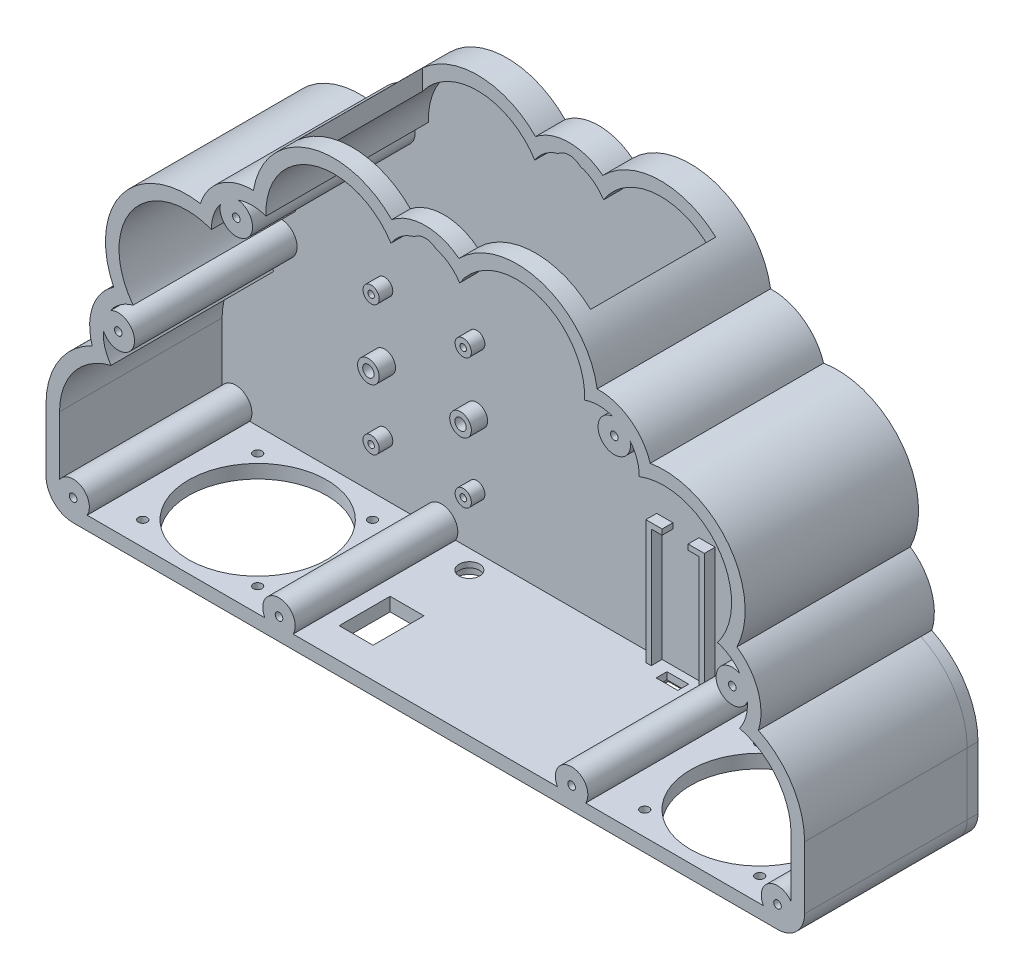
ISO-10303-21;
HEADER;
FILE_DESCRIPTION(('STEP AP214'),'2;1');
FILE_NAME('part.step','',(''),(''),'','','');
FILE_SCHEMA(('AUTOMOTIVE_DESIGN { 1 0 10303 214 1 1 1 1 }'));
ENDSEC;
DATA;
#1=APPLICATION_CONTEXT('core data for automotive mechanical design processes');
#2=APPLICATION_PROTOCOL_DEFINITION('international standard','automotive_design',2000,#1);
#3=PRODUCT_CONTEXT('',#1,'mechanical');
#4=PRODUCT('Part','Part','',(#3));
#5=PRODUCT_RELATED_PRODUCT_CATEGORY('part','',(#4));
#6=PRODUCT_DEFINITION_FORMATION('','',#4);
#7=PRODUCT_DEFINITION_CONTEXT('part definition',#1,'design');
#8=PRODUCT_DEFINITION('design','',#6,#7);
#9=PRODUCT_DEFINITION_SHAPE('','',#8);
#10=(LENGTH_UNIT() NAMED_UNIT(*) SI_UNIT(.MILLI.,.METRE.));
#11=(NAMED_UNIT(*) PLANE_ANGLE_UNIT() SI_UNIT($,.RADIAN.));
#12=(NAMED_UNIT(*) SI_UNIT($,.STERADIAN.) SOLID_ANGLE_UNIT());
#13=UNCERTAINTY_MEASURE_WITH_UNIT(LENGTH_MEASURE(1.E-05),#10,'distance_accuracy_value','');
#14=(GEOMETRIC_REPRESENTATION_CONTEXT(3) GLOBAL_UNCERTAINTY_ASSIGNED_CONTEXT((#13)) GLOBAL_UNIT_ASSIGNED_CONTEXT((#10,
#11,#12)) REPRESENTATION_CONTEXT('',''));
#15=CARTESIAN_POINT('',(0.,0.,0.));
#16=DIRECTION('',(0.,0.,1.));
#17=DIRECTION('',(1.,0.,0.));
#18=AXIS2_PLACEMENT_3D('',#15,#16,#17);
#19=CARTESIAN_POINT('',(140.,-52.,5.));
#20=DIRECTION('',(-1.,0.,0.));
#21=DIRECTION('',(0.,-1.,0.));
#22=AXIS2_PLACEMENT_3D('',#19,#20,#21);
#23=PLANE('',#22);
#24=DIRECTION('',(0.,-1.,0.));
#25=VECTOR('',#24,1.);
#26=CARTESIAN_POINT('',(140.,-52.,1.));
#27=LINE('',#26,#25);
#28=CARTESIAN_POINT('',(140.,-52.,1.));
#29=VERTEX_POINT('',#28);
#30=CARTESIAN_POINT('',(140.,-75.,1.));
#31=VERTEX_POINT('',#30);
#32=EDGE_CURVE('E315',#29,#31,#27,.T.);
#33=ORIENTED_EDGE('',*,*,#32,.F.);
#34=DIRECTION('',(0.,0.,-1.));
#35=VECTOR('',#34,1.);
#36=CARTESIAN_POINT('',(140.,-52.,5.));
#37=LINE('',#36,#35);
#38=CARTESIAN_POINT('',(139.999541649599,-52.,5.));
#39=VERTEX_POINT('',#38);
#40=EDGE_CURVE('E887',#39,#29,#37,.T.);
#41=ORIENTED_EDGE('',*,*,#40,.F.);
#42=CARTESIAN_POINT('',(139.999083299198,-75.,5.));
#43=DIRECTION('',(0.,1.,0.));
#44=VECTOR('',#43,1.);
#45=LINE('',#42,#44);
#46=CARTESIAN_POINT('',(139.999541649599,-75.,5.));
#47=VERTEX_POINT('',#46);
#48=EDGE_CURVE('E894',#47,#39,#45,.T.);
#49=ORIENTED_EDGE('',*,*,#48,.F.);
#50=DIRECTION('',(0.,0.,-1.));
#51=VECTOR('',#50,1.);
#52=CARTESIAN_POINT('',(140.,-75.,5.));
#53=LINE('',#52,#51);
#54=EDGE_CURVE('E885',#47,#31,#53,.T.);
#55=ORIENTED_EDGE('',*,*,#54,.T.);
#56=EDGE_LOOP('',(#33,#41,#49,#55));
#57=FACE_BOUND('',#56,.T.);
#58=ADVANCED_FACE('F297',(#57),#23,.F.);
#59=CARTESIAN_POINT('',(109.959083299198,-52.,5.));
#60=DIRECTION('',(0.,0.,-1.));
#61=DIRECTION('',(-1.,0.,0.));
#62=AXIS2_PLACEMENT_3D('',#59,#60,#61);
#63=CYLINDRICAL_SURFACE('',#62,30.0409167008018);
#64=CARTESIAN_POINT('',(109.959083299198,-52.,1.));
#65=DIRECTION('',(0.,0.,-1.));
#66=DIRECTION('',(-1.,0.,0.));
#67=AXIS2_PLACEMENT_3D('',#64,#65,#66);
#68=CIRCLE('',#67,30.0409167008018);
#69=CARTESIAN_POINT('',(122.94048262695,-24.9086739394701,1.));
#70=VERTEX_POINT('',#69);
#71=EDGE_CURVE('E2165',#70,#29,#68,.T.);
#72=ORIENTED_EDGE('',*,*,#71,.F.);
#73=DIRECTION('',(0.,0.,-1.));
#74=VECTOR('',#73,1.);
#75=CARTESIAN_POINT('',(122.94048262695,-24.9086739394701,5.));
#76=LINE('',#75,#74);
#77=CARTESIAN_POINT('',(122.940342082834,-24.9091148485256,5.));
#78=VERTEX_POINT('',#77);
#79=EDGE_CURVE('E929',#78,#70,#76,.T.);
#80=ORIENTED_EDGE('',*,*,#79,.F.);
#81=CARTESIAN_POINT('',(109.959083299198,-52.,5.));
#82=DIRECTION('',(0.,0.,1.));
#83=DIRECTION('',(1.,0.,0.));
#84=AXIS2_PLACEMENT_3D('',#81,#82,#83);
#85=CIRCLE('',#84,30.04);
#86=EDGE_CURVE('E939',#39,#78,#85,.T.);
#87=ORIENTED_EDGE('',*,*,#86,.F.);
#88=ORIENTED_EDGE('',*,*,#40,.T.);
#89=EDGE_LOOP('',(#72,#80,#87,#88));
#90=FACE_BOUND('',#89,.T.);
#91=ADVANCED_FACE('F914',(#90),#63,.T.);
#92=CARTESIAN_POINT('',(103.885011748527,-18.8350399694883,5.));
#93=DIRECTION('',(0.,0.,-1.));
#94=DIRECTION('',(-1.,0.,0.));
#95=AXIS2_PLACEMENT_3D('',#92,#93,#94);
#96=CYLINDRICAL_SURFACE('',#95,19.9999999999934);
#97=CARTESIAN_POINT('',(103.885011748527,-18.8350399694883,1.));
#98=DIRECTION('',(0.,0.,-1.));
#99=DIRECTION('',(-1.,0.,0.));
#100=AXIS2_PLACEMENT_3D('',#97,#98,#99);
#101=CIRCLE('',#100,19.9999999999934);
#102=CARTESIAN_POINT('',(115.01505389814,-2.21811601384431,1.));
#103=VERTEX_POINT('',#102);
#104=EDGE_CURVE('E2580',#103,#70,#101,.T.);
#105=ORIENTED_EDGE('',*,*,#104,.F.);
#106=DIRECTION('',(0.,0.,-1.));
#107=VECTOR('',#106,1.);
#108=CARTESIAN_POINT('',(115.015053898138,-2.21811601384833,5.));
#109=LINE('',#108,#107);
#110=CARTESIAN_POINT('',(115.015053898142,-2.21811601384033,65.));
#111=VERTEX_POINT('',#110);
#112=EDGE_CURVE('E903',#111,#103,#109,.T.);
#113=ORIENTED_EDGE('',*,*,#112,.F.);
#114=CARTESIAN_POINT('',(103.885011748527,-18.8350399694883,65.));
#115=DIRECTION('',(0.,0.,1.));
#116=DIRECTION('',(1.,0.,0.));
#117=AXIS2_PLACEMENT_3D('',#114,#115,#116);
#118=CIRCLE('',#117,20.);
#119=CARTESIAN_POINT('',(122.940201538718,-24.9095557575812,65.));
#120=VERTEX_POINT('',#119);
#121=EDGE_CURVE('E1198',#120,#111,#118,.T.);
#122=ORIENTED_EDGE('',*,*,#121,.F.);
#123=DIRECTION('',(0.,0.,-1.));
#124=VECTOR('',#123,1.);
#125=CARTESIAN_POINT('',(122.940201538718,-24.9095557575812,65.));
#126=LINE('',#125,#124);
#127=EDGE_CURVE('E949',#120,#78,#126,.T.);
#128=ORIENTED_EDGE('',*,*,#127,.T.);
#129=ORIENTED_EDGE('',*,*,#79,.T.);
#130=EDGE_LOOP('',(#105,#113,#122,#128,#129));
#131=FACE_BOUND('',#130,.T.);
#132=ADVANCED_FACE('F921',(#131),#96,.T.);
#133=CARTESIAN_POINT('',(88.0508238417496,10.9321804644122,5.));
#134=DIRECTION('',(0.,0.,-1.));
#135=DIRECTION('',(-1.,0.,0.));
#136=AXIS2_PLACEMENT_3D('',#133,#134,#135);
#137=CYLINDRICAL_SURFACE('',#136,29.9999999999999);
#138=CARTESIAN_POINT('',(88.0508238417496,10.9321804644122,1.));
#139=DIRECTION('',(0.,0.,-1.));
#140=DIRECTION('',(-1.,0.,0.));
#141=AXIS2_PLACEMENT_3D('',#138,#139,#140);
#142=CIRCLE('',#141,29.9999999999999);
#143=CARTESIAN_POINT('',(83.0220908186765,40.5077082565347,1.));
#144=VERTEX_POINT('',#143);
#145=EDGE_CURVE('E2584',#144,#103,#142,.T.);
#146=ORIENTED_EDGE('',*,*,#145,.F.);
#147=DIRECTION('',(0.,0.,-1.));
#148=VECTOR('',#147,1.);
#149=CARTESIAN_POINT('',(83.0220908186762,40.5077082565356,5.));
#150=LINE('',#149,#148);
#151=CARTESIAN_POINT('',(83.0220908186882,40.5077082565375,65.));
#152=VERTEX_POINT('',#151);
#153=EDGE_CURVE('E1342',#152,#144,#150,.T.);
#154=ORIENTED_EDGE('',*,*,#153,.F.);
#155=CARTESIAN_POINT('',(88.0508238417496,10.9321804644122,65.));
#156=DIRECTION('',(0.,0.,1.));
#157=DIRECTION('',(1.,0.,0.));
#158=AXIS2_PLACEMENT_3D('',#155,#156,#157);
#159=CIRCLE('',#158,30.);
#160=EDGE_CURVE('E1201',#111,#152,#159,.T.);
#161=ORIENTED_EDGE('',*,*,#160,.F.);
#162=ORIENTED_EDGE('',*,*,#112,.T.);
#163=EDGE_LOOP('',(#146,#154,#161,#162));
#164=FACE_BOUND('',#163,.T.);
#165=ADVANCED_FACE('F2544',(#164),#137,.T.);
#166=CARTESIAN_POINT('',(63.9441597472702,34.5049966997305,5.));
#167=DIRECTION('',(0.,0.,-1.));
#168=DIRECTION('',(-1.,0.,0.));
#169=AXIS2_PLACEMENT_3D('',#166,#167,#168);
#170=CYLINDRICAL_SURFACE('',#169,19.999999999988);
#171=CARTESIAN_POINT('',(63.9441597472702,34.5049966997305,1.));
#172=DIRECTION('',(0.,0.,-1.));
#173=DIRECTION('',(-1.,0.,0.));
#174=AXIS2_PLACEMENT_3D('',#171,#172,#173);
#175=CIRCLE('',#174,19.999999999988);
#176=CARTESIAN_POINT('',(63.4385186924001,54.498603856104,1.));
#177=VERTEX_POINT('',#176);
#178=EDGE_CURVE('E2634',#177,#144,#175,.T.);
#179=ORIENTED_EDGE('',*,*,#178,.F.);
#180=DIRECTION('',(0.,0.,-1.));
#181=VECTOR('',#180,1.);
#182=CARTESIAN_POINT('',(63.4385186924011,54.498603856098,5.));
#183=LINE('',#182,#181);
#184=CARTESIAN_POINT('',(63.4385186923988,54.49860385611,65.));
#185=VERTEX_POINT('',#184);
#186=EDGE_CURVE('E1350',#185,#177,#183,.T.);
#187=ORIENTED_EDGE('',*,*,#186,.F.);
#188=CARTESIAN_POINT('',(63.9441597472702,34.5049966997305,65.));
#189=DIRECTION('',(0.,0.,1.));
#190=DIRECTION('',(1.,0.,0.));
#191=AXIS2_PLACEMENT_3D('',#188,#189,#190);
#192=CIRCLE('',#191,20.);
#193=EDGE_CURVE('E1204',#152,#185,#192,.T.);
#194=ORIENTED_EDGE('',*,*,#193,.F.);
#195=ORIENTED_EDGE('',*,*,#153,.T.);
#196=EDGE_LOOP('',(#179,#187,#194,#195));
#197=FACE_BOUND('',#196,.T.);
#198=ADVANCED_FACE('F2533',(#197),#170,.T.);
#199=CARTESIAN_POINT('',(33.8298682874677,49.6687155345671,5.));
#200=DIRECTION('',(0.,0.,-1.));
#201=DIRECTION('',(-1.,0.,0.));
#202=AXIS2_PLACEMENT_3D('',#199,#200,#201);
#203=CYLINDRICAL_SURFACE('',#202,30.0000000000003);
#204=CARTESIAN_POINT('',(33.8298682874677,49.6687155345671,1.));
#205=DIRECTION('',(0.,0.,-1.));
#206=DIRECTION('',(-1.,0.,0.));
#207=AXIS2_PLACEMENT_3D('',#204,#205,#206);
#208=CIRCLE('',#207,30.0000000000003);
#209=CARTESIAN_POINT('',(12.4160231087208,70.6793612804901,1.));
#210=VERTEX_POINT('',#209);
#211=EDGE_CURVE('E2632',#210,#177,#208,.T.);
#212=ORIENTED_EDGE('',*,*,#211,.F.);
#213=DIRECTION('',(0.,0.,-1.));
#214=VECTOR('',#213,1.);
#215=CARTESIAN_POINT('',(12.4160231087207,70.6793612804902,5.));
#216=LINE('',#215,#214);
#217=CARTESIAN_POINT('',(12.4160231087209,70.6793612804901,11.9));
#218=VERTEX_POINT('',#217);
#219=EDGE_CURVE('E1374',#218,#210,#216,.T.);
#220=ORIENTED_EDGE('',*,*,#219,.F.);
#221=CARTESIAN_POINT('',(33.8298682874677,49.6687155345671,11.9));
#222=DIRECTION('',(0.,0.,-1.));
#223=DIRECTION('',(-1.,0.,0.));
#224=AXIS2_PLACEMENT_3D('',#221,#222,#223);
#225=CIRCLE('',#224,30.0000000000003);
#226=CARTESIAN_POINT('',(54.1,71.7848128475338,11.9));
#227=VERTEX_POINT('',#226);
#228=EDGE_CURVE('E1368',#218,#227,#225,.T.);
#229=ORIENTED_EDGE('',*,*,#228,.T.);
#230=DIRECTION('',(0.,0.,-1.));
#231=VECTOR('',#230,1.);
#232=CARTESIAN_POINT('',(54.1,71.7848128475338,5.00000000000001));
#233=LINE('',#232,#231);
#234=CARTESIAN_POINT('',(54.1,71.7848128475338,58.1));
#235=VERTEX_POINT('',#234);
#236=EDGE_CURVE('E1338',#227,#235,#233,.F.);
#237=ORIENTED_EDGE('',*,*,#236,.T.);
#238=CARTESIAN_POINT('',(33.8298682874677,49.6687155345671,58.1));
#239=DIRECTION('',(0.,0.,1.));
#240=DIRECTION('',(1.,0.,0.));
#241=AXIS2_PLACEMENT_3D('',#238,#239,#240);
#242=CIRCLE('',#241,30.0000000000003);
#243=CARTESIAN_POINT('',(12.4160231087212,70.6793612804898,58.1));
#244=VERTEX_POINT('',#243);
#245=EDGE_CURVE('E1341',#235,#244,#242,.T.);
#246=ORIENTED_EDGE('',*,*,#245,.T.);
#247=CARTESIAN_POINT('',(12.4160231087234,70.6793612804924,65.));
#248=VERTEX_POINT('',#247);
#249=EDGE_CURVE('E1178',#248,#244,#216,.T.);
#250=ORIENTED_EDGE('',*,*,#249,.F.);
#251=CARTESIAN_POINT('',(33.8298682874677,49.6687155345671,65.));
#252=DIRECTION('',(0.,0.,1.));
#253=DIRECTION('',(1.,0.,0.));
#254=AXIS2_PLACEMENT_3D('',#251,#252,#253);
#255=CIRCLE('',#254,30.);
#256=EDGE_CURVE('E1207',#185,#248,#255,.T.);
#257=ORIENTED_EDGE('',*,*,#256,.F.);
#258=ORIENTED_EDGE('',*,*,#186,.T.);
#259=EDGE_LOOP('',(#212,#220,#229,#237,#246,#250,#257,#258));
#260=FACE_BOUND('',#259,.T.);
#261=ADVANCED_FACE('F2521',(#260),#203,.T.);
#262=CARTESIAN_POINT('',(-9.11148633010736E-13,55.0000000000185,5.));
#263=DIRECTION('',(0.,0.,-1.));
#264=DIRECTION('',(-1.,0.,0.));
#265=AXIS2_PLACEMENT_3D('',#262,#263,#264);
#266=CYLINDRICAL_SURFACE('',#265,19.9999999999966);
#267=CARTESIAN_POINT('',(-9.11148633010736E-13,55.0000000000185,1.));
#268=DIRECTION('',(0.,0.,-1.));
#269=DIRECTION('',(-1.,0.,0.));
#270=AXIS2_PLACEMENT_3D('',#267,#268,#269);
#271=CIRCLE('',#270,19.9999999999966);
#272=CARTESIAN_POINT('',(-12.4160231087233,70.6793612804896,1.));
#273=VERTEX_POINT('',#272);
#274=EDGE_CURVE('E2626',#273,#210,#271,.T.);
#275=ORIENTED_EDGE('',*,*,#274,.F.);
#276=DIRECTION('',(0.,0.,-1.));
#277=VECTOR('',#276,1.);
#278=CARTESIAN_POINT('',(-12.4160231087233,70.6793612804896,5.));
#279=LINE('',#278,#277);
#280=CARTESIAN_POINT('',(-12.4160231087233,70.6793612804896,11.9));
#281=VERTEX_POINT('',#280);
#282=EDGE_CURVE('E1377',#281,#273,#279,.T.);
#283=ORIENTED_EDGE('',*,*,#282,.F.);
#284=CARTESIAN_POINT('',(-9.11148633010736E-13,55.0000000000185,11.9));
#285=DIRECTION('',(0.,0.,-1.));
#286=DIRECTION('',(-1.,0.,0.));
#287=AXIS2_PLACEMENT_3D('',#284,#285,#286);
#288=CIRCLE('',#287,19.9999999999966);
#289=EDGE_CURVE('E1371',#281,#218,#288,.T.);
#290=ORIENTED_EDGE('',*,*,#289,.T.);
#291=ORIENTED_EDGE('',*,*,#219,.T.);
#292=EDGE_LOOP('',(#275,#283,#290,#291));
#293=FACE_BOUND('',#292,.T.);
#294=ADVANCED_FACE('F2510',(#293),#266,.T.);
#295=CARTESIAN_POINT('',(-33.8298682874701,49.6687155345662,5.));
#296=DIRECTION('',(0.,0.,-1.));
#297=DIRECTION('',(-1.,0.,0.));
#298=AXIS2_PLACEMENT_3D('',#295,#296,#297);
#299=CYLINDRICAL_SURFACE('',#298,30.0000000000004);
#300=CARTESIAN_POINT('',(-33.8298682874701,49.6687155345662,1.));
#301=DIRECTION('',(0.,0.,-1.));
#302=DIRECTION('',(-1.,0.,0.));
#303=AXIS2_PLACEMENT_3D('',#300,#301,#302);
#304=CIRCLE('',#303,30.0000000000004);
#305=CARTESIAN_POINT('',(-63.4385186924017,54.498603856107,1.));
#306=VERTEX_POINT('',#305);
#307=EDGE_CURVE('E2624',#306,#273,#304,.T.);
#308=ORIENTED_EDGE('',*,*,#307,.F.);
#309=DIRECTION('',(0.,0.,-1.));
#310=VECTOR('',#309,1.);
#311=CARTESIAN_POINT('',(-63.4385186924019,54.498603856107,5.));
#312=LINE('',#311,#310);
#313=CARTESIAN_POINT('',(-63.4385186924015,54.498603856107,65.));
#314=VERTEX_POINT('',#313);
#315=EDGE_CURVE('E2596',#314,#306,#312,.T.);
#316=ORIENTED_EDGE('',*,*,#315,.F.);
#317=CARTESIAN_POINT('',(-33.8298682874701,49.6687155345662,65.));
#318=DIRECTION('',(0.,0.,1.));
#319=DIRECTION('',(1.,0.,0.));
#320=AXIS2_PLACEMENT_3D('',#317,#318,#319);
#321=CIRCLE('',#320,30.);
#322=CARTESIAN_POINT('',(-12.416023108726,70.6793612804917,65.));
#323=VERTEX_POINT('',#322);
#324=EDGE_CURVE('E1213',#323,#314,#321,.T.);
#325=ORIENTED_EDGE('',*,*,#324,.F.);
#326=CARTESIAN_POINT('',(-12.4160231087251,70.6793612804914,58.1));
#327=VERTEX_POINT('',#326);
#328=EDGE_CURVE('E1357',#323,#327,#279,.T.);
#329=ORIENTED_EDGE('',*,*,#328,.T.);
#330=CARTESIAN_POINT('',(-33.8298682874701,49.6687155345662,58.1));
#331=DIRECTION('',(0.,0.,1.));
#332=DIRECTION('',(1.,0.,0.));
#333=AXIS2_PLACEMENT_3D('',#330,#331,#332);
#334=CIRCLE('',#333,30.0000000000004);
#335=CARTESIAN_POINT('',(-54.1,71.7848128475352,58.1));
#336=VERTEX_POINT('',#335);
#337=EDGE_CURVE('E1347',#327,#336,#334,.T.);
#338=ORIENTED_EDGE('',*,*,#337,.T.);
#339=DIRECTION('',(0.,0.,-1.));
#340=VECTOR('',#339,1.);
#341=CARTESIAN_POINT('',(-54.1,71.7848128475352,5.));
#342=LINE('',#341,#340);
#343=CARTESIAN_POINT('',(-54.1,71.7848128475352,11.9));
#344=VERTEX_POINT('',#343);
#345=EDGE_CURVE('E1343',#336,#344,#342,.T.);
#346=ORIENTED_EDGE('',*,*,#345,.T.);
#347=CARTESIAN_POINT('',(-33.8298682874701,49.6687155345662,11.9));
#348=DIRECTION('',(0.,0.,-1.));
#349=DIRECTION('',(-1.,0.,0.));
#350=AXIS2_PLACEMENT_3D('',#347,#348,#349);
#351=CIRCLE('',#350,30.0000000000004);
#352=EDGE_CURVE('E1346',#344,#281,#351,.T.);
#353=ORIENTED_EDGE('',*,*,#352,.T.);
#354=ORIENTED_EDGE('',*,*,#282,.T.);
#355=EDGE_LOOP('',(#308,#316,#325,#329,#338,#346,#353,#354));
#356=FACE_BOUND('',#355,.T.);
#357=ADVANCED_FACE('F2499',(#356),#299,.T.);
#358=CARTESIAN_POINT('',(-63.9441597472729,34.5049966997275,5.));
#359=DIRECTION('',(0.,0.,-1.));
#360=DIRECTION('',(-1.,0.,0.));
#361=AXIS2_PLACEMENT_3D('',#358,#359,#360);
#362=CYLINDRICAL_SURFACE('',#361,20.);
#363=CARTESIAN_POINT('',(-63.9441597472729,34.5049966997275,1.));
#364=DIRECTION('',(0.,0.,-1.));
#365=DIRECTION('',(-1.,0.,0.));
#366=AXIS2_PLACEMENT_3D('',#363,#364,#365);
#367=CIRCLE('',#366,20.);
#368=CARTESIAN_POINT('',(-83.0220908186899,40.5077082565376,1.));
#369=VERTEX_POINT('',#368);
#370=EDGE_CURVE('E2622',#369,#306,#367,.T.);
#371=ORIENTED_EDGE('',*,*,#370,.F.);
#372=DIRECTION('',(0.,0.,-1.));
#373=VECTOR('',#372,1.);
#374=CARTESIAN_POINT('',(-83.0220908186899,40.5077082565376,5.));
#375=LINE('',#374,#373);
#376=CARTESIAN_POINT('',(-83.02209081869,40.5077082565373,65.));
#377=VERTEX_POINT('',#376);
#378=EDGE_CURVE('E2599',#377,#369,#375,.T.);
#379=ORIENTED_EDGE('',*,*,#378,.F.);
#380=CARTESIAN_POINT('',(-63.9441597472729,34.5049966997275,65.));
#381=DIRECTION('',(0.,0.,1.));
#382=DIRECTION('',(1.,0.,0.));
#383=AXIS2_PLACEMENT_3D('',#380,#381,#382);
#384=CIRCLE('',#383,20.);
#385=EDGE_CURVE('E1216',#314,#377,#384,.T.);
#386=ORIENTED_EDGE('',*,*,#385,.F.);
#387=ORIENTED_EDGE('',*,*,#315,.T.);
#388=EDGE_LOOP('',(#371,#379,#386,#387));
#389=FACE_BOUND('',#388,.T.);
#390=ADVANCED_FACE('F2488',(#389),#362,.T.);
#391=CARTESIAN_POINT('',(-88.0508238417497,10.9321804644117,5.));
#392=DIRECTION('',(0.,0.,-1.));
#393=DIRECTION('',(-1.,0.,0.));
#394=AXIS2_PLACEMENT_3D('',#391,#392,#393);
#395=CYLINDRICAL_SURFACE('',#394,30.0000000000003);
#396=CARTESIAN_POINT('',(-88.0508238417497,10.9321804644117,1.));
#397=DIRECTION('',(0.,0.,-1.));
#398=DIRECTION('',(-1.,0.,0.));
#399=AXIS2_PLACEMENT_3D('',#396,#397,#398);
#400=CIRCLE('',#399,30.0000000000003);
#401=CARTESIAN_POINT('',(-115.015053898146,-2.21811601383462,1.));
#402=VERTEX_POINT('',#401);
#403=EDGE_CURVE('E2618',#402,#369,#400,.T.);
#404=ORIENTED_EDGE('',*,*,#403,.F.);
#405=DIRECTION('',(0.,0.,-1.));
#406=VECTOR('',#405,1.);
#407=CARTESIAN_POINT('',(-115.015053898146,-2.21811601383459,5.));
#408=LINE('',#407,#406);
#409=CARTESIAN_POINT('',(-115.015053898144,-2.21811601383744,65.));
#410=VERTEX_POINT('',#409);
#411=EDGE_CURVE('E1059',#410,#402,#408,.T.);
#412=ORIENTED_EDGE('',*,*,#411,.F.);
#413=CARTESIAN_POINT('',(-88.0508238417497,10.9321804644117,65.));
#414=DIRECTION('',(0.,0.,1.));
#415=DIRECTION('',(1.,0.,0.));
#416=AXIS2_PLACEMENT_3D('',#413,#414,#415);
#417=CIRCLE('',#416,30.);
#418=EDGE_CURVE('E1219',#377,#410,#417,.T.);
#419=ORIENTED_EDGE('',*,*,#418,.F.);
#420=ORIENTED_EDGE('',*,*,#378,.T.);
#421=EDGE_LOOP('',(#404,#412,#419,#420));
#422=FACE_BOUND('',#421,.T.);
#423=ADVANCED_FACE('F2479',(#422),#395,.T.);
#424=CARTESIAN_POINT('',(-103.885011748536,-18.8350399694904,5.));
#425=DIRECTION('',(0.,0.,-1.));
#426=DIRECTION('',(-1.,0.,0.));
#427=AXIS2_PLACEMENT_3D('',#424,#425,#426);
#428=CYLINDRICAL_SURFACE('',#427,20.0000000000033);
#429=CARTESIAN_POINT('',(-103.885011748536,-18.8350399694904,1.));
#430=DIRECTION('',(0.,0.,-1.));
#431=DIRECTION('',(-1.,0.,0.));
#432=AXIS2_PLACEMENT_3D('',#429,#430,#431);
#433=CIRCLE('',#432,20.0000000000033);
#434=CARTESIAN_POINT('',(-122.940482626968,-24.908673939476,1.));
#435=VERTEX_POINT('',#434);
#436=EDGE_CURVE('E2615',#435,#402,#433,.T.);
#437=ORIENTED_EDGE('',*,*,#436,.F.);
#438=DIRECTION('',(0.,0.,-1.));
#439=VECTOR('',#438,1.);
#440=CARTESIAN_POINT('',(-122.940482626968,-24.908673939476,5.));
#441=LINE('',#440,#439);
#442=CARTESIAN_POINT('',(-122.940342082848,-24.9091148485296,5.));
#443=VERTEX_POINT('',#442);
#444=EDGE_CURVE('E1056',#443,#435,#441,.T.);
#445=ORIENTED_EDGE('',*,*,#444,.F.);
#446=DIRECTION('',(0.,0.,-1.));
#447=VECTOR('',#446,1.);
#448=CARTESIAN_POINT('',(-122.940201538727,-24.9095557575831,65.));
#449=LINE('',#448,#447);
#450=CARTESIAN_POINT('',(-122.940201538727,-24.9095557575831,65.));
#451=VERTEX_POINT('',#450);
#452=EDGE_CURVE('E1009',#451,#443,#449,.T.);
#453=ORIENTED_EDGE('',*,*,#452,.F.);
#454=CARTESIAN_POINT('',(-103.885011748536,-18.8350399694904,65.));
#455=DIRECTION('',(0.,0.,1.));
#456=DIRECTION('',(1.,0.,0.));
#457=AXIS2_PLACEMENT_3D('',#454,#455,#456);
#458=CIRCLE('',#457,20.);
#459=EDGE_CURVE('E1222',#410,#451,#458,.T.);
#460=ORIENTED_EDGE('',*,*,#459,.F.);
#461=ORIENTED_EDGE('',*,*,#411,.T.);
#462=EDGE_LOOP('',(#437,#445,#453,#460,#461));
#463=FACE_BOUND('',#462,.T.);
#464=ADVANCED_FACE('F2470',(#463),#428,.T.);
#465=CARTESIAN_POINT('',(-109.959083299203,-51.9999999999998,5.));
#466=DIRECTION('',(0.,0.,-1.));
#467=DIRECTION('',(-1.,0.,0.));
#468=AXIS2_PLACEMENT_3D('',#465,#466,#467);
#469=CYLINDRICAL_SURFACE('',#468,30.0409167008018);
#470=CARTESIAN_POINT('',(-109.959083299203,-51.9999999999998,1.));
#471=DIRECTION('',(0.,0.,-1.));
#472=DIRECTION('',(-1.,0.,0.));
#473=AXIS2_PLACEMENT_3D('',#470,#471,#472);
#474=CIRCLE('',#473,30.0409167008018);
#475=CARTESIAN_POINT('',(-140.000000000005,-52.,1.));
#476=VERTEX_POINT('',#475);
#477=EDGE_CURVE('E3677',#476,#435,#474,.T.);
#478=ORIENTED_EDGE('',*,*,#477,.F.);
#479=DIRECTION('',(0.,0.,-1.));
#480=VECTOR('',#479,1.);
#481=CARTESIAN_POINT('',(-140.000000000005,-52.,5.));
#482=LINE('',#481,#480);
#483=CARTESIAN_POINT('',(-139.999541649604,-51.9999999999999,5.));
#484=VERTEX_POINT('',#483);
#485=EDGE_CURVE('E868',#484,#476,#482,.T.);
#486=ORIENTED_EDGE('',*,*,#485,.F.);
#487=CARTESIAN_POINT('',(-109.959083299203,-51.9999999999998,5.));
#488=DIRECTION('',(0.,0.,1.));
#489=DIRECTION('',(-0.432127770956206,0.901812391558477,0.));
#490=AXIS2_PLACEMENT_3D('',#487,#488,#489);
#491=CIRCLE('',#490,30.04);
#492=EDGE_CURVE('E1004',#443,#484,#491,.T.);
#493=ORIENTED_EDGE('',*,*,#492,.F.);
#494=ORIENTED_EDGE('',*,*,#444,.T.);
#495=EDGE_LOOP('',(#478,#486,#493,#494));
#496=FACE_BOUND('',#495,.T.);
#497=ADVANCED_FACE('F1032',(#496),#469,.T.);
#498=CARTESIAN_POINT('',(-140.000000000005,-52.,5.));
#499=DIRECTION('',(1.,0.,0.));
#500=DIRECTION('',(0.,0.,-1.));
#501=AXIS2_PLACEMENT_3D('',#498,#499,#500);
#502=PLANE('',#501);
#503=DIRECTION('',(0.,1.,0.));
#504=VECTOR('',#503,1.);
#505=CARTESIAN_POINT('',(-140.000000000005,-52.,1.));
#506=LINE('',#505,#504);
#507=CARTESIAN_POINT('',(-140.000000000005,-75.,1.));
#508=VERTEX_POINT('',#507);
#509=EDGE_CURVE('E3679',#508,#476,#506,.T.);
#510=ORIENTED_EDGE('',*,*,#509,.F.);
#511=DIRECTION('',(0.,0.,-1.));
#512=VECTOR('',#511,1.);
#513=CARTESIAN_POINT('',(-140.000000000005,-75.,5.));
#514=LINE('',#513,#512);
#515=CARTESIAN_POINT('',(-139.999541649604,-75.,5.));
#516=VERTEX_POINT('',#515);
#517=EDGE_CURVE('E301',#508,#516,#514,.F.);
#518=ORIENTED_EDGE('',*,*,#517,.T.);
#519=CARTESIAN_POINT('',(-139.999083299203,-51.9999999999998,5.));
#520=DIRECTION('',(0.,-1.,0.));
#521=VECTOR('',#520,1.);
#522=LINE('',#519,#521);
#523=EDGE_CURVE('E1051',#484,#516,#522,.T.);
#524=ORIENTED_EDGE('',*,*,#523,.F.);
#525=ORIENTED_EDGE('',*,*,#485,.T.);
#526=EDGE_LOOP('',(#510,#518,#524,#525));
#527=FACE_BOUND('',#526,.T.);
#528=ADVANCED_FACE('F1027',(#527),#502,.F.);
#529=CARTESIAN_POINT('',(-140.000000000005,-85.,5.));
#530=DIRECTION('',(0.,1.,0.));
#531=DIRECTION('',(0.,0.,1.));
#532=AXIS2_PLACEMENT_3D('',#529,#530,#531);
#533=PLANE('',#532);
#534=CARTESIAN_POINT('',(-70.6574258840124,-85.,56.2132034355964));
#535=DIRECTION('',(0.,-1.,0.));
#536=DIRECTION('',(0.,0.,-1.));
#537=AXIS2_PLACEMENT_3D('',#534,#535,#536);
#538=CIRCLE('',#537,1.60000000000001);
#539=CARTESIAN_POINT('',(-70.6574258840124,-85.,54.6132034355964));
#540=VERTEX_POINT('',#539);
#541=EDGE_CURVE('E1683',#540,#540,#538,.T.);
#542=ORIENTED_EDGE('',*,*,#541,.F.);
#543=EDGE_LOOP('',(#542));
#544=FACE_BOUND('',#543,.T.);
#545=CARTESIAN_POINT('',(72.2008598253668,-85.,13.7867965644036));
#546=DIRECTION('',(0.,-1.,0.));
#547=DIRECTION('',(0.,0.,-1.));
#548=AXIS2_PLACEMENT_3D('',#545,#546,#547);
#549=CIRCLE('',#548,1.6);
#550=CARTESIAN_POINT('',(72.2008598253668,-85.,12.1867965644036));
#551=VERTEX_POINT('',#550);
#552=EDGE_CURVE('E1670',#551,#551,#549,.T.);
#553=ORIENTED_EDGE('',*,*,#552,.F.);
#554=EDGE_LOOP('',(#553));
#555=FACE_BOUND('',#554,.T.);
#556=CARTESIAN_POINT('',(114.62726669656,-85.,13.7867965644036));
#557=DIRECTION('',(0.,-1.,0.));
#558=DIRECTION('',(0.,0.,-1.));
#559=AXIS2_PLACEMENT_3D('',#556,#557,#558);
#560=CIRCLE('',#559,1.6);
#561=CARTESIAN_POINT('',(114.62726669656,-85.,12.1867965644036));
#562=VERTEX_POINT('',#561);
#563=EDGE_CURVE('E1675',#562,#562,#560,.T.);
#564=ORIENTED_EDGE('',*,*,#563,.F.);
#565=EDGE_LOOP('',(#564));
#566=FACE_BOUND('',#565,.T.);
#567=CARTESIAN_POINT('',(114.62726669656,-85.,56.2132034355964));
#568=DIRECTION('',(0.,-1.,0.));
#569=DIRECTION('',(0.,0.,-1.));
#570=AXIS2_PLACEMENT_3D('',#567,#568,#569);
#571=CIRCLE('',#570,1.60000000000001);
#572=CARTESIAN_POINT('',(114.62726669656,-85.,54.6132034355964));
#573=VERTEX_POINT('',#572);
#574=EDGE_CURVE('E1671',#573,#573,#571,.T.);
#575=ORIENTED_EDGE('',*,*,#574,.F.);
#576=EDGE_LOOP('',(#575));
#577=FACE_BOUND('',#576,.T.);
#578=CARTESIAN_POINT('',(72.2008598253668,-85.,56.2132034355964));
#579=DIRECTION('',(0.,-1.,0.));
#580=DIRECTION('',(0.,0.,-1.));
#581=AXIS2_PLACEMENT_3D('',#578,#579,#580);
#582=CIRCLE('',#581,1.60000000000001);
#583=CARTESIAN_POINT('',(72.2008598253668,-85.,54.6132034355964));
#584=VERTEX_POINT('',#583);
#585=EDGE_CURVE('E1674',#584,#584,#582,.T.);
#586=ORIENTED_EDGE('',*,*,#585,.F.);
#587=EDGE_LOOP('',(#586));
#588=FACE_BOUND('',#587,.T.);
#589=CARTESIAN_POINT('',(-113.083832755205,-85.,56.2132034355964));
#590=DIRECTION('',(0.,-1.,0.));
#591=DIRECTION('',(0.,0.,-1.));
#592=AXIS2_PLACEMENT_3D('',#589,#590,#591);
#593=CIRCLE('',#592,1.60000000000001);
#594=CARTESIAN_POINT('',(-113.083832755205,-85.,54.6132034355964));
#595=VERTEX_POINT('',#594);
#596=EDGE_CURVE('E1687',#595,#595,#593,.T.);
#597=ORIENTED_EDGE('',*,*,#596,.F.);
#598=EDGE_LOOP('',(#597));
#599=FACE_BOUND('',#598,.T.);
#600=CARTESIAN_POINT('',(-113.083832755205,-85.,13.7867965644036));
#601=DIRECTION('',(0.,-1.,0.));
#602=DIRECTION('',(0.,0.,-1.));
#603=AXIS2_PLACEMENT_3D('',#600,#601,#602);
#604=CIRCLE('',#603,1.6);
#605=CARTESIAN_POINT('',(-113.083832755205,-85.,12.1867965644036));
#606=VERTEX_POINT('',#605);
#607=EDGE_CURVE('E1684',#606,#606,#604,.T.);
#608=ORIENTED_EDGE('',*,*,#607,.F.);
#609=EDGE_LOOP('',(#608));
#610=FACE_BOUND('',#609,.T.);
#611=CARTESIAN_POINT('',(-70.6574258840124,-85.,13.7867965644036));
#612=DIRECTION('',(0.,-1.,0.));
#613=DIRECTION('',(0.,0.,-1.));
#614=AXIS2_PLACEMENT_3D('',#611,#612,#613);
#615=CIRCLE('',#614,1.6);
#616=CARTESIAN_POINT('',(-70.6574258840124,-85.,12.1867965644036));
#617=VERTEX_POINT('',#616);
#618=EDGE_CURVE('E1680',#617,#617,#615,.T.);
#619=ORIENTED_EDGE('',*,*,#618,.F.);
#620=EDGE_LOOP('',(#619));
#621=FACE_BOUND('',#620,.T.);
#622=DIRECTION('',(1.,0.,0.));
#623=VECTOR('',#622,1.);
#624=CARTESIAN_POINT('',(-42.9896015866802,-85.,35.));
#625=LINE('',#624,#623);
#626=CARTESIAN_POINT('',(-42.9896015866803,-85.,35.));
#627=VERTEX_POINT('',#626);
#628=CARTESIAN_POINT('',(-30.4896015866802,-85.,35.));
#629=VERTEX_POINT('',#628);
#630=EDGE_CURVE('E2150',#627,#629,#625,.T.);
#631=ORIENTED_EDGE('',*,*,#630,.F.);
#632=DIRECTION('',(0.,0.,-1.));
#633=VECTOR('',#632,1.);
#634=CARTESIAN_POINT('',(-42.9896015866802,-85.,53.8));
#635=LINE('',#634,#633);
#636=CARTESIAN_POINT('',(-42.9896015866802,-85.,53.8));
#637=VERTEX_POINT('',#636);
#638=EDGE_CURVE('E2175',#637,#627,#635,.T.);
#639=ORIENTED_EDGE('',*,*,#638,.F.);
#640=DIRECTION('',(-1.,0.,0.));
#641=VECTOR('',#640,1.);
#642=CARTESIAN_POINT('',(-42.9896015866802,-85.,53.8));
#643=LINE('',#642,#641);
#644=CARTESIAN_POINT('',(-30.4896015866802,-85.,53.8));
#645=VERTEX_POINT('',#644);
#646=EDGE_CURVE('E2181',#645,#637,#643,.T.);
#647=ORIENTED_EDGE('',*,*,#646,.F.);
#648=DIRECTION('',(0.,0.,1.));
#649=VECTOR('',#648,1.);
#650=CARTESIAN_POINT('',(-30.4896015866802,-85.,53.8));
#651=LINE('',#650,#649);
#652=EDGE_CURVE('E2178',#629,#645,#651,.T.);
#653=ORIENTED_EDGE('',*,*,#652,.F.);
#654=EDGE_LOOP('',(#631,#639,#647,#653));
#655=FACE_BOUND('',#654,.T.);
#656=CARTESIAN_POINT('',(-36.7396015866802,-85.,12.));
#657=DIRECTION('',(0.,-1.,0.));
#658=DIRECTION('',(0.,0.,-1.));
#659=AXIS2_PLACEMENT_3D('',#656,#657,#658);
#660=CIRCLE('',#659,5.1);
#661=CARTESIAN_POINT('',(-36.7396015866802,-85.,6.9));
#662=VERTEX_POINT('',#661);
#663=EDGE_CURVE('E1456',#662,#662,#660,.T.);
#664=ORIENTED_EDGE('',*,*,#663,.F.);
#665=EDGE_LOOP('',(#664));
#666=FACE_BOUND('',#665,.T.);
#667=DIRECTION('',(1.,0.,0.));
#668=VECTOR('',#667,1.);
#669=CARTESIAN_POINT('',(-140.000000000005,-85.,5.7));
#670=LINE('',#669,#668);
#671=CARTESIAN_POINT('',(41.999518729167,-85.,5.7));
#672=VERTEX_POINT('',#671);
#673=CARTESIAN_POINT('',(30.399518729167,-85.,5.7));
#674=VERTEX_POINT('',#673);
#675=EDGE_CURVE('E1423',#672,#674,#670,.F.);
#676=ORIENTED_EDGE('',*,*,#675,.T.);
#677=DIRECTION('',(0.,0.,-1.));
#678=VECTOR('',#677,1.);
#679=CARTESIAN_POINT('',(30.399518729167,-85.,5.));
#680=LINE('',#679,#678);
#681=CARTESIAN_POINT('',(30.399518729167,-85.,14.3));
#682=VERTEX_POINT('',#681);
#683=EDGE_CURVE('E1425',#674,#682,#680,.F.);
#684=ORIENTED_EDGE('',*,*,#683,.T.);
#685=DIRECTION('',(-1.,0.,0.));
#686=VECTOR('',#685,1.);
#687=CARTESIAN_POINT('',(-140.000000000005,-85.,14.3));
#688=LINE('',#687,#686);
#689=CARTESIAN_POINT('',(41.999518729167,-85.,14.3));
#690=VERTEX_POINT('',#689);
#691=EDGE_CURVE('E1419',#682,#690,#688,.F.);
#692=ORIENTED_EDGE('',*,*,#691,.T.);
#693=DIRECTION('',(0.,0.,1.));
#694=VECTOR('',#693,1.);
#695=CARTESIAN_POINT('',(41.999518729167,-85.,5.));
#696=LINE('',#695,#694);
#697=EDGE_CURVE('E1421',#690,#672,#696,.F.);
#698=ORIENTED_EDGE('',*,*,#697,.T.);
#699=EDGE_LOOP('',(#676,#684,#692,#698));
#700=FACE_BOUND('',#699,.T.);
#701=CARTESIAN_POINT('',(93.4140632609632,-85.,35.));
#702=DIRECTION('',(0.,-1.,0.));
#703=DIRECTION('',(0.,0.,-1.));
#704=AXIS2_PLACEMENT_3D('',#701,#702,#703);
#705=CIRCLE('',#704,25.5);
#706=CARTESIAN_POINT('',(93.4140632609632,-85.,9.50000000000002));
#707=VERTEX_POINT('',#706);
#708=EDGE_CURVE('E2160',#707,#707,#705,.T.);
#709=ORIENTED_EDGE('',*,*,#708,.F.);
#710=EDGE_LOOP('',(#709));
#711=FACE_BOUND('',#710,.T.);
#712=CARTESIAN_POINT('',(-91.8706293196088,-85.,35.));
#713=DIRECTION('',(0.,-1.,0.));
#714=DIRECTION('',(0.,0.,-1.));
#715=AXIS2_PLACEMENT_3D('',#712,#713,#714);
#716=CIRCLE('',#715,25.5);
#717=CARTESIAN_POINT('',(-91.8706293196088,-85.,9.50000000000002));
#718=VERTEX_POINT('',#717);
#719=EDGE_CURVE('E1460',#718,#718,#716,.T.);
#720=ORIENTED_EDGE('',*,*,#719,.F.);
#721=EDGE_LOOP('',(#720));
#722=FACE_BOUND('',#721,.T.);
#723=DIRECTION('',(-1.,0.,0.));
#724=VECTOR('',#723,1.);
#725=CARTESIAN_POINT('',(-140.000000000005,-85.,1.));
#726=LINE('',#725,#724);
#727=CARTESIAN_POINT('',(130.,-85.,1.));
#728=VERTEX_POINT('',#727);
#729=CARTESIAN_POINT('',(-130.000000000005,-85.,1.));
#730=VERTEX_POINT('',#729);
#731=EDGE_CURVE('E846',#728,#730,#726,.T.);
#732=ORIENTED_EDGE('',*,*,#731,.F.);
#733=DIRECTION('',(0.,0.,-1.));
#734=VECTOR('',#733,1.);
#735=CARTESIAN_POINT('',(130.,-85.,5.));
#736=LINE('',#735,#734);
#737=CARTESIAN_POINT('',(129.999541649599,-85.,5.));
#738=VERTEX_POINT('',#737);
#739=EDGE_CURVE('E857',#728,#738,#736,.F.);
#740=ORIENTED_EDGE('',*,*,#739,.T.);
#741=DIRECTION('',(0.,0.,-1.));
#742=VECTOR('',#741,1.);
#743=CARTESIAN_POINT('',(129.999083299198,-85.,5.));
#744=LINE('',#743,#742);
#745=CARTESIAN_POINT('',(129.999083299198,-85.,65.));
#746=VERTEX_POINT('',#745);
#747=EDGE_CURVE('E867',#738,#746,#744,.F.);
#748=ORIENTED_EDGE('',*,*,#747,.T.);
#749=DIRECTION('',(1.,0.,0.));
#750=VECTOR('',#749,1.);
#751=CARTESIAN_POINT('',(-134.999083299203,-85.,65.));
#752=LINE('',#751,#750);
#753=CARTESIAN_POINT('',(-129.999083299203,-85.,65.));
#754=VERTEX_POINT('',#753);
#755=EDGE_CURVE('E1227',#754,#746,#752,.T.);
#756=ORIENTED_EDGE('',*,*,#755,.F.);
#757=DIRECTION('',(0.,0.,-1.));
#758=VECTOR('',#757,1.);
#759=CARTESIAN_POINT('',(-129.999083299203,-85.,5.));
#760=LINE('',#759,#758);
#761=CARTESIAN_POINT('',(-129.999541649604,-85.,5.));
#762=VERTEX_POINT('',#761);
#763=EDGE_CURVE('E869',#754,#762,#760,.T.);
#764=ORIENTED_EDGE('',*,*,#763,.T.);
#765=DIRECTION('',(0.,0.,-1.));
#766=VECTOR('',#765,1.);
#767=CARTESIAN_POINT('',(-130.000000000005,-85.,5.));
#768=LINE('',#767,#766);
#769=EDGE_CURVE('E860',#762,#730,#768,.T.);
#770=ORIENTED_EDGE('',*,*,#769,.T.);
#771=EDGE_LOOP('',(#732,#740,#748,#756,#764,#770));
#772=FACE_BOUND('',#771,.T.);
#773=ADVANCED_FACE('F856',(#544,#555,#566,#577,#588,#599,#610,#621,#655,#666,#700,#711,#722,
#772),#533,.F.);
#774=CARTESIAN_POINT('',(-130.000000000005,-75.,5.));
#775=DIRECTION('',(0.,0.,-1.));
#776=DIRECTION('',(-1.,0.,0.));
#777=AXIS2_PLACEMENT_3D('',#774,#775,#776);
#778=CYLINDRICAL_SURFACE('',#777,10.);
#779=ORIENTED_EDGE('',*,*,#517,.F.);
#780=CARTESIAN_POINT('',(-130.000000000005,-75.,1.));
#781=DIRECTION('',(0.,0.,-1.));
#782=DIRECTION('',(-1.,0.,0.));
#783=AXIS2_PLACEMENT_3D('',#780,#781,#782);
#784=CIRCLE('',#783,10.);
#785=EDGE_CURVE('E3681',#508,#730,#784,.F.);
#786=ORIENTED_EDGE('',*,*,#785,.T.);
#787=ORIENTED_EDGE('',*,*,#769,.F.);
#788=CARTESIAN_POINT('',(-130.000000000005,-75.,5.));
#789=DIRECTION('',(0.,0.,-1.));
#790=DIRECTION('',(0.,-1.,0.));
#791=AXIS2_PLACEMENT_3D('',#788,#789,#790);
#792=CIRCLE('',#791,9.99999999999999);
#793=EDGE_CURVE('E1271',#762,#516,#792,.T.);
#794=ORIENTED_EDGE('',*,*,#793,.T.);
#795=EDGE_LOOP('',(#779,#786,#787,#794));
#796=FACE_BOUND('',#795,.T.);
#797=ADVANCED_FACE('F915',(#796),#778,.T.);
#798=CARTESIAN_POINT('',(130.,-75.,5.));
#799=DIRECTION('',(0.,0.,-1.));
#800=DIRECTION('',(-1.,0.,0.));
#801=AXIS2_PLACEMENT_3D('',#798,#799,#800);
#802=CYLINDRICAL_SURFACE('',#801,10.);
#803=ORIENTED_EDGE('',*,*,#739,.F.);
#804=CARTESIAN_POINT('',(130.,-75.,1.));
#805=DIRECTION('',(0.,0.,-1.));
#806=DIRECTION('',(-1.,0.,0.));
#807=AXIS2_PLACEMENT_3D('',#804,#805,#806);
#808=CIRCLE('',#807,10.);
#809=EDGE_CURVE('E843',#728,#31,#808,.F.);
#810=ORIENTED_EDGE('',*,*,#809,.T.);
#811=ORIENTED_EDGE('',*,*,#54,.F.);
#812=CARTESIAN_POINT('',(130.,-75.,5.));
#813=DIRECTION('',(0.,0.,-1.));
#814=DIRECTION('',(1.,0.,0.));
#815=AXIS2_PLACEMENT_3D('',#812,#813,#814);
#816=CIRCLE('',#815,10.);
#817=EDGE_CURVE('E865',#47,#738,#816,.T.);
#818=ORIENTED_EDGE('',*,*,#817,.T.);
#819=EDGE_LOOP('',(#803,#810,#811,#818));
#820=FACE_BOUND('',#819,.T.);
#821=ADVANCED_FACE('F863',(#820),#802,.T.);
#822=CARTESIAN_POINT('',(0.,65.0000000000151,0.));
#823=DIRECTION('',(0.,0.,-1.));
#824=DIRECTION('',(-1.,0.,0.));
#825=AXIS2_PLACEMENT_3D('',#822,#823,#824);
#826=CONICAL_SURFACE('',#825,3.6,0.785398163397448);
#827=CARTESIAN_POINT('',(0.,65.0000000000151,2.));
#828=DIRECTION('',(0.,0.,1.));
#829=DIRECTION('',(1.,0.,0.));
#830=AXIS2_PLACEMENT_3D('',#827,#828,#829);
#831=CIRCLE('',#830,1.6);
#832=CARTESIAN_POINT('',(1.6,65.0000000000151,2.));
#833=VERTEX_POINT('',#832);
#834=EDGE_CURVE('E1389',#833,#833,#831,.F.);
#835=ORIENTED_EDGE('',*,*,#834,.F.);
#836=EDGE_LOOP('',(#835));
#837=FACE_BOUND('',#836,.T.);
#838=CARTESIAN_POINT('',(0.,65.0000000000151,1.));
#839=DIRECTION('',(0.,0.,-1.));
#840=DIRECTION('',(-1.,0.,0.));
#841=AXIS2_PLACEMENT_3D('',#838,#839,#840);
#842=CIRCLE('',#841,2.6);
#843=CARTESIAN_POINT('',(-2.6,65.0000000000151,1.));
#844=VERTEX_POINT('',#843);
#845=EDGE_CURVE('E852',#844,#844,#842,.T.);
#846=ORIENTED_EDGE('',*,*,#845,.T.);
#847=EDGE_LOOP('',(#846));
#848=FACE_BOUND('',#847,.T.);
#849=ADVANCED_FACE('F1250',(#837,#848),#826,.F.);
#850=CARTESIAN_POINT('',(-36.7396015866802,-79.,12.));
#851=DIRECTION('',(0.,-1.,0.));
#852=DIRECTION('',(0.,0.,-1.));
#853=AXIS2_PLACEMENT_3D('',#850,#851,#852);
#854=CYLINDRICAL_SURFACE('',#853,3.8);
#855=CARTESIAN_POINT('',(-36.7396015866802,-80.,12.));
#856=DIRECTION('',(0.,1.,0.));
#857=DIRECTION('',(0.,0.,1.));
#858=AXIS2_PLACEMENT_3D('',#855,#856,#857);
#859=CIRCLE('',#858,3.8);
#860=CARTESIAN_POINT('',(-36.7396015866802,-80.,15.8));
#861=VERTEX_POINT('',#860);
#862=EDGE_CURVE('E1412',#861,#861,#859,.T.);
#863=ORIENTED_EDGE('',*,*,#862,.T.);
#864=EDGE_LOOP('',(#863));
#865=FACE_BOUND('',#864,.T.);
#866=CARTESIAN_POINT('',(-36.7396015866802,-82.,12.));
#867=DIRECTION('',(0.,-1.,0.));
#868=DIRECTION('',(0.,0.,-1.));
#869=AXIS2_PLACEMENT_3D('',#866,#867,#868);
#870=CIRCLE('',#869,3.8);
#871=CARTESIAN_POINT('',(-36.7396015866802,-82.,8.2));
#872=VERTEX_POINT('',#871);
#873=EDGE_CURVE('E1409',#872,#872,#870,.F.);
#874=ORIENTED_EDGE('',*,*,#873,.F.);
#875=EDGE_LOOP('',(#874));
#876=FACE_BOUND('',#875,.T.);
#877=ADVANCED_FACE('F2262',(#865,#876),#854,.F.);
#878=CARTESIAN_POINT('',(32.199518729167,-79.,12.));
#879=DIRECTION('',(-1.,0.,0.));
#880=DIRECTION('',(0.,0.,1.));
#881=AXIS2_PLACEMENT_3D('',#878,#879,#880);
#882=PLANE('',#881);
#883=DIRECTION('',(0.,0.,1.));
#884=VECTOR('',#883,1.);
#885=CARTESIAN_POINT('',(32.199518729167,-82.6,12.));
#886=LINE('',#885,#884);
#887=CARTESIAN_POINT('',(32.199518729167,-82.6,8.));
#888=VERTEX_POINT('',#887);
#889=CARTESIAN_POINT('',(32.199518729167,-82.6,12.));
#890=VERTEX_POINT('',#889);
#891=EDGE_CURVE('E1500',#888,#890,#886,.T.);
#892=ORIENTED_EDGE('',*,*,#891,.F.);
#893=DIRECTION('',(0.,-1.,0.));
#894=VECTOR('',#893,1.);
#895=CARTESIAN_POINT('',(32.199518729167,-79.,8.));
#896=LINE('',#895,#894);
#897=CARTESIAN_POINT('',(32.199518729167,-80.,8.));
#898=VERTEX_POINT('',#897);
#899=EDGE_CURVE('E1502',#898,#888,#896,.T.);
#900=ORIENTED_EDGE('',*,*,#899,.F.);
#901=DIRECTION('',(0.,0.,1.));
#902=VECTOR('',#901,1.);
#903=CARTESIAN_POINT('',(32.1995187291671,-80.,64.9999999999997));
#904=LINE('',#903,#902);
#905=CARTESIAN_POINT('',(32.199518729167,-80.,12.));
#906=VERTEX_POINT('',#905);
#907=EDGE_CURVE('E1521',#898,#906,#904,.T.);
#908=ORIENTED_EDGE('',*,*,#907,.T.);
#909=DIRECTION('',(0.,-1.,0.));
#910=VECTOR('',#909,1.);
#911=CARTESIAN_POINT('',(32.199518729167,-79.,12.));
#912=LINE('',#911,#910);
#913=EDGE_CURVE('E1503',#906,#890,#912,.T.);
#914=ORIENTED_EDGE('',*,*,#913,.T.);
#915=EDGE_LOOP('',(#892,#900,#908,#914));
#916=FACE_BOUND('',#915,.T.);
#917=ADVANCED_FACE('F2251',(#916),#882,.F.);
#918=CARTESIAN_POINT('',(32.199518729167,-79.,12.));
#919=DIRECTION('',(0.,0.,1.));
#920=DIRECTION('',(1.,0.,0.));
#921=AXIS2_PLACEMENT_3D('',#918,#919,#920);
#922=PLANE('',#921);
#923=DIRECTION('',(1.,0.,0.));
#924=VECTOR('',#923,1.);
#925=CARTESIAN_POINT('',(32.199518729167,-82.6,12.));
#926=LINE('',#925,#924);
#927=CARTESIAN_POINT('',(40.199518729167,-82.6,12.));
#928=VERTEX_POINT('',#927);
#929=EDGE_CURVE('E1488',#890,#928,#926,.T.);
#930=ORIENTED_EDGE('',*,*,#929,.F.);
#931=ORIENTED_EDGE('',*,*,#913,.F.);
#932=DIRECTION('',(1.,0.,0.));
#933=VECTOR('',#932,1.);
#934=CARTESIAN_POINT('',(-134.999083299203,-80.,12.));
#935=LINE('',#934,#933);
#936=CARTESIAN_POINT('',(40.199518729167,-80.,12.));
#937=VERTEX_POINT('',#936);
#938=EDGE_CURVE('E1519',#906,#937,#935,.T.);
#939=ORIENTED_EDGE('',*,*,#938,.T.);
#940=DIRECTION('',(0.,-1.,0.));
#941=VECTOR('',#940,1.);
#942=CARTESIAN_POINT('',(40.199518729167,-79.,12.));
#943=LINE('',#942,#941);
#944=EDGE_CURVE('E1507',#937,#928,#943,.T.);
#945=ORIENTED_EDGE('',*,*,#944,.T.);
#946=EDGE_LOOP('',(#930,#931,#939,#945));
#947=FACE_BOUND('',#946,.T.);
#948=ADVANCED_FACE('F2247',(#947),#922,.F.);
#949=CARTESIAN_POINT('',(40.199518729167,-79.,12.));
#950=DIRECTION('',(1.,0.,0.));
#951=DIRECTION('',(0.,0.,-1.));
#952=AXIS2_PLACEMENT_3D('',#949,#950,#951);
#953=PLANE('',#952);
#954=DIRECTION('',(0.,0.,-1.));
#955=VECTOR('',#954,1.);
#956=CARTESIAN_POINT('',(40.199518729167,-82.6,12.));
#957=LINE('',#956,#955);
#958=CARTESIAN_POINT('',(40.199518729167,-82.6,8.));
#959=VERTEX_POINT('',#958);
#960=EDGE_CURVE('E1485',#928,#959,#957,.T.);
#961=ORIENTED_EDGE('',*,*,#960,.F.);
#962=ORIENTED_EDGE('',*,*,#944,.F.);
#963=DIRECTION('',(0.,0.,-1.));
#964=VECTOR('',#963,1.);
#965=CARTESIAN_POINT('',(40.1995187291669,-80.,65.0000000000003));
#966=LINE('',#965,#964);
#967=CARTESIAN_POINT('',(40.199518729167,-80.,8.));
#968=VERTEX_POINT('',#967);
#969=EDGE_CURVE('E1516',#937,#968,#966,.T.);
#970=ORIENTED_EDGE('',*,*,#969,.T.);
#971=DIRECTION('',(0.,-1.,0.));
#972=VECTOR('',#971,1.);
#973=CARTESIAN_POINT('',(40.199518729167,-79.,8.));
#974=LINE('',#973,#972);
#975=EDGE_CURVE('E1510',#968,#959,#974,.T.);
#976=ORIENTED_EDGE('',*,*,#975,.T.);
#977=EDGE_LOOP('',(#961,#962,#970,#976));
#978=FACE_BOUND('',#977,.T.);
#979=ADVANCED_FACE('F2250',(#978),#953,.F.);
#980=CARTESIAN_POINT('',(32.199518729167,-79.,8.));
#981=DIRECTION('',(0.,0.,-1.));
#982=DIRECTION('',(-1.,0.,0.));
#983=AXIS2_PLACEMENT_3D('',#980,#981,#982);
#984=PLANE('',#983);
#985=DIRECTION('',(-1.,0.,0.));
#986=VECTOR('',#985,1.);
#987=CARTESIAN_POINT('',(32.199518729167,-82.6,8.));
#988=LINE('',#987,#986);
#989=EDGE_CURVE('E1406',#959,#888,#988,.T.);
#990=ORIENTED_EDGE('',*,*,#989,.F.);
#991=ORIENTED_EDGE('',*,*,#975,.F.);
#992=DIRECTION('',(-1.,0.,0.));
#993=VECTOR('',#992,1.);
#994=CARTESIAN_POINT('',(-134.999083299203,-80.,8.00000000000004));
#995=LINE('',#994,#993);
#996=EDGE_CURVE('E1506',#968,#898,#995,.T.);
#997=ORIENTED_EDGE('',*,*,#996,.T.);
#998=ORIENTED_EDGE('',*,*,#899,.T.);
#999=EDGE_LOOP('',(#990,#991,#997,#998));
#1000=FACE_BOUND('',#999,.T.);
#1001=ADVANCED_FACE('F2255',(#1000),#984,.F.);
#1002=CARTESIAN_POINT('',(0.,0.,9.));
#1003=DIRECTION('',(0.,0.,1.));
#1004=DIRECTION('',(1.,0.,0.));
#1005=AXIS2_PLACEMENT_3D('',#1002,#1003,#1004);
#1006=PLANE('',#1005);
#1007=DIRECTION('',(0.,-1.,0.));
#1008=VECTOR('',#1007,1.);
#1009=CARTESIAN_POINT('',(31.4,-34.3,9.));
#1010=LINE('',#1009,#1008);
#1011=CARTESIAN_POINT('',(31.4,-34.3,9.));
#1012=VERTEX_POINT('',#1011);
#1013=CARTESIAN_POINT('',(31.4,-36.3,9.));
#1014=VERTEX_POINT('',#1013);
#1015=EDGE_CURVE('E1523',#1012,#1014,#1010,.T.);
#1016=ORIENTED_EDGE('',*,*,#1015,.F.);
#1017=DIRECTION('',(-1.,0.,0.));
#1018=VECTOR('',#1017,1.);
#1019=CARTESIAN_POINT('',(45.,-34.3,9.));
#1020=LINE('',#1019,#1018);
#1021=CARTESIAN_POINT('',(25.4,-34.3,9.));
#1022=VERTEX_POINT('',#1021);
#1023=EDGE_CURVE('E1573',#1012,#1022,#1020,.T.);
#1024=ORIENTED_EDGE('',*,*,#1023,.T.);
#1025=DIRECTION('',(0.,-1.,0.));
#1026=VECTOR('',#1025,1.);
#1027=CARTESIAN_POINT('',(25.4,-80.,9.));
#1028=LINE('',#1027,#1026);
#1029=CARTESIAN_POINT('',(25.4,-80.,9.));
#1030=VERTEX_POINT('',#1029);
#1031=EDGE_CURVE('E1578',#1022,#1030,#1028,.T.);
#1032=ORIENTED_EDGE('',*,*,#1031,.T.);
#1033=DIRECTION('',(1.,0.,0.));
#1034=VECTOR('',#1033,1.);
#1035=CARTESIAN_POINT('',(-134.999083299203,-80.,9.));
#1036=LINE('',#1035,#1034);
#1037=CARTESIAN_POINT('',(27.4,-80.,9.));
#1038=VERTEX_POINT('',#1037);
#1039=EDGE_CURVE('E1402',#1030,#1038,#1036,.T.);
#1040=ORIENTED_EDGE('',*,*,#1039,.T.);
#1041=DIRECTION('',(0.,-1.,0.));
#1042=VECTOR('',#1041,1.);
#1043=CARTESIAN_POINT('',(27.4,-80.,9.));
#1044=LINE('',#1043,#1042);
#1045=CARTESIAN_POINT('',(27.4,-36.3,9.));
#1046=VERTEX_POINT('',#1045);
#1047=EDGE_CURVE('E1550',#1046,#1038,#1044,.T.);
#1048=ORIENTED_EDGE('',*,*,#1047,.F.);
#1049=DIRECTION('',(-1.,0.,0.));
#1050=VECTOR('',#1049,1.);
#1051=CARTESIAN_POINT('',(45.,-36.3,9.));
#1052=LINE('',#1051,#1050);
#1053=EDGE_CURVE('E1545',#1014,#1046,#1052,.T.);
#1054=ORIENTED_EDGE('',*,*,#1053,.F.);
#1055=EDGE_LOOP('',(#1016,#1024,#1032,#1040,#1048,#1054));
#1056=FACE_BOUND('',#1055,.T.);
#1057=ADVANCED_FACE('F1948',(#1056),#1006,.T.);
#1058=CARTESIAN_POINT('',(45.,-34.3,9.));
#1059=DIRECTION('',(0.,-1.,0.));
#1060=DIRECTION('',(0.,0.,-1.));
#1061=AXIS2_PLACEMENT_3D('',#1058,#1059,#1060);
#1062=PLANE('',#1061);
#1063=ORIENTED_EDGE('',*,*,#1023,.F.);
#1064=DIRECTION('',(0.,0.,1.));
#1065=VECTOR('',#1064,1.);
#1066=CARTESIAN_POINT('',(31.4,-34.3,5.));
#1067=LINE('',#1066,#1065);
#1068=CARTESIAN_POINT('',(31.4,-34.3,5.));
#1069=VERTEX_POINT('',#1068);
#1070=EDGE_CURVE('E1533',#1069,#1012,#1067,.T.);
#1071=ORIENTED_EDGE('',*,*,#1070,.F.);
#1072=DIRECTION('',(-1.,0.,0.));
#1073=VECTOR('',#1072,1.);
#1074=CARTESIAN_POINT('',(45.,-34.3,5.));
#1075=LINE('',#1074,#1073);
#1076=CARTESIAN_POINT('',(25.4,-34.3,5.));
#1077=VERTEX_POINT('',#1076);
#1078=EDGE_CURVE('E1570',#1069,#1077,#1075,.T.);
#1079=ORIENTED_EDGE('',*,*,#1078,.T.);
#1080=DIRECTION('',(0.,0.,-1.));
#1081=VECTOR('',#1080,1.);
#1082=CARTESIAN_POINT('',(25.4,-34.3,9.));
#1083=LINE('',#1082,#1081);
#1084=EDGE_CURVE('E1581',#1022,#1077,#1083,.T.);
#1085=ORIENTED_EDGE('',*,*,#1084,.F.);
#1086=EDGE_LOOP('',(#1063,#1071,#1079,#1085));
#1087=FACE_BOUND('',#1086,.T.);
#1088=ADVANCED_FACE('F1959',(#1087),#1062,.F.);
#1089=CARTESIAN_POINT('',(45.,-36.3,9.));
#1090=DIRECTION('',(0.,-1.,0.));
#1091=DIRECTION('',(0.,0.,-1.));
#1092=AXIS2_PLACEMENT_3D('',#1089,#1090,#1091);
#1093=PLANE('',#1092);
#1094=DIRECTION('',(0.,0.,1.));
#1095=VECTOR('',#1094,1.);
#1096=CARTESIAN_POINT('',(31.4,-36.3,5.));
#1097=LINE('',#1096,#1095);
#1098=CARTESIAN_POINT('',(31.4,-36.3,5.));
#1099=VERTEX_POINT('',#1098);
#1100=EDGE_CURVE('E1530',#1099,#1014,#1097,.T.);
#1101=ORIENTED_EDGE('',*,*,#1100,.T.);
#1102=ORIENTED_EDGE('',*,*,#1053,.T.);
#1103=DIRECTION('',(0.,0.,-1.));
#1104=VECTOR('',#1103,1.);
#1105=CARTESIAN_POINT('',(27.4,-36.3,9.));
#1106=LINE('',#1105,#1104);
#1107=CARTESIAN_POINT('',(27.4,-36.3,5.));
#1108=VERTEX_POINT('',#1107);
#1109=EDGE_CURVE('E1564',#1046,#1108,#1106,.T.);
#1110=ORIENTED_EDGE('',*,*,#1109,.T.);
#1111=DIRECTION('',(-1.,0.,0.));
#1112=VECTOR('',#1111,1.);
#1113=CARTESIAN_POINT('',(45.,-36.3,5.));
#1114=LINE('',#1113,#1112);
#1115=EDGE_CURVE('E1555',#1099,#1108,#1114,.T.);
#1116=ORIENTED_EDGE('',*,*,#1115,.F.);
#1117=EDGE_LOOP('',(#1101,#1102,#1110,#1116));
#1118=FACE_BOUND('',#1117,.T.);
#1119=ADVANCED_FACE('F1963',(#1118),#1093,.T.);
#1120=CARTESIAN_POINT('',(-9.11148633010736E-13,55.0000000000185,65.));
#1121=DIRECTION('',(0.,0.,-1.));
#1122=DIRECTION('',(-1.,0.,0.));
#1123=AXIS2_PLACEMENT_3D('',#1120,#1121,#1122);
#1124=CYLINDRICAL_SURFACE('',#1123,15.);
#1125=CARTESIAN_POINT('',(-9.11148633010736E-13,55.0000000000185,58.1));
#1126=DIRECTION('',(0.,0.,1.));
#1127=DIRECTION('',(1.,0.,0.));
#1128=AXIS2_PLACEMENT_3D('',#1125,#1126,#1127);
#1129=CIRCLE('',#1128,15.);
#1130=CARTESIAN_POINT('',(12.6847616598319,63.0060490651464,58.1));
#1131=VERTEX_POINT('',#1130);
#1132=CARTESIAN_POINT('',(4.02461178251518,69.4500000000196,58.1));
#1133=VERTEX_POINT('',#1132);
#1134=EDGE_CURVE('E1360',#1131,#1133,#1129,.T.);
#1135=ORIENTED_EDGE('',*,*,#1134,.F.);
#1136=DIRECTION('',(0.,0.,-1.));
#1137=VECTOR('',#1136,1.);
#1138=CARTESIAN_POINT('',(12.6847616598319,63.0060490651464,65.));
#1139=LINE('',#1138,#1137);
#1140=CARTESIAN_POINT('',(12.6847616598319,63.0060490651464,65.));
#1141=VERTEX_POINT('',#1140);
#1142=EDGE_CURVE('E1181',#1141,#1131,#1139,.T.);
#1143=ORIENTED_EDGE('',*,*,#1142,.F.);
#1144=CARTESIAN_POINT('',(-9.11148633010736E-13,55.0000000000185,65.));
#1145=DIRECTION('',(0.,0.,1.));
#1146=DIRECTION('',(1.,0.,0.));
#1147=AXIS2_PLACEMENT_3D('',#1144,#1145,#1146);
#1148=CIRCLE('',#1147,15.);
#1149=CARTESIAN_POINT('',(4.02461178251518,69.4500000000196,65.));
#1150=VERTEX_POINT('',#1149);
#1151=EDGE_CURVE('E1718',#1141,#1150,#1148,.T.);
#1152=ORIENTED_EDGE('',*,*,#1151,.T.);
#1153=DIRECTION('',(0.,0.,-1.));
#1154=VECTOR('',#1153,1.);
#1155=CARTESIAN_POINT('',(4.02461178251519,69.4500000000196,35.));
#1156=LINE('',#1155,#1154);
#1157=EDGE_CURVE('E1754',#1150,#1133,#1156,.T.);
#1158=ORIENTED_EDGE('',*,*,#1157,.T.);
#1159=EDGE_LOOP('',(#1135,#1143,#1152,#1158));
#1160=FACE_BOUND('',#1159,.T.);
#1161=ADVANCED_FACE('F1965',(#1160),#1124,.F.);
#1162=CARTESIAN_POINT('',(-9.11148633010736E-13,55.0000000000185,58.1));
#1163=DIRECTION('',(0.,0.,1.));
#1164=DIRECTION('',(1.,0.,0.));
#1165=AXIS2_PLACEMENT_3D('',#1162,#1163,#1164);
#1166=CIRCLE('',#1165,15.);
#1167=CARTESIAN_POINT('',(-4.02461178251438,69.4500000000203,58.1));
#1168=VERTEX_POINT('',#1167);
#1169=CARTESIAN_POINT('',(-12.6847616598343,63.0060490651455,58.1));
#1170=VERTEX_POINT('',#1169);
#1171=EDGE_CURVE('E1365',#1168,#1170,#1166,.T.);
#1172=ORIENTED_EDGE('',*,*,#1171,.F.);
#1173=DIRECTION('',(0.,0.,-1.));
#1174=VECTOR('',#1173,1.);
#1175=CARTESIAN_POINT('',(-4.02461178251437,69.4500000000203,35.));
#1176=LINE('',#1175,#1174);
#1177=CARTESIAN_POINT('',(-4.02461178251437,69.4500000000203,65.));
#1178=VERTEX_POINT('',#1177);
#1179=EDGE_CURVE('E1748',#1168,#1178,#1176,.F.);
#1180=ORIENTED_EDGE('',*,*,#1179,.T.);
#1181=CARTESIAN_POINT('',(-12.6847616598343,63.0060490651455,65.));
#1182=VERTEX_POINT('',#1181);
#1183=EDGE_CURVE('E1179',#1178,#1182,#1148,.T.);
#1184=ORIENTED_EDGE('',*,*,#1183,.T.);
#1185=DIRECTION('',(0.,0.,-1.));
#1186=VECTOR('',#1185,1.);
#1187=CARTESIAN_POINT('',(-12.6847616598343,63.0060490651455,65.));
#1188=LINE('',#1187,#1186);
#1189=EDGE_CURVE('E1175',#1182,#1170,#1188,.T.);
#1190=ORIENTED_EDGE('',*,*,#1189,.T.);
#1191=EDGE_LOOP('',(#1172,#1180,#1184,#1190));
#1192=FACE_BOUND('',#1191,.T.);
#1193=ADVANCED_FACE('F1971',(#1192),#1124,.F.);
#1194=ORIENTED_EDGE('',*,*,#249,.T.);
#1195=CARTESIAN_POINT('',(-9.11148633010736E-13,55.0000000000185,58.1));
#1196=DIRECTION('',(0.,0.,1.));
#1197=DIRECTION('',(1.,0.,0.));
#1198=AXIS2_PLACEMENT_3D('',#1195,#1196,#1197);
#1199=CIRCLE('',#1198,19.9999999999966);
#1200=EDGE_CURVE('E1351',#244,#327,#1199,.T.);
#1201=ORIENTED_EDGE('',*,*,#1200,.T.);
#1202=ORIENTED_EDGE('',*,*,#328,.F.);
#1203=CARTESIAN_POINT('',(-9.11148633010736E-13,55.0000000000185,65.));
#1204=DIRECTION('',(0.,0.,1.));
#1205=DIRECTION('',(1.,0.,0.));
#1206=AXIS2_PLACEMENT_3D('',#1203,#1204,#1205);
#1207=CIRCLE('',#1206,20.);
#1208=EDGE_CURVE('E1210',#248,#323,#1207,.T.);
#1209=ORIENTED_EDGE('',*,*,#1208,.F.);
#1210=EDGE_LOOP('',(#1194,#1201,#1202,#1209));
#1211=FACE_BOUND('',#1210,.T.);
#1212=ADVANCED_FACE('F2524',(#1211),#266,.T.);
#1213=CARTESIAN_POINT('',(-103.885011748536,-18.8350399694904,65.));
#1214=DIRECTION('',(0.,0.,-1.));
#1215=DIRECTION('',(-1.,0.,0.));
#1216=AXIS2_PLACEMENT_3D('',#1213,#1214,#1215);
#1217=CYLINDRICAL_SURFACE('',#1216,15.);
#1218=CARTESIAN_POINT('',(-103.885011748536,-18.8350399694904,65.));
#1219=DIRECTION('',(0.,0.,1.));
#1220=DIRECTION('',(1.,0.,0.));
#1221=AXIS2_PLACEMENT_3D('',#1218,#1219,#1220);
#1222=CIRCLE('',#1221,15.);
#1223=CARTESIAN_POINT('',(-107.826629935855,-4.36218102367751,65.));
#1224=VERTEX_POINT('',#1223);
#1225=CARTESIAN_POINT('',(-116.199706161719,-10.2706776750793,65.));
#1226=VERTEX_POINT('',#1225);
#1227=EDGE_CURVE('E1354',#1224,#1226,#1222,.T.);
#1228=ORIENTED_EDGE('',*,*,#1227,.T.);
#1229=DIRECTION('',(0.,0.,-1.));
#1230=VECTOR('',#1229,1.);
#1231=CARTESIAN_POINT('',(-116.199706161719,-10.2706776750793,35.));
#1232=LINE('',#1231,#1230);
#1233=CARTESIAN_POINT('',(-116.199706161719,-10.2706776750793,5.));
#1234=VERTEX_POINT('',#1233);
#1235=EDGE_CURVE('E1801',#1226,#1234,#1232,.T.);
#1236=ORIENTED_EDGE('',*,*,#1235,.T.);
#1237=CARTESIAN_POINT('',(-103.885011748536,-18.8350399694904,5.));
#1238=DIRECTION('',(0.,0.,1.));
#1239=DIRECTION('',(1.,0.,0.));
#1240=AXIS2_PLACEMENT_3D('',#1237,#1238,#1239);
#1241=CIRCLE('',#1240,15.);
#1242=CARTESIAN_POINT('',(-107.826629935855,-4.36218102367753,5.));
#1243=VERTEX_POINT('',#1242);
#1244=EDGE_CURVE('E1102',#1243,#1234,#1241,.T.);
#1245=ORIENTED_EDGE('',*,*,#1244,.F.);
#1246=DIRECTION('',(0.,0.,-1.));
#1247=VECTOR('',#1246,1.);
#1248=CARTESIAN_POINT('',(-107.826629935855,-4.36218102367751,65.));
#1249=LINE('',#1248,#1247);
#1250=EDGE_CURVE('E1162',#1224,#1243,#1249,.T.);
#1251=ORIENTED_EDGE('',*,*,#1250,.F.);
#1252=EDGE_LOOP('',(#1228,#1236,#1245,#1251));
#1253=FACE_BOUND('',#1252,.T.);
#1254=ADVANCED_FACE('F3094',(#1253),#1217,.F.);
#1255=CARTESIAN_POINT('',(-118.853916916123,-17.8697016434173,5.00000000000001));
#1256=VERTEX_POINT('',#1255);
#1257=CARTESIAN_POINT('',(-115.987646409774,-27.6965429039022,5.));
#1258=VERTEX_POINT('',#1257);
#1259=EDGE_CURVE('E1101',#1256,#1258,#1241,.T.);
#1260=ORIENTED_EDGE('',*,*,#1259,.F.);
#1261=DIRECTION('',(0.,0.,-1.));
#1262=VECTOR('',#1261,1.);
#1263=CARTESIAN_POINT('',(-118.853916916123,-17.8697016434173,35.));
#1264=LINE('',#1263,#1262);
#1265=CARTESIAN_POINT('',(-118.853916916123,-17.8697016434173,65.));
#1266=VERTEX_POINT('',#1265);
#1267=EDGE_CURVE('E3582',#1256,#1266,#1264,.F.);
#1268=ORIENTED_EDGE('',*,*,#1267,.T.);
#1269=CARTESIAN_POINT('',(-115.987646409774,-27.6965429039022,65.));
#1270=VERTEX_POINT('',#1269);
#1271=EDGE_CURVE('E1161',#1266,#1270,#1222,.T.);
#1272=ORIENTED_EDGE('',*,*,#1271,.T.);
#1273=DIRECTION('',(0.,0.,-1.));
#1274=VECTOR('',#1273,1.);
#1275=CARTESIAN_POINT('',(-115.987646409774,-27.6965429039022,65.));
#1276=LINE('',#1275,#1274);
#1277=EDGE_CURVE('E1157',#1270,#1258,#1276,.T.);
#1278=ORIENTED_EDGE('',*,*,#1277,.T.);
#1279=EDGE_LOOP('',(#1260,#1268,#1272,#1278));
#1280=FACE_BOUND('',#1279,.T.);
#1281=ADVANCED_FACE('F3086',(#1280),#1217,.F.);
#1282=CARTESIAN_POINT('',(-63.9441597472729,34.5049966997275,65.));
#1283=DIRECTION('',(0.,0.,-1.));
#1284=DIRECTION('',(-1.,0.,0.));
#1285=AXIS2_PLACEMENT_3D('',#1282,#1283,#1284);
#1286=CYLINDRICAL_SURFACE('',#1285,15.);
#1287=CARTESIAN_POINT('',(-63.9441597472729,34.5049966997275,65.));
#1288=DIRECTION('',(0.,0.,1.));
#1289=DIRECTION('',(1.,0.,0.));
#1290=AXIS2_PLACEMENT_3D('',#1287,#1288,#1289);
#1291=CIRCLE('',#1290,15.);
#1292=CARTESIAN_POINT('',(-58.8069231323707,48.5978601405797,65.));
#1293=VERTEX_POINT('',#1292);
#1294=CARTESIAN_POINT('',(-69.0693437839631,48.60224780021,65.));
#1295=VERTEX_POINT('',#1294);
#1296=EDGE_CURVE('E1160',#1293,#1295,#1291,.T.);
#1297=ORIENTED_EDGE('',*,*,#1296,.T.);
#1298=DIRECTION('',(0.,0.,-1.));
#1299=VECTOR('',#1298,1.);
#1300=CARTESIAN_POINT('',(-69.0693437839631,48.60224780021,35.));
#1301=LINE('',#1300,#1299);
#1302=CARTESIAN_POINT('',(-69.0693437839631,48.60224780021,5.));
#1303=VERTEX_POINT('',#1302);
#1304=EDGE_CURVE('E1805',#1295,#1303,#1301,.T.);
#1305=ORIENTED_EDGE('',*,*,#1304,.T.);
#1306=CARTESIAN_POINT('',(-63.9441597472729,34.5049966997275,5.));
#1307=DIRECTION('',(0.,0.,1.));
#1308=DIRECTION('',(1.,0.,0.));
#1309=AXIS2_PLACEMENT_3D('',#1306,#1307,#1308);
#1310=CIRCLE('',#1309,15.);
#1311=CARTESIAN_POINT('',(-58.8069231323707,48.5978601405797,5.));
#1312=VERTEX_POINT('',#1311);
#1313=EDGE_CURVE('E1107',#1312,#1303,#1310,.T.);
#1314=ORIENTED_EDGE('',*,*,#1313,.F.);
#1315=DIRECTION('',(0.,0.,-1.));
#1316=VECTOR('',#1315,1.);
#1317=CARTESIAN_POINT('',(-58.8069231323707,48.5978601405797,65.));
#1318=LINE('',#1317,#1316);
#1319=EDGE_CURVE('E1171',#1293,#1312,#1318,.T.);
#1320=ORIENTED_EDGE('',*,*,#1319,.F.);
#1321=EDGE_LOOP('',(#1297,#1305,#1314,#1320));
#1322=FACE_BOUND('',#1321,.T.);
#1323=ADVANCED_FACE('F2672',(#1322),#1286,.F.);
#1324=CARTESIAN_POINT('',(-75.6188504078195,43.9231492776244,5.00000000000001));
#1325=VERTEX_POINT('',#1324);
#1326=CARTESIAN_POINT('',(-78.9413259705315,34.2134400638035,5.));
#1327=VERTEX_POINT('',#1326);
#1328=EDGE_CURVE('E1106',#1325,#1327,#1310,.T.);
#1329=ORIENTED_EDGE('',*,*,#1328,.F.);
#1330=DIRECTION('',(0.,0.,-1.));
#1331=VECTOR('',#1330,1.);
#1332=CARTESIAN_POINT('',(-75.6188504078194,43.9231492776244,35.));
#1333=LINE('',#1332,#1331);
#1334=CARTESIAN_POINT('',(-75.6188504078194,43.9231492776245,65.));
#1335=VERTEX_POINT('',#1334);
#1336=EDGE_CURVE('E3621',#1325,#1335,#1333,.F.);
#1337=ORIENTED_EDGE('',*,*,#1336,.T.);
#1338=CARTESIAN_POINT('',(-78.9413259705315,34.2134400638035,65.));
#1339=VERTEX_POINT('',#1338);
#1340=EDGE_CURVE('E1170',#1335,#1339,#1291,.T.);
#1341=ORIENTED_EDGE('',*,*,#1340,.T.);
#1342=DIRECTION('',(0.,0.,-1.));
#1343=VECTOR('',#1342,1.);
#1344=CARTESIAN_POINT('',(-78.9413259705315,34.2134400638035,65.));
#1345=LINE('',#1344,#1343);
#1346=EDGE_CURVE('E1166',#1339,#1327,#1345,.T.);
#1347=ORIENTED_EDGE('',*,*,#1346,.T.);
#1348=EDGE_LOOP('',(#1329,#1337,#1341,#1347));
#1349=FACE_BOUND('',#1348,.T.);
#1350=ADVANCED_FACE('F3069',(#1349),#1286,.F.);
#1351=CARTESIAN_POINT('',(-9.11148633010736E-13,55.0000000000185,11.9));
#1352=DIRECTION('',(0.,0.,-1.));
#1353=DIRECTION('',(-1.,0.,0.));
#1354=AXIS2_PLACEMENT_3D('',#1351,#1352,#1353);
#1355=CIRCLE('',#1354,15.);
#1356=CARTESIAN_POINT('',(4.02461178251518,69.4500000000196,11.9));
#1357=VERTEX_POINT('',#1356);
#1358=CARTESIAN_POINT('',(12.6847616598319,63.0060490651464,11.9));
#1359=VERTEX_POINT('',#1358);
#1360=EDGE_CURVE('E1381',#1357,#1359,#1355,.T.);
#1361=ORIENTED_EDGE('',*,*,#1360,.F.);
#1362=CARTESIAN_POINT('',(4.02461178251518,69.4500000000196,5.));
#1363=VERTEX_POINT('',#1362);
#1364=EDGE_CURVE('E1169',#1357,#1363,#1156,.T.);
#1365=ORIENTED_EDGE('',*,*,#1364,.T.);
#1366=CARTESIAN_POINT('',(-9.11148633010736E-13,55.0000000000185,5.));
#1367=DIRECTION('',(0.,0.,1.));
#1368=DIRECTION('',(1.,0.,0.));
#1369=AXIS2_PLACEMENT_3D('',#1366,#1367,#1368);
#1370=CIRCLE('',#1369,15.);
#1371=CARTESIAN_POINT('',(12.6847616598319,63.0060490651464,5.));
#1372=VERTEX_POINT('',#1371);
#1373=EDGE_CURVE('E1769',#1372,#1363,#1370,.T.);
#1374=ORIENTED_EDGE('',*,*,#1373,.F.);
#1375=EDGE_CURVE('E1185',#1359,#1372,#1139,.T.);
#1376=ORIENTED_EDGE('',*,*,#1375,.F.);
#1377=EDGE_LOOP('',(#1361,#1365,#1374,#1376));
#1378=FACE_BOUND('',#1377,.T.);
#1379=ADVANCED_FACE('F1766',(#1378),#1124,.F.);
#1380=CARTESIAN_POINT('',(-9.11148633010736E-13,55.0000000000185,11.9));
#1381=DIRECTION('',(0.,0.,-1.));
#1382=DIRECTION('',(-1.,0.,0.));
#1383=AXIS2_PLACEMENT_3D('',#1380,#1381,#1382);
#1384=CIRCLE('',#1383,15.);
#1385=CARTESIAN_POINT('',(-12.6847616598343,63.0060490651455,11.9));
#1386=VERTEX_POINT('',#1385);
#1387=CARTESIAN_POINT('',(-4.02461178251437,69.4500000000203,11.9));
#1388=VERTEX_POINT('',#1387);
#1389=EDGE_CURVE('E1384',#1386,#1388,#1384,.T.);
#1390=ORIENTED_EDGE('',*,*,#1389,.F.);
#1391=CARTESIAN_POINT('',(-12.6847616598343,63.0060490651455,5.));
#1392=VERTEX_POINT('',#1391);
#1393=EDGE_CURVE('E1180',#1386,#1392,#1188,.T.);
#1394=ORIENTED_EDGE('',*,*,#1393,.T.);
#1395=CARTESIAN_POINT('',(-4.02461178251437,69.4500000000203,5.));
#1396=VERTEX_POINT('',#1395);
#1397=EDGE_CURVE('E1745',#1396,#1392,#1370,.T.);
#1398=ORIENTED_EDGE('',*,*,#1397,.F.);
#1399=EDGE_CURVE('E1735',#1396,#1388,#1176,.F.);
#1400=ORIENTED_EDGE('',*,*,#1399,.T.);
#1401=EDGE_LOOP('',(#1390,#1394,#1398,#1400));
#1402=FACE_BOUND('',#1401,.T.);
#1403=ADVANCED_FACE('F1742',(#1402),#1124,.F.);
#1404=CARTESIAN_POINT('',(63.9441597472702,34.5049966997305,65.));
#1405=DIRECTION('',(0.,0.,-1.));
#1406=DIRECTION('',(-1.,0.,0.));
#1407=AXIS2_PLACEMENT_3D('',#1404,#1405,#1406);
#1408=CYLINDRICAL_SURFACE('',#1407,15.);
#1409=CARTESIAN_POINT('',(63.9441597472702,34.5049966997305,65.));
#1410=DIRECTION('',(0.,0.,1.));
#1411=DIRECTION('',(1.,0.,0.));
#1412=AXIS2_PLACEMENT_3D('',#1409,#1410,#1411);
#1413=CIRCLE('',#1412,15.);
#1414=CARTESIAN_POINT('',(78.9413259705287,34.2134400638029,65.));
#1415=VERTEX_POINT('',#1414);
#1416=CARTESIAN_POINT('',(75.618850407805,43.923149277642,65.));
#1417=VERTEX_POINT('',#1416);
#1418=EDGE_CURVE('E1746',#1415,#1417,#1413,.T.);
#1419=ORIENTED_EDGE('',*,*,#1418,.T.);
#1420=DIRECTION('',(0.,0.,-1.));
#1421=VECTOR('',#1420,1.);
#1422=CARTESIAN_POINT('',(75.618850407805,43.923149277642,35.));
#1423=LINE('',#1422,#1421);
#1424=CARTESIAN_POINT('',(75.618850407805,43.923149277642,5.));
#1425=VERTEX_POINT('',#1424);
#1426=EDGE_CURVE('E1750',#1417,#1425,#1423,.T.);
#1427=ORIENTED_EDGE('',*,*,#1426,.T.);
#1428=CARTESIAN_POINT('',(63.9441597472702,34.5049966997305,5.));
#1429=DIRECTION('',(0.,0.,1.));
#1430=DIRECTION('',(1.,0.,0.));
#1431=AXIS2_PLACEMENT_3D('',#1428,#1429,#1430);
#1432=CIRCLE('',#1431,15.);
#1433=CARTESIAN_POINT('',(78.9413259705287,34.2134400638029,5.));
#1434=VERTEX_POINT('',#1433);
#1435=EDGE_CURVE('E1112',#1434,#1425,#1432,.T.);
#1436=ORIENTED_EDGE('',*,*,#1435,.F.);
#1437=DIRECTION('',(0.,0.,-1.));
#1438=VECTOR('',#1437,1.);
#1439=CARTESIAN_POINT('',(78.9413259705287,34.2134400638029,65.));
#1440=LINE('',#1439,#1438);
#1441=EDGE_CURVE('E958',#1415,#1434,#1440,.T.);
#1442=ORIENTED_EDGE('',*,*,#1441,.F.);
#1443=EDGE_LOOP('',(#1419,#1427,#1436,#1442));
#1444=FACE_BOUND('',#1443,.T.);
#1445=ADVANCED_FACE('F1872',(#1444),#1408,.F.);
#1446=CARTESIAN_POINT('',(69.0693437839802,48.6022478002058,5.00000000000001));
#1447=VERTEX_POINT('',#1446);
#1448=CARTESIAN_POINT('',(58.8069231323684,48.5978601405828,5.));
#1449=VERTEX_POINT('',#1448);
#1450=EDGE_CURVE('E1111',#1447,#1449,#1432,.T.);
#1451=ORIENTED_EDGE('',*,*,#1450,.F.);
#1452=DIRECTION('',(0.,0.,-1.));
#1453=VECTOR('',#1452,1.);
#1454=CARTESIAN_POINT('',(69.0693437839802,48.6022478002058,35.));
#1455=LINE('',#1454,#1453);
#1456=CARTESIAN_POINT('',(69.0693437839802,48.6022478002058,65.));
#1457=VERTEX_POINT('',#1456);
#1458=EDGE_CURVE('E1859',#1447,#1457,#1455,.F.);
#1459=ORIENTED_EDGE('',*,*,#1458,.T.);
#1460=CARTESIAN_POINT('',(58.8069231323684,48.5978601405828,65.));
#1461=VERTEX_POINT('',#1460);
#1462=EDGE_CURVE('E1190',#1457,#1461,#1413,.T.);
#1463=ORIENTED_EDGE('',*,*,#1462,.T.);
#1464=DIRECTION('',(0.,0.,-1.));
#1465=VECTOR('',#1464,1.);
#1466=CARTESIAN_POINT('',(58.8069231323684,48.5978601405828,65.));
#1467=LINE('',#1466,#1465);
#1468=EDGE_CURVE('E1186',#1461,#1449,#1467,.T.);
#1469=ORIENTED_EDGE('',*,*,#1468,.T.);
#1470=EDGE_LOOP('',(#1451,#1459,#1463,#1469));
#1471=FACE_BOUND('',#1470,.T.);
#1472=ADVANCED_FACE('F3038',(#1471),#1408,.F.);
#1473=CARTESIAN_POINT('',(103.885011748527,-18.8350399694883,65.));
#1474=DIRECTION('',(0.,0.,-1.));
#1475=DIRECTION('',(-1.,0.,0.));
#1476=AXIS2_PLACEMENT_3D('',#1473,#1474,#1475);
#1477=CYLINDRICAL_SURFACE('',#1476,15.);
#1478=CARTESIAN_POINT('',(103.885011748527,-18.8350399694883,65.));
#1479=DIRECTION('',(0.,0.,1.));
#1480=DIRECTION('',(1.,0.,0.));
#1481=AXIS2_PLACEMENT_3D('',#1478,#1479,#1480);
#1482=CIRCLE('',#1481,15.);
#1483=CARTESIAN_POINT('',(115.987646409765,-27.6965429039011,65.));
#1484=VERTEX_POINT('',#1483);
#1485=CARTESIAN_POINT('',(118.853916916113,-17.869701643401,65.));
#1486=VERTEX_POINT('',#1485);
#1487=EDGE_CURVE('E1189',#1484,#1486,#1482,.T.);
#1488=ORIENTED_EDGE('',*,*,#1487,.T.);
#1489=DIRECTION('',(0.,0.,-1.));
#1490=VECTOR('',#1489,1.);
#1491=CARTESIAN_POINT('',(118.853916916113,-17.869701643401,35.));
#1492=LINE('',#1491,#1490);
#1493=CARTESIAN_POINT('',(118.853916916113,-17.869701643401,5.));
#1494=VERTEX_POINT('',#1493);
#1495=EDGE_CURVE('E1810',#1486,#1494,#1492,.T.);
#1496=ORIENTED_EDGE('',*,*,#1495,.T.);
#1497=CARTESIAN_POINT('',(103.885011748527,-18.8350399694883,5.));
#1498=DIRECTION('',(0.,0.,1.));
#1499=DIRECTION('',(1.,0.,0.));
#1500=AXIS2_PLACEMENT_3D('',#1497,#1498,#1499);
#1501=CIRCLE('',#1500,15.);
#1502=CARTESIAN_POINT('',(115.987646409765,-27.6965429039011,5.));
#1503=VERTEX_POINT('',#1502);
#1504=EDGE_CURVE('E1142',#1503,#1494,#1501,.T.);
#1505=ORIENTED_EDGE('',*,*,#1504,.F.);
#1506=DIRECTION('',(0.,0.,-1.));
#1507=VECTOR('',#1506,1.);
#1508=CARTESIAN_POINT('',(115.987646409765,-27.6965429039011,65.));
#1509=LINE('',#1508,#1507);
#1510=EDGE_CURVE('E1145',#1484,#1503,#1509,.T.);
#1511=ORIENTED_EDGE('',*,*,#1510,.F.);
#1512=EDGE_LOOP('',(#1488,#1496,#1505,#1511));
#1513=FACE_BOUND('',#1512,.T.);
#1514=ADVANCED_FACE('F1889',(#1513),#1477,.F.);
#1515=CARTESIAN_POINT('',(116.199706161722,-10.2706776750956,5.00000000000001));
#1516=VERTEX_POINT('',#1515);
#1517=CARTESIAN_POINT('',(107.826629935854,-4.36218102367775,5.));
#1518=VERTEX_POINT('',#1517);
#1519=EDGE_CURVE('E1783',#1516,#1518,#1501,.T.);
#1520=ORIENTED_EDGE('',*,*,#1519,.F.);
#1521=DIRECTION('',(0.,0.,-1.));
#1522=VECTOR('',#1521,1.);
#1523=CARTESIAN_POINT('',(116.199706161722,-10.2706776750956,35.));
#1524=LINE('',#1523,#1522);
#1525=CARTESIAN_POINT('',(116.199706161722,-10.2706776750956,65.));
#1526=VERTEX_POINT('',#1525);
#1527=EDGE_CURVE('E1850',#1516,#1526,#1524,.F.);
#1528=ORIENTED_EDGE('',*,*,#1527,.T.);
#1529=CARTESIAN_POINT('',(107.826629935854,-4.36218102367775,65.));
#1530=VERTEX_POINT('',#1529);
#1531=EDGE_CURVE('E1197',#1526,#1530,#1482,.T.);
#1532=ORIENTED_EDGE('',*,*,#1531,.T.);
#1533=DIRECTION('',(0.,0.,-1.));
#1534=VECTOR('',#1533,1.);
#1535=CARTESIAN_POINT('',(107.826629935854,-4.36218102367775,65.));
#1536=LINE('',#1535,#1534);
#1537=EDGE_CURVE('E1193',#1530,#1518,#1536,.T.);
#1538=ORIENTED_EDGE('',*,*,#1537,.T.);
#1539=EDGE_LOOP('',(#1520,#1528,#1532,#1538));
#1540=FACE_BOUND('',#1539,.T.);
#1541=ADVANCED_FACE('F1881',(#1540),#1477,.F.);
#1542=CARTESIAN_POINT('',(-134.999083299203,-80.,65.));
#1543=DIRECTION('',(0.,1.,0.));
#1544=DIRECTION('',(0.,0.,1.));
#1545=AXIS2_PLACEMENT_3D('',#1542,#1543,#1544);
#1546=PLANE('',#1545);
#1547=CARTESIAN_POINT('',(72.2008598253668,-80.,56.2132034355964));
#1548=DIRECTION('',(0.,1.,0.));
#1549=DIRECTION('',(0.,0.,1.));
#1550=AXIS2_PLACEMENT_3D('',#1547,#1548,#1549);
#1551=CIRCLE('',#1550,1.60000000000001);
#1552=CARTESIAN_POINT('',(72.2008598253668,-80.,57.8132034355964));
#1553=VERTEX_POINT('',#1552);
#1554=EDGE_CURVE('E1706',#1553,#1553,#1551,.T.);
#1555=ORIENTED_EDGE('',*,*,#1554,.F.);
#1556=EDGE_LOOP('',(#1555));
#1557=FACE_BOUND('',#1556,.T.);
#1558=CARTESIAN_POINT('',(114.62726669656,-80.,56.2132034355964));
#1559=DIRECTION('',(0.,1.,0.));
#1560=DIRECTION('',(0.,0.,1.));
#1561=AXIS2_PLACEMENT_3D('',#1558,#1559,#1560);
#1562=CIRCLE('',#1561,1.60000000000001);
#1563=CARTESIAN_POINT('',(114.62726669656,-80.,57.8132034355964));
#1564=VERTEX_POINT('',#1563);
#1565=EDGE_CURVE('E1703',#1564,#1564,#1562,.T.);
#1566=ORIENTED_EDGE('',*,*,#1565,.F.);
#1567=EDGE_LOOP('',(#1566));
#1568=FACE_BOUND('',#1567,.T.);
#1569=CARTESIAN_POINT('',(114.62726669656,-80.,13.7867965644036));
#1570=DIRECTION('',(0.,1.,0.));
#1571=DIRECTION('',(0.,0.,1.));
#1572=AXIS2_PLACEMENT_3D('',#1569,#1570,#1571);
#1573=CIRCLE('',#1572,1.6);
#1574=CARTESIAN_POINT('',(114.62726669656,-80.,15.3867965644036));
#1575=VERTEX_POINT('',#1574);
#1576=EDGE_CURVE('E1700',#1575,#1575,#1573,.T.);
#1577=ORIENTED_EDGE('',*,*,#1576,.F.);
#1578=EDGE_LOOP('',(#1577));
#1579=FACE_BOUND('',#1578,.T.);
#1580=CARTESIAN_POINT('',(72.2008598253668,-80.,13.7867965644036));
#1581=DIRECTION('',(0.,1.,0.));
#1582=DIRECTION('',(0.,0.,1.));
#1583=AXIS2_PLACEMENT_3D('',#1580,#1581,#1582);
#1584=CIRCLE('',#1583,1.6);
#1585=CARTESIAN_POINT('',(72.2008598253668,-80.,15.3867965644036));
#1586=VERTEX_POINT('',#1585);
#1587=EDGE_CURVE('E1697',#1586,#1586,#1584,.T.);
#1588=ORIENTED_EDGE('',*,*,#1587,.F.);
#1589=EDGE_LOOP('',(#1588));
#1590=FACE_BOUND('',#1589,.T.);
#1591=CARTESIAN_POINT('',(93.4140632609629,-80.,35.));
#1592=DIRECTION('',(0.,1.,0.));
#1593=DIRECTION('',(0.,0.,1.));
#1594=AXIS2_PLACEMENT_3D('',#1591,#1592,#1593);
#1595=CIRCLE('',#1594,25.5);
#1596=CARTESIAN_POINT('',(93.4140632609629,-80.,60.5));
#1597=VERTEX_POINT('',#1596);
#1598=EDGE_CURVE('E1286',#1597,#1597,#1595,.T.);
#1599=ORIENTED_EDGE('',*,*,#1598,.F.);
#1600=EDGE_LOOP('',(#1599));
#1601=FACE_BOUND('',#1600,.T.);
#1602=DIRECTION('',(1.,0.,0.));
#1603=VECTOR('',#1602,1.);
#1604=CARTESIAN_POINT('',(-134.999083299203,-80.,65.));
#1605=LINE('',#1604,#1603);
#1606=CARTESIAN_POINT('',(59.1961524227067,-80.,65.));
#1607=VERTEX_POINT('',#1606);
#1608=CARTESIAN_POINT('',(124.803847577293,-80.,65.));
#1609=VERTEX_POINT('',#1608);
#1610=EDGE_CURVE('E1196',#1607,#1609,#1605,.T.);
#1611=ORIENTED_EDGE('',*,*,#1610,.T.);
#1612=DIRECTION('',(0.,0.,-1.));
#1613=VECTOR('',#1612,1.);
#1614=CARTESIAN_POINT('',(124.803847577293,-80.,81.9705627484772));
#1615=LINE('',#1614,#1613);
#1616=CARTESIAN_POINT('',(124.803847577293,-80.,5.));
#1617=VERTEX_POINT('',#1616);
#1618=EDGE_CURVE('E1831',#1609,#1617,#1615,.T.);
#1619=ORIENTED_EDGE('',*,*,#1618,.T.);
#1620=DIRECTION('',(1.,0.,0.));
#1621=VECTOR('',#1620,1.);
#1622=CARTESIAN_POINT('',(-134.999083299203,-80.,5.));
#1623=LINE('',#1622,#1621);
#1624=CARTESIAN_POINT('',(59.1961524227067,-80.,5.));
#1625=VERTEX_POINT('',#1624);
#1626=EDGE_CURVE('E1115',#1625,#1617,#1623,.T.);
#1627=ORIENTED_EDGE('',*,*,#1626,.F.);
#1628=DIRECTION('',(0.,0.,-1.));
#1629=VECTOR('',#1628,1.);
#1630=CARTESIAN_POINT('',(59.1961524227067,-80.,81.9705627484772));
#1631=LINE('',#1630,#1629);
#1632=EDGE_CURVE('E1828',#1625,#1607,#1631,.F.);
#1633=ORIENTED_EDGE('',*,*,#1632,.T.);
#1634=EDGE_LOOP('',(#1611,#1619,#1627,#1633));
#1635=FACE_BOUND('',#1634,.T.);
#1636=ADVANCED_FACE('F1902',(#1557,#1568,#1579,#1590,#1601,#1635),#1546,.T.);
#1637=CARTESIAN_POINT('',(134.999083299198,-52.,65.));
#1638=DIRECTION('',(-1.,0.,0.));
#1639=DIRECTION('',(0.,0.,1.));
#1640=AXIS2_PLACEMENT_3D('',#1637,#1638,#1639);
#1641=PLANE('',#1640);
#1642=DIRECTION('',(0.,1.,0.));
#1643=VECTOR('',#1642,1.);
#1644=CARTESIAN_POINT('',(134.999083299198,-52.,5.));
#1645=LINE('',#1644,#1643);
#1646=CARTESIAN_POINT('',(134.999083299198,-73.6819936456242,5.));
#1647=VERTEX_POINT('',#1646);
#1648=CARTESIAN_POINT('',(134.999083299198,-52.,5.));
#1649=VERTEX_POINT('',#1648);
#1650=EDGE_CURVE('E1136',#1647,#1649,#1645,.T.);
#1651=ORIENTED_EDGE('',*,*,#1650,.F.);
#1652=DIRECTION('',(0.,0.,-1.));
#1653=VECTOR('',#1652,1.);
#1654=CARTESIAN_POINT('',(134.999083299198,-73.6819936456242,81.9705627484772));
#1655=LINE('',#1654,#1653);
#1656=CARTESIAN_POINT('',(134.999083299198,-73.6819936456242,65.));
#1657=VERTEX_POINT('',#1656);
#1658=EDGE_CURVE('E1788',#1647,#1657,#1655,.F.);
#1659=ORIENTED_EDGE('',*,*,#1658,.T.);
#1660=DIRECTION('',(0.,1.,0.));
#1661=VECTOR('',#1660,1.);
#1662=CARTESIAN_POINT('',(134.999083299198,-52.,65.));
#1663=LINE('',#1662,#1661);
#1664=CARTESIAN_POINT('',(134.999083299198,-52.,65.));
#1665=VERTEX_POINT('',#1664);
#1666=EDGE_CURVE('E1152',#1657,#1665,#1663,.T.);
#1667=ORIENTED_EDGE('',*,*,#1666,.T.);
#1668=DIRECTION('',(0.,0.,-1.));
#1669=VECTOR('',#1668,1.);
#1670=CARTESIAN_POINT('',(134.999083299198,-52.,65.));
#1671=LINE('',#1670,#1669);
#1672=EDGE_CURVE('E1149',#1665,#1649,#1671,.T.);
#1673=ORIENTED_EDGE('',*,*,#1672,.T.);
#1674=EDGE_LOOP('',(#1651,#1659,#1667,#1673));
#1675=FACE_BOUND('',#1674,.T.);
#1676=ADVANCED_FACE('F1898',(#1675),#1641,.T.);
#1677=ORIENTED_EDGE('',*,*,#862,.F.);
#1678=EDGE_LOOP('',(#1677));
#1679=FACE_BOUND('',#1678,.T.);
#1680=DIRECTION('',(0.,0.,1.));
#1681=VECTOR('',#1680,1.);
#1682=CARTESIAN_POINT('',(-42.9896015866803,-80.,65.));
#1683=LINE('',#1682,#1681);
#1684=CARTESIAN_POINT('',(-42.9896015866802,-80.,35.));
#1685=VERTEX_POINT('',#1684);
#1686=CARTESIAN_POINT('',(-42.9896015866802,-80.,53.8));
#1687=VERTEX_POINT('',#1686);
#1688=EDGE_CURVE('E1493',#1685,#1687,#1683,.T.);
#1689=ORIENTED_EDGE('',*,*,#1688,.F.);
#1690=DIRECTION('',(-1.,0.,0.));
#1691=VECTOR('',#1690,1.);
#1692=CARTESIAN_POINT('',(-134.999083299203,-80.,35.));
#1693=LINE('',#1692,#1691);
#1694=CARTESIAN_POINT('',(-30.4896015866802,-80.,35.));
#1695=VERTEX_POINT('',#1694);
#1696=EDGE_CURVE('E2187',#1695,#1685,#1693,.T.);
#1697=ORIENTED_EDGE('',*,*,#1696,.F.);
#1698=DIRECTION('',(0.,0.,-1.));
#1699=VECTOR('',#1698,1.);
#1700=CARTESIAN_POINT('',(-30.4896015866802,-80.,65.));
#1701=LINE('',#1700,#1699);
#1702=CARTESIAN_POINT('',(-30.4896015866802,-80.,53.8));
#1703=VERTEX_POINT('',#1702);
#1704=EDGE_CURVE('E2195',#1703,#1695,#1701,.T.);
#1705=ORIENTED_EDGE('',*,*,#1704,.F.);
#1706=DIRECTION('',(1.,0.,0.));
#1707=VECTOR('',#1706,1.);
#1708=CARTESIAN_POINT('',(-134.999083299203,-80.,53.7999999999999));
#1709=LINE('',#1708,#1707);
#1710=EDGE_CURVE('E2197',#1687,#1703,#1709,.T.);
#1711=ORIENTED_EDGE('',*,*,#1710,.F.);
#1712=EDGE_LOOP('',(#1689,#1697,#1705,#1711));
#1713=FACE_BOUND('',#1712,.T.);
#1714=ORIENTED_EDGE('',*,*,#907,.F.);
#1715=ORIENTED_EDGE('',*,*,#996,.F.);
#1716=ORIENTED_EDGE('',*,*,#969,.F.);
#1717=ORIENTED_EDGE('',*,*,#938,.F.);
#1718=EDGE_LOOP('',(#1714,#1715,#1716,#1717));
#1719=FACE_BOUND('',#1718,.T.);
#1720=DIRECTION('',(0.,0.,-1.));
#1721=VECTOR('',#1720,1.);
#1722=CARTESIAN_POINT('',(45.,-80.,9.));
#1723=LINE('',#1722,#1721);
#1724=CARTESIAN_POINT('',(45.,-80.,9.));
#1725=VERTEX_POINT('',#1724);
#1726=CARTESIAN_POINT('',(45.,-80.,5.));
#1727=VERTEX_POINT('',#1726);
#1728=EDGE_CURVE('E1553',#1725,#1727,#1723,.T.);
#1729=ORIENTED_EDGE('',*,*,#1728,.T.);
#1730=CARTESIAN_POINT('',(27.4,-80.,5.));
#1731=VERTEX_POINT('',#1730);
#1732=EDGE_CURVE('E1125',#1731,#1727,#1623,.T.);
#1733=ORIENTED_EDGE('',*,*,#1732,.F.);
#1734=DIRECTION('',(0.,0.,-1.));
#1735=VECTOR('',#1734,1.);
#1736=CARTESIAN_POINT('',(27.4,-80.,9.));
#1737=LINE('',#1736,#1735);
#1738=EDGE_CURVE('E1561',#1038,#1731,#1737,.T.);
#1739=ORIENTED_EDGE('',*,*,#1738,.F.);
#1740=ORIENTED_EDGE('',*,*,#1039,.F.);
#1741=DIRECTION('',(0.,0.,-1.));
#1742=VECTOR('',#1741,1.);
#1743=CARTESIAN_POINT('',(25.4,-80.,65.));
#1744=LINE('',#1743,#1742);
#1745=CARTESIAN_POINT('',(25.4,-80.,5.));
#1746=VERTEX_POINT('',#1745);
#1747=EDGE_CURVE('E1591',#1030,#1746,#1744,.T.);
#1748=ORIENTED_EDGE('',*,*,#1747,.T.);
#1749=CARTESIAN_POINT('',(-48.8038475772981,-80.,5.));
#1750=VERTEX_POINT('',#1749);
#1751=EDGE_CURVE('E1116',#1750,#1746,#1623,.T.);
#1752=ORIENTED_EDGE('',*,*,#1751,.F.);
#1753=DIRECTION('',(0.,0.,-1.));
#1754=VECTOR('',#1753,1.);
#1755=CARTESIAN_POINT('',(-48.8038475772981,-80.,81.9705627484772));
#1756=LINE('',#1755,#1754);
#1757=CARTESIAN_POINT('',(-48.8038475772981,-80.,65.));
#1758=VERTEX_POINT('',#1757);
#1759=EDGE_CURVE('E1793',#1750,#1758,#1756,.F.);
#1760=ORIENTED_EDGE('',*,*,#1759,.T.);
#1761=CARTESIAN_POINT('',(48.8038475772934,-80.,65.));
#1762=VERTEX_POINT('',#1761);
#1763=EDGE_CURVE('E1151',#1758,#1762,#1605,.T.);
#1764=ORIENTED_EDGE('',*,*,#1763,.T.);
#1765=DIRECTION('',(0.,0.,-1.));
#1766=VECTOR('',#1765,1.);
#1767=CARTESIAN_POINT('',(48.8038475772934,-80.,81.9705627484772));
#1768=LINE('',#1767,#1766);
#1769=CARTESIAN_POINT('',(48.8038475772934,-80.,5.));
#1770=VERTEX_POINT('',#1769);
#1771=EDGE_CURVE('E1822',#1762,#1770,#1768,.T.);
#1772=ORIENTED_EDGE('',*,*,#1771,.T.);
#1773=CARTESIAN_POINT('',(47.,-80.,5.));
#1774=VERTEX_POINT('',#1773);
#1775=EDGE_CURVE('E1119',#1774,#1770,#1623,.T.);
#1776=ORIENTED_EDGE('',*,*,#1775,.F.);
#1777=DIRECTION('',(0.,0.,1.));
#1778=VECTOR('',#1777,1.);
#1779=CARTESIAN_POINT('',(47.,-80.,65.));
#1780=LINE('',#1779,#1778);
#1781=CARTESIAN_POINT('',(47.,-80.,9.));
#1782=VERTEX_POINT('',#1781);
#1783=EDGE_CURVE('E1593',#1774,#1782,#1780,.T.);
#1784=ORIENTED_EDGE('',*,*,#1783,.T.);
#1785=EDGE_CURVE('E1403',#1725,#1782,#1036,.T.);
#1786=ORIENTED_EDGE('',*,*,#1785,.F.);
#1787=EDGE_LOOP('',(#1729,#1733,#1739,#1740,#1748,#1752,#1760,#1764,#1772,#1776,#1784,#1786));
#1788=FACE_BOUND('',#1787,.T.);
#1789=ADVANCED_FACE('F1906',(#1679,#1713,#1719,#1788),#1546,.T.);
#1790=CARTESIAN_POINT('',(-70.6574258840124,-80.,13.7867965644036));
#1791=DIRECTION('',(0.,1.,0.));
#1792=DIRECTION('',(0.,0.,1.));
#1793=AXIS2_PLACEMENT_3D('',#1790,#1791,#1792);
#1794=CIRCLE('',#1793,1.6);
#1795=CARTESIAN_POINT('',(-70.6574258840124,-80.,15.3867965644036));
#1796=VERTEX_POINT('',#1795);
#1797=EDGE_CURVE('E1715',#1796,#1796,#1794,.T.);
#1798=ORIENTED_EDGE('',*,*,#1797,.F.);
#1799=EDGE_LOOP('',(#1798));
#1800=FACE_BOUND('',#1799,.T.);
#1801=CARTESIAN_POINT('',(-113.083832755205,-80.,13.7867965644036));
#1802=DIRECTION('',(0.,1.,0.));
#1803=DIRECTION('',(0.,0.,1.));
#1804=AXIS2_PLACEMENT_3D('',#1801,#1802,#1803);
#1805=CIRCLE('',#1804,1.6);
#1806=CARTESIAN_POINT('',(-113.083832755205,-80.,15.3867965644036));
#1807=VERTEX_POINT('',#1806);
#1808=EDGE_CURVE('E1712',#1807,#1807,#1805,.T.);
#1809=ORIENTED_EDGE('',*,*,#1808,.F.);
#1810=EDGE_LOOP('',(#1809));
#1811=FACE_BOUND('',#1810,.T.);
#1812=CARTESIAN_POINT('',(-113.083832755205,-80.,56.2132034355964));
#1813=DIRECTION('',(0.,1.,0.));
#1814=DIRECTION('',(0.,0.,1.));
#1815=AXIS2_PLACEMENT_3D('',#1812,#1813,#1814);
#1816=CIRCLE('',#1815,1.60000000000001);
#1817=CARTESIAN_POINT('',(-113.083832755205,-80.,57.8132034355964));
#1818=VERTEX_POINT('',#1817);
#1819=EDGE_CURVE('E1709',#1818,#1818,#1816,.T.);
#1820=ORIENTED_EDGE('',*,*,#1819,.F.);
#1821=EDGE_LOOP('',(#1820));
#1822=FACE_BOUND('',#1821,.T.);
#1823=CARTESIAN_POINT('',(-70.6574258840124,-80.,56.2132034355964));
#1824=DIRECTION('',(0.,1.,0.));
#1825=DIRECTION('',(0.,0.,1.));
#1826=AXIS2_PLACEMENT_3D('',#1823,#1824,#1825);
#1827=CIRCLE('',#1826,1.60000000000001);
#1828=CARTESIAN_POINT('',(-70.6574258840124,-80.,57.8132034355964));
#1829=VERTEX_POINT('',#1828);
#1830=EDGE_CURVE('E1694',#1829,#1829,#1827,.T.);
#1831=ORIENTED_EDGE('',*,*,#1830,.F.);
#1832=EDGE_LOOP('',(#1831));
#1833=FACE_BOUND('',#1832,.T.);
#1834=CARTESIAN_POINT('',(-91.8706293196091,-80.,35.));
#1835=DIRECTION('',(0.,1.,0.));
#1836=DIRECTION('',(0.,0.,1.));
#1837=AXIS2_PLACEMENT_3D('',#1834,#1835,#1836);
#1838=CIRCLE('',#1837,25.5);
#1839=CARTESIAN_POINT('',(-91.8706293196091,-80.,60.5));
#1840=VERTEX_POINT('',#1839);
#1841=EDGE_CURVE('E1288',#1840,#1840,#1838,.T.);
#1842=ORIENTED_EDGE('',*,*,#1841,.F.);
#1843=EDGE_LOOP('',(#1842));
#1844=FACE_BOUND('',#1843,.T.);
#1845=CARTESIAN_POINT('',(-124.803847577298,-80.,65.));
#1846=VERTEX_POINT('',#1845);
#1847=CARTESIAN_POINT('',(-59.1961524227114,-80.,65.));
#1848=VERTEX_POINT('',#1847);
#1849=EDGE_CURVE('E1789',#1846,#1848,#1605,.T.);
#1850=ORIENTED_EDGE('',*,*,#1849,.T.);
#1851=DIRECTION('',(0.,0.,-1.));
#1852=VECTOR('',#1851,1.);
#1853=CARTESIAN_POINT('',(-59.1961524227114,-80.,81.9705627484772));
#1854=LINE('',#1853,#1852);
#1855=CARTESIAN_POINT('',(-59.1961524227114,-80.,5.));
#1856=VERTEX_POINT('',#1855);
#1857=EDGE_CURVE('E1792',#1848,#1856,#1854,.T.);
#1858=ORIENTED_EDGE('',*,*,#1857,.T.);
#1859=CARTESIAN_POINT('',(-124.803847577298,-80.,5.));
#1860=VERTEX_POINT('',#1859);
#1861=EDGE_CURVE('E1120',#1860,#1856,#1623,.T.);
#1862=ORIENTED_EDGE('',*,*,#1861,.F.);
#1863=DIRECTION('',(0.,0.,-1.));
#1864=VECTOR('',#1863,1.);
#1865=CARTESIAN_POINT('',(-124.803847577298,-80.,81.9705627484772));
#1866=LINE('',#1865,#1864);
#1867=EDGE_CURVE('E1797',#1860,#1846,#1866,.F.);
#1868=ORIENTED_EDGE('',*,*,#1867,.T.);
#1869=EDGE_LOOP('',(#1850,#1858,#1862,#1868));
#1870=FACE_BOUND('',#1869,.T.);
#1871=ADVANCED_FACE('F2326',(#1800,#1811,#1822,#1833,#1844,#1870),#1546,.T.);
#1872=CARTESIAN_POINT('',(-134.999083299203,-51.9999999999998,65.));
#1873=DIRECTION('',(1.,0.,0.));
#1874=DIRECTION('',(0.,0.,-1.));
#1875=AXIS2_PLACEMENT_3D('',#1872,#1873,#1874);
#1876=PLANE('',#1875);
#1877=DIRECTION('',(0.,-1.,0.));
#1878=VECTOR('',#1877,1.);
#1879=CARTESIAN_POINT('',(-134.999083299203,-51.9999999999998,65.));
#1880=LINE('',#1879,#1878);
#1881=CARTESIAN_POINT('',(-134.999083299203,-51.9999999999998,65.));
#1882=VERTEX_POINT('',#1881);
#1883=CARTESIAN_POINT('',(-134.999083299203,-73.6819936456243,65.));
#1884=VERTEX_POINT('',#1883);
#1885=EDGE_CURVE('E1794',#1882,#1884,#1880,.T.);
#1886=ORIENTED_EDGE('',*,*,#1885,.T.);
#1887=DIRECTION('',(0.,0.,-1.));
#1888=VECTOR('',#1887,1.);
#1889=CARTESIAN_POINT('',(-134.999083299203,-73.6819936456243,81.9705627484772));
#1890=LINE('',#1889,#1888);
#1891=CARTESIAN_POINT('',(-134.999083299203,-73.6819936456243,5.));
#1892=VERTEX_POINT('',#1891);
#1893=EDGE_CURVE('E888',#1884,#1892,#1890,.T.);
#1894=ORIENTED_EDGE('',*,*,#1893,.T.);
#1895=DIRECTION('',(0.,-1.,0.));
#1896=VECTOR('',#1895,1.);
#1897=CARTESIAN_POINT('',(-134.999083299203,-51.9999999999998,5.));
#1898=LINE('',#1897,#1896);
#1899=CARTESIAN_POINT('',(-134.999083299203,-51.9999999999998,5.));
#1900=VERTEX_POINT('',#1899);
#1901=EDGE_CURVE('E1129',#1900,#1892,#1898,.T.);
#1902=ORIENTED_EDGE('',*,*,#1901,.F.);
#1903=DIRECTION('',(0.,0.,-1.));
#1904=VECTOR('',#1903,1.);
#1905=CARTESIAN_POINT('',(-134.999083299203,-51.9999999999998,65.));
#1906=LINE('',#1905,#1904);
#1907=EDGE_CURVE('E1153',#1882,#1900,#1906,.T.);
#1908=ORIENTED_EDGE('',*,*,#1907,.F.);
#1909=EDGE_LOOP('',(#1886,#1894,#1902,#1908));
#1910=FACE_BOUND('',#1909,.T.);
#1911=ADVANCED_FACE('F2689',(#1910),#1876,.T.);
#1912=CARTESIAN_POINT('',(103.885011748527,-18.8350399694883,65.));
#1913=DIRECTION('',(0.,0.,1.));
#1914=DIRECTION('',(1.,0.,0.));
#1915=AXIS2_PLACEMENT_3D('',#1912,#1913,#1914);
#1916=PLANE('',#1915);
#1917=CARTESIAN_POINT('',(0.,65.0000000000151,65.));
#1918=DIRECTION('',(0.,0.,1.));
#1919=DIRECTION('',(1.,0.,0.));
#1920=AXIS2_PLACEMENT_3D('',#1917,#1918,#1919);
#1921=CIRCLE('',#1920,6.);
#1922=EDGE_CURVE('E1335',#1150,#1178,#1921,.T.);
#1923=ORIENTED_EDGE('',*,*,#1922,.F.);
#1924=ORIENTED_EDGE('',*,*,#1151,.F.);
#1925=CARTESIAN_POINT('',(33.8298682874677,49.6687155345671,65.));
#1926=DIRECTION('',(0.,0.,1.));
#1927=DIRECTION('',(1.,0.,0.));
#1928=AXIS2_PLACEMENT_3D('',#1925,#1926,#1927);
#1929=CIRCLE('',#1928,25.);
#1930=EDGE_CURVE('E1184',#1461,#1141,#1929,.T.);
#1931=ORIENTED_EDGE('',*,*,#1930,.F.);
#1932=ORIENTED_EDGE('',*,*,#1462,.F.);
#1933=CARTESIAN_POINT('',(69.7572651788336,42.6418145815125,65.));
#1934=DIRECTION('',(0.,0.,1.));
#1935=DIRECTION('',(1.,0.,0.));
#1936=AXIS2_PLACEMENT_3D('',#1933,#1934,#1935);
#1937=CIRCLE('',#1936,6.);
#1938=EDGE_CURVE('E1094',#1457,#1417,#1937,.T.);
#1939=ORIENTED_EDGE('',*,*,#1938,.T.);
#1940=ORIENTED_EDGE('',*,*,#1418,.F.);
#1941=CARTESIAN_POINT('',(88.0508238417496,10.9321804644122,65.));
#1942=DIRECTION('',(0.,0.,1.));
#1943=DIRECTION('',(1.,0.,0.));
#1944=AXIS2_PLACEMENT_3D('',#1941,#1942,#1943);
#1945=CIRCLE('',#1944,25.);
#1946=EDGE_CURVE('E956',#1530,#1415,#1945,.T.);
#1947=ORIENTED_EDGE('',*,*,#1946,.F.);
#1948=ORIENTED_EDGE('',*,*,#1531,.F.);
#1949=CARTESIAN_POINT('',(113.325703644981,-15.5375657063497,65.));
#1950=DIRECTION('',(0.,0.,1.));
#1951=DIRECTION('',(1.,0.,0.));
#1952=AXIS2_PLACEMENT_3D('',#1949,#1950,#1951);
#1953=CIRCLE('',#1952,6.);
#1954=EDGE_CURVE('E1843',#1526,#1486,#1953,.T.);
#1955=ORIENTED_EDGE('',*,*,#1954,.T.);
#1956=ORIENTED_EDGE('',*,*,#1487,.F.);
#1957=CARTESIAN_POINT('',(109.959083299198,-52.,65.));
#1958=DIRECTION('',(0.,0.,1.));
#1959=DIRECTION('',(1.,0.,0.));
#1960=AXIS2_PLACEMENT_3D('',#1957,#1958,#1959);
#1961=CIRCLE('',#1960,25.04);
#1962=EDGE_CURVE('E1148',#1665,#1484,#1961,.T.);
#1963=ORIENTED_EDGE('',*,*,#1962,.F.);
#1964=ORIENTED_EDGE('',*,*,#1666,.F.);
#1965=CARTESIAN_POINT('',(130.,-77.,65.));
#1966=DIRECTION('',(0.,0.,1.));
#1967=DIRECTION('',(1.,0.,0.));
#1968=AXIS2_PLACEMENT_3D('',#1965,#1966,#1967);
#1969=CIRCLE('',#1968,6.00000000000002);
#1970=EDGE_CURVE('E1836',#1657,#1609,#1969,.T.);
#1971=ORIENTED_EDGE('',*,*,#1970,.T.);
#1972=ORIENTED_EDGE('',*,*,#1610,.F.);
#1973=CARTESIAN_POINT('',(54.,-77.,65.));
#1974=DIRECTION('',(0.,0.,1.));
#1975=DIRECTION('',(1.,0.,0.));
#1976=AXIS2_PLACEMENT_3D('',#1973,#1974,#1975);
#1977=CIRCLE('',#1976,6.);
#1978=EDGE_CURVE('E1827',#1607,#1762,#1977,.T.);
#1979=ORIENTED_EDGE('',*,*,#1978,.T.);
#1980=ORIENTED_EDGE('',*,*,#1763,.F.);
#1981=CARTESIAN_POINT('',(-54.0000000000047,-77.,65.));
#1982=DIRECTION('',(0.,0.,1.));
#1983=DIRECTION('',(1.,0.,0.));
#1984=AXIS2_PLACEMENT_3D('',#1981,#1982,#1983);
#1985=CIRCLE('',#1984,6.);
#1986=EDGE_CURVE('E1819',#1758,#1848,#1985,.T.);
#1987=ORIENTED_EDGE('',*,*,#1986,.T.);
#1988=ORIENTED_EDGE('',*,*,#1849,.F.);
#1989=CARTESIAN_POINT('',(-130.000000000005,-77.,65.));
#1990=DIRECTION('',(0.,0.,1.));
#1991=DIRECTION('',(1.,0.,0.));
#1992=AXIS2_PLACEMENT_3D('',#1989,#1990,#1991);
#1993=CIRCLE('',#1992,6.);
#1994=EDGE_CURVE('E1815',#1846,#1884,#1993,.T.);
#1995=ORIENTED_EDGE('',*,*,#1994,.T.);
#1996=ORIENTED_EDGE('',*,*,#1885,.F.);
#1997=CARTESIAN_POINT('',(-109.959083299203,-51.9999999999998,65.));
#1998=DIRECTION('',(0.,0.,1.));
#1999=DIRECTION('',(1.,0.,0.));
#2000=AXIS2_PLACEMENT_3D('',#1997,#1998,#1999);
#2001=CIRCLE('',#2000,25.04);
#2002=EDGE_CURVE('E1156',#1270,#1882,#2001,.T.);
#2003=ORIENTED_EDGE('',*,*,#2002,.F.);
#2004=ORIENTED_EDGE('',*,*,#1271,.F.);
#2005=CARTESIAN_POINT('',(-113.325703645,-15.5375657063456,65.));
#2006=DIRECTION('',(0.,0.,1.));
#2007=DIRECTION('',(1.,0.,0.));
#2008=AXIS2_PLACEMENT_3D('',#2005,#2006,#2007);
#2009=CIRCLE('',#2008,6.);
#2010=EDGE_CURVE('E1818',#1266,#1226,#2009,.T.);
#2011=ORIENTED_EDGE('',*,*,#2010,.T.);
#2012=ORIENTED_EDGE('',*,*,#1227,.F.);
#2013=CARTESIAN_POINT('',(-88.0508238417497,10.9321804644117,65.));
#2014=DIRECTION('',(0.,0.,1.));
#2015=DIRECTION('',(1.,0.,0.));
#2016=AXIS2_PLACEMENT_3D('',#2013,#2014,#2015);
#2017=CIRCLE('',#2016,25.);
#2018=EDGE_CURVE('E1165',#1339,#1224,#2017,.T.);
#2019=ORIENTED_EDGE('',*,*,#2018,.F.);
#2020=ORIENTED_EDGE('',*,*,#1340,.F.);
#2021=CARTESIAN_POINT('',(-69.7572651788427,42.6418145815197,65.));
#2022=DIRECTION('',(0.,0.,1.));
#2023=DIRECTION('',(1.,0.,0.));
#2024=AXIS2_PLACEMENT_3D('',#2021,#2022,#2023);
#2025=CIRCLE('',#2024,6.);
#2026=EDGE_CURVE('E1230',#1335,#1295,#2025,.T.);
#2027=ORIENTED_EDGE('',*,*,#2026,.T.);
#2028=ORIENTED_EDGE('',*,*,#1296,.F.);
#2029=CARTESIAN_POINT('',(-33.8298682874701,49.6687155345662,65.));
#2030=DIRECTION('',(0.,0.,1.));
#2031=DIRECTION('',(1.,0.,0.));
#2032=AXIS2_PLACEMENT_3D('',#2029,#2030,#2031);
#2033=CIRCLE('',#2032,25.);
#2034=EDGE_CURVE('E1174',#1182,#1293,#2033,.T.);
#2035=ORIENTED_EDGE('',*,*,#2034,.F.);
#2036=ORIENTED_EDGE('',*,*,#1183,.F.);
#2037=EDGE_LOOP('',(#1923,#1924,#1931,#1932,#1939,#1940,#1947,#1948,#1955,#1956,#1963,#1964,
#1971,#1972,#1979,#1980,#1987,#1988,#1995,#1996,#2003,#2004,#2011,#2012,#2019,#2020,#2027,#2028,
#2035,#2036));
#2038=FACE_BOUND('',#2037,.T.);
#2039=CARTESIAN_POINT('',(69.7572651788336,42.6418145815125,65.));
#2040=DIRECTION('',(0.,0.,1.));
#2041=DIRECTION('',(1.,0.,0.));
#2042=AXIS2_PLACEMENT_3D('',#2039,#2040,#2041);
#2043=CIRCLE('',#2042,1.4);
#2044=CARTESIAN_POINT('',(71.1572651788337,42.6418145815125,65.));
#2045=VERTEX_POINT('',#2044);
#2046=EDGE_CURVE('E1292',#2045,#2045,#2043,.T.);
#2047=ORIENTED_EDGE('',*,*,#2046,.F.);
#2048=EDGE_LOOP('',(#2047));
#2049=FACE_BOUND('',#2048,.T.);
#2050=CARTESIAN_POINT('',(113.325703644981,-15.5375657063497,65.));
#2051=DIRECTION('',(0.,0.,1.));
#2052=DIRECTION('',(1.,0.,0.));
#2053=AXIS2_PLACEMENT_3D('',#2050,#2051,#2052);
#2054=CIRCLE('',#2053,1.4);
#2055=CARTESIAN_POINT('',(114.725703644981,-15.5375657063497,65.));
#2056=VERTEX_POINT('',#2055);
#2057=EDGE_CURVE('E3593',#2056,#2056,#2054,.T.);
#2058=ORIENTED_EDGE('',*,*,#2057,.F.);
#2059=EDGE_LOOP('',(#2058));
#2060=FACE_BOUND('',#2059,.T.);
#2061=CARTESIAN_POINT('',(130.,-77.,65.));
#2062=DIRECTION('',(0.,0.,1.));
#2063=DIRECTION('',(1.,0.,0.));
#2064=AXIS2_PLACEMENT_3D('',#2061,#2062,#2063);
#2065=CIRCLE('',#2064,1.4);
#2066=CARTESIAN_POINT('',(131.4,-77.,65.));
#2067=VERTEX_POINT('',#2066);
#2068=EDGE_CURVE('E1325',#2067,#2067,#2065,.T.);
#2069=ORIENTED_EDGE('',*,*,#2068,.F.);
#2070=EDGE_LOOP('',(#2069));
#2071=FACE_BOUND('',#2070,.T.);
#2072=CARTESIAN_POINT('',(54.,-77.,65.));
#2073=DIRECTION('',(0.,0.,1.));
#2074=DIRECTION('',(1.,0.,0.));
#2075=AXIS2_PLACEMENT_3D('',#2072,#2073,#2074);
#2076=CIRCLE('',#2075,1.4);
#2077=CARTESIAN_POINT('',(55.4,-77.,65.));
#2078=VERTEX_POINT('',#2077);
#2079=EDGE_CURVE('E1320',#2078,#2078,#2076,.T.);
#2080=ORIENTED_EDGE('',*,*,#2079,.F.);
#2081=EDGE_LOOP('',(#2080));
#2082=FACE_BOUND('',#2081,.T.);
#2083=CARTESIAN_POINT('',(-54.0000000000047,-77.,65.));
#2084=DIRECTION('',(0.,0.,1.));
#2085=DIRECTION('',(1.,0.,0.));
#2086=AXIS2_PLACEMENT_3D('',#2083,#2084,#2085);
#2087=CIRCLE('',#2086,1.4);
#2088=CARTESIAN_POINT('',(-52.6000000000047,-77.,65.));
#2089=VERTEX_POINT('',#2088);
#2090=EDGE_CURVE('E1314',#2089,#2089,#2087,.T.);
#2091=ORIENTED_EDGE('',*,*,#2090,.F.);
#2092=EDGE_LOOP('',(#2091));
#2093=FACE_BOUND('',#2092,.T.);
#2094=CARTESIAN_POINT('',(-130.000000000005,-77.,65.));
#2095=DIRECTION('',(0.,0.,1.));
#2096=DIRECTION('',(1.,0.,0.));
#2097=AXIS2_PLACEMENT_3D('',#2094,#2095,#2096);
#2098=CIRCLE('',#2097,1.4);
#2099=CARTESIAN_POINT('',(-128.600000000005,-77.,65.));
#2100=VERTEX_POINT('',#2099);
#2101=EDGE_CURVE('E1308',#2100,#2100,#2098,.T.);
#2102=ORIENTED_EDGE('',*,*,#2101,.F.);
#2103=EDGE_LOOP('',(#2102));
#2104=FACE_BOUND('',#2103,.T.);
#2105=CARTESIAN_POINT('',(-113.325703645,-15.5375657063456,65.));
#2106=DIRECTION('',(0.,0.,1.));
#2107=DIRECTION('',(1.,0.,0.));
#2108=AXIS2_PLACEMENT_3D('',#2105,#2106,#2107);
#2109=CIRCLE('',#2108,1.4);
#2110=CARTESIAN_POINT('',(-111.925703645,-15.5375657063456,65.));
#2111=VERTEX_POINT('',#2110);
#2112=EDGE_CURVE('E1301',#2111,#2111,#2109,.T.);
#2113=ORIENTED_EDGE('',*,*,#2112,.F.);
#2114=EDGE_LOOP('',(#2113));
#2115=FACE_BOUND('',#2114,.T.);
#2116=CARTESIAN_POINT('',(-69.7572651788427,42.6418145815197,65.));
#2117=DIRECTION('',(0.,0.,1.));
#2118=DIRECTION('',(1.,0.,0.));
#2119=AXIS2_PLACEMENT_3D('',#2116,#2117,#2118);
#2120=CIRCLE('',#2119,1.4);
#2121=CARTESIAN_POINT('',(-68.3572651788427,42.6418145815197,65.));
#2122=VERTEX_POINT('',#2121);
#2123=EDGE_CURVE('E1856',#2122,#2122,#2120,.T.);
#2124=ORIENTED_EDGE('',*,*,#2123,.F.);
#2125=EDGE_LOOP('',(#2124));
#2126=FACE_BOUND('',#2125,.T.);
#2127=ORIENTED_EDGE('',*,*,#755,.T.);
#2128=CARTESIAN_POINT('',(129.999083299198,-75.,65.));
#2129=DIRECTION('',(0.,0.,1.));
#2130=DIRECTION('',(1.,0.,0.));
#2131=AXIS2_PLACEMENT_3D('',#2128,#2129,#2130);
#2132=CIRCLE('',#2131,10.);
#2133=CARTESIAN_POINT('',(139.999083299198,-75.,65.));
#2134=VERTEX_POINT('',#2133);
#2135=EDGE_CURVE('E1229',#746,#2134,#2132,.T.);
#2136=ORIENTED_EDGE('',*,*,#2135,.T.);
#2137=DIRECTION('',(0.,1.,0.));
#2138=VECTOR('',#2137,1.);
#2139=CARTESIAN_POINT('',(139.999083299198,-52.,65.));
#2140=LINE('',#2139,#2138);
#2141=CARTESIAN_POINT('',(139.999083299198,-52.,65.));
#2142=VERTEX_POINT('',#2141);
#2143=EDGE_CURVE('E1231',#2134,#2142,#2140,.T.);
#2144=ORIENTED_EDGE('',*,*,#2143,.T.);
#2145=CARTESIAN_POINT('',(109.959083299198,-52.,65.));
#2146=DIRECTION('',(0.,0.,1.));
#2147=DIRECTION('',(1.,0.,0.));
#2148=AXIS2_PLACEMENT_3D('',#2145,#2146,#2147);
#2149=CIRCLE('',#2148,30.04);
#2150=EDGE_CURVE('E953',#2142,#120,#2149,.T.);
#2151=ORIENTED_EDGE('',*,*,#2150,.T.);
#2152=ORIENTED_EDGE('',*,*,#121,.T.);
#2153=ORIENTED_EDGE('',*,*,#160,.T.);
#2154=ORIENTED_EDGE('',*,*,#193,.T.);
#2155=ORIENTED_EDGE('',*,*,#256,.T.);
#2156=ORIENTED_EDGE('',*,*,#1208,.T.);
#2157=ORIENTED_EDGE('',*,*,#324,.T.);
#2158=ORIENTED_EDGE('',*,*,#385,.T.);
#2159=ORIENTED_EDGE('',*,*,#418,.T.);
#2160=ORIENTED_EDGE('',*,*,#459,.T.);
#2161=CARTESIAN_POINT('',(-109.959083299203,-51.9999999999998,65.));
#2162=DIRECTION('',(0.,0.,1.));
#2163=DIRECTION('',(1.,0.,0.));
#2164=AXIS2_PLACEMENT_3D('',#2161,#2162,#2163);
#2165=CIRCLE('',#2164,30.04);
#2166=CARTESIAN_POINT('',(-139.999083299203,-51.9999999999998,65.));
#2167=VERTEX_POINT('',#2166);
#2168=EDGE_CURVE('E1074',#451,#2167,#2165,.T.);
#2169=ORIENTED_EDGE('',*,*,#2168,.T.);
#2170=DIRECTION('',(0.,-1.,0.));
#2171=VECTOR('',#2170,1.);
#2172=CARTESIAN_POINT('',(-139.999083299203,-51.9999999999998,65.));
#2173=LINE('',#2172,#2171);
#2174=CARTESIAN_POINT('',(-139.999083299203,-75.,65.));
#2175=VERTEX_POINT('',#2174);
#2176=EDGE_CURVE('E1225',#2167,#2175,#2173,.T.);
#2177=ORIENTED_EDGE('',*,*,#2176,.T.);
#2178=CARTESIAN_POINT('',(-129.999083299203,-75.,65.));
#2179=DIRECTION('',(0.,0.,1.));
#2180=DIRECTION('',(1.,0.,0.));
#2181=AXIS2_PLACEMENT_3D('',#2178,#2179,#2180);
#2182=CIRCLE('',#2181,10.);
#2183=EDGE_CURVE('E1071',#2175,#754,#2182,.T.);
#2184=ORIENTED_EDGE('',*,*,#2183,.T.);
#2185=EDGE_LOOP('',(#2127,#2136,#2144,#2151,#2152,#2153,#2154,#2155,#2156,#2157,#2158,#2159,
#2160,#2169,#2177,#2184));
#2186=FACE_BOUND('',#2185,.T.);
#2187=ADVANCED_FACE('F984',(#2038,#2049,#2060,#2071,#2082,#2093,#2104,#2115,#2126,#2186),#1916,.T.);
#2188=CARTESIAN_POINT('',(-109.959083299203,-51.9999999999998,65.));
#2189=DIRECTION('',(0.,0.,-1.));
#2190=DIRECTION('',(-1.,0.,0.));
#2191=AXIS2_PLACEMENT_3D('',#2188,#2189,#2190);
#2192=CYLINDRICAL_SURFACE('',#2191,30.04);
#2193=ORIENTED_EDGE('',*,*,#492,.T.);
#2194=DIRECTION('',(0.,0.,-1.));
#2195=VECTOR('',#2194,1.);
#2196=CARTESIAN_POINT('',(-139.999083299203,-51.9999999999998,65.));
#2197=LINE('',#2196,#2195);
#2198=EDGE_CURVE('E1081',#2167,#484,#2197,.T.);
#2199=ORIENTED_EDGE('',*,*,#2198,.F.);
#2200=ORIENTED_EDGE('',*,*,#2168,.F.);
#2201=ORIENTED_EDGE('',*,*,#452,.T.);
#2202=EDGE_LOOP('',(#2193,#2199,#2200,#2201));
#2203=FACE_BOUND('',#2202,.T.);
#2204=ADVANCED_FACE('F1011',(#2203),#2192,.T.);
#2205=CARTESIAN_POINT('',(-139.999083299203,-51.9999999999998,65.));
#2206=DIRECTION('',(1.,0.,0.));
#2207=DIRECTION('',(0.,0.,-1.));
#2208=AXIS2_PLACEMENT_3D('',#2205,#2206,#2207);
#2209=PLANE('',#2208);
#2210=ORIENTED_EDGE('',*,*,#523,.T.);
#2211=DIRECTION('',(0.,0.,-1.));
#2212=VECTOR('',#2211,1.);
#2213=CARTESIAN_POINT('',(-139.999083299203,-75.,65.));
#2214=LINE('',#2213,#2212);
#2215=EDGE_CURVE('E1077',#516,#2175,#2214,.F.);
#2216=ORIENTED_EDGE('',*,*,#2215,.T.);
#2217=ORIENTED_EDGE('',*,*,#2176,.F.);
#2218=ORIENTED_EDGE('',*,*,#2198,.T.);
#2219=EDGE_LOOP('',(#2210,#2216,#2217,#2218));
#2220=FACE_BOUND('',#2219,.T.);
#2221=ADVANCED_FACE('F977',(#2220),#2209,.F.);
#2222=CARTESIAN_POINT('',(139.999083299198,-52.,65.));
#2223=DIRECTION('',(-1.,0.,0.));
#2224=DIRECTION('',(0.,0.,1.));
#2225=AXIS2_PLACEMENT_3D('',#2222,#2223,#2224);
#2226=PLANE('',#2225);
#2227=ORIENTED_EDGE('',*,*,#2143,.F.);
#2228=DIRECTION('',(0.,0.,-1.));
#2229=VECTOR('',#2228,1.);
#2230=CARTESIAN_POINT('',(139.999083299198,-75.,65.));
#2231=LINE('',#2230,#2229);
#2232=EDGE_CURVE('E879',#2134,#47,#2231,.T.);
#2233=ORIENTED_EDGE('',*,*,#2232,.T.);
#2234=ORIENTED_EDGE('',*,*,#48,.T.);
#2235=DIRECTION('',(0.,0.,-1.));
#2236=VECTOR('',#2235,1.);
#2237=CARTESIAN_POINT('',(139.999083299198,-52.,65.));
#2238=LINE('',#2237,#2236);
#2239=EDGE_CURVE('E948',#2142,#39,#2238,.T.);
#2240=ORIENTED_EDGE('',*,*,#2239,.F.);
#2241=EDGE_LOOP('',(#2227,#2233,#2234,#2240));
#2242=FACE_BOUND('',#2241,.T.);
#2243=ADVANCED_FACE('F967',(#2242),#2226,.F.);
#2244=CARTESIAN_POINT('',(109.959083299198,-52.,65.));
#2245=DIRECTION('',(0.,0.,-1.));
#2246=DIRECTION('',(-1.,0.,0.));
#2247=AXIS2_PLACEMENT_3D('',#2244,#2245,#2246);
#2248=CYLINDRICAL_SURFACE('',#2247,30.04);
#2249=ORIENTED_EDGE('',*,*,#86,.T.);
#2250=ORIENTED_EDGE('',*,*,#127,.F.);
#2251=ORIENTED_EDGE('',*,*,#2150,.F.);
#2252=ORIENTED_EDGE('',*,*,#2239,.T.);
#2253=EDGE_LOOP('',(#2249,#2250,#2251,#2252));
#2254=FACE_BOUND('',#2253,.T.);
#2255=ADVANCED_FACE('F952',(#2254),#2248,.T.);
#2256=CARTESIAN_POINT('',(88.0508238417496,10.9321804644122,65.));
#2257=DIRECTION('',(0.,0.,-1.));
#2258=DIRECTION('',(-1.,0.,0.));
#2259=AXIS2_PLACEMENT_3D('',#2256,#2257,#2258);
#2260=CYLINDRICAL_SURFACE('',#2259,25.);
#2261=CARTESIAN_POINT('',(88.0508238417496,10.9321804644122,5.));
#2262=DIRECTION('',(0.,0.,1.));
#2263=DIRECTION('',(1.,0.,0.));
#2264=AXIS2_PLACEMENT_3D('',#2261,#2262,#2263);
#2265=CIRCLE('',#2264,25.);
#2266=EDGE_CURVE('E1781',#1518,#1434,#2265,.T.);
#2267=ORIENTED_EDGE('',*,*,#2266,.F.);
#2268=ORIENTED_EDGE('',*,*,#1537,.F.);
#2269=ORIENTED_EDGE('',*,*,#1946,.T.);
#2270=ORIENTED_EDGE('',*,*,#1441,.T.);
#2271=EDGE_LOOP('',(#2267,#2268,#2269,#2270));
#2272=FACE_BOUND('',#2271,.T.);
#2273=ADVANCED_FACE('F983',(#2272),#2260,.F.);
#2274=CARTESIAN_POINT('',(33.8298682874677,49.6687155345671,65.));
#2275=DIRECTION('',(0.,0.,-1.));
#2276=DIRECTION('',(-1.,0.,0.));
#2277=AXIS2_PLACEMENT_3D('',#2274,#2275,#2276);
#2278=CYLINDRICAL_SURFACE('',#2277,25.);
#2279=CARTESIAN_POINT('',(33.8298682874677,49.6687155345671,58.1));
#2280=DIRECTION('',(0.,0.,1.));
#2281=DIRECTION('',(1.,0.,0.));
#2282=AXIS2_PLACEMENT_3D('',#2279,#2280,#2281);
#2283=CIRCLE('',#2282,25.);
#2284=CARTESIAN_POINT('',(54.1,64.3016154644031,58.1));
#2285=VERTEX_POINT('',#2284);
#2286=EDGE_CURVE('E1358',#2285,#1131,#2283,.T.);
#2287=ORIENTED_EDGE('',*,*,#2286,.F.);
#2288=DIRECTION('',(0.,0.,-1.));
#2289=VECTOR('',#2288,1.);
#2290=CARTESIAN_POINT('',(54.1,64.3016154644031,65.));
#2291=LINE('',#2290,#2289);
#2292=CARTESIAN_POINT('',(54.1,64.3016154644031,11.9));
#2293=VERTEX_POINT('',#2292);
#2294=EDGE_CURVE('E1333',#2293,#2285,#2291,.F.);
#2295=ORIENTED_EDGE('',*,*,#2294,.F.);
#2296=CARTESIAN_POINT('',(33.8298682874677,49.6687155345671,11.9));
#2297=DIRECTION('',(0.,0.,-1.));
#2298=DIRECTION('',(-1.,0.,0.));
#2299=AXIS2_PLACEMENT_3D('',#2296,#2297,#2298);
#2300=CIRCLE('',#2299,25.);
#2301=EDGE_CURVE('E1378',#1359,#2293,#2300,.T.);
#2302=ORIENTED_EDGE('',*,*,#2301,.F.);
#2303=ORIENTED_EDGE('',*,*,#1375,.T.);
#2304=CARTESIAN_POINT('',(33.8298682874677,49.6687155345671,5.));
#2305=DIRECTION('',(0.,0.,1.));
#2306=DIRECTION('',(1.,0.,0.));
#2307=AXIS2_PLACEMENT_3D('',#2304,#2305,#2306);
#2308=CIRCLE('',#2307,25.);
#2309=EDGE_CURVE('E1772',#1449,#1372,#2308,.T.);
#2310=ORIENTED_EDGE('',*,*,#2309,.F.);
#2311=ORIENTED_EDGE('',*,*,#1468,.F.);
#2312=ORIENTED_EDGE('',*,*,#1930,.T.);
#2313=ORIENTED_EDGE('',*,*,#1142,.T.);
#2314=EDGE_LOOP('',(#2287,#2295,#2302,#2303,#2310,#2311,#2312,#2313));
#2315=FACE_BOUND('',#2314,.T.);
#2316=ADVANCED_FACE('F2653',(#2315),#2278,.F.);
#2317=CARTESIAN_POINT('',(-33.8298682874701,49.6687155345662,65.));
#2318=DIRECTION('',(0.,0.,-1.));
#2319=DIRECTION('',(-1.,0.,0.));
#2320=AXIS2_PLACEMENT_3D('',#2317,#2318,#2319);
#2321=CYLINDRICAL_SURFACE('',#2320,25.);
#2322=CARTESIAN_POINT('',(-33.8298682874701,49.6687155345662,58.1));
#2323=DIRECTION('',(0.,0.,1.));
#2324=DIRECTION('',(1.,0.,0.));
#2325=AXIS2_PLACEMENT_3D('',#2322,#2323,#2324);
#2326=CIRCLE('',#2325,25.);
#2327=CARTESIAN_POINT('',(-54.1,64.3016154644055,58.1));
#2328=VERTEX_POINT('',#2327);
#2329=EDGE_CURVE('E1362',#1170,#2328,#2326,.T.);
#2330=ORIENTED_EDGE('',*,*,#2329,.F.);
#2331=ORIENTED_EDGE('',*,*,#1189,.F.);
#2332=ORIENTED_EDGE('',*,*,#2034,.T.);
#2333=ORIENTED_EDGE('',*,*,#1319,.T.);
#2334=CARTESIAN_POINT('',(-33.8298682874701,49.6687155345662,5.));
#2335=DIRECTION('',(0.,0.,1.));
#2336=DIRECTION('',(1.,0.,0.));
#2337=AXIS2_PLACEMENT_3D('',#2334,#2335,#2336);
#2338=CIRCLE('',#2337,25.);
#2339=EDGE_CURVE('E1774',#1392,#1312,#2338,.T.);
#2340=ORIENTED_EDGE('',*,*,#2339,.F.);
#2341=ORIENTED_EDGE('',*,*,#1393,.F.);
#2342=CARTESIAN_POINT('',(-33.8298682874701,49.6687155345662,11.9));
#2343=DIRECTION('',(0.,0.,-1.));
#2344=DIRECTION('',(-1.,0.,0.));
#2345=AXIS2_PLACEMENT_3D('',#2342,#2343,#2344);
#2346=CIRCLE('',#2345,25.);
#2347=CARTESIAN_POINT('',(-54.1,64.3016154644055,11.9));
#2348=VERTEX_POINT('',#2347);
#2349=EDGE_CURVE('E1382',#2348,#1386,#2346,.T.);
#2350=ORIENTED_EDGE('',*,*,#2349,.F.);
#2351=DIRECTION('',(0.,0.,-1.));
#2352=VECTOR('',#2351,1.);
#2353=CARTESIAN_POINT('',(-54.1,64.3016154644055,65.));
#2354=LINE('',#2353,#2352);
#2355=EDGE_CURVE('E1392',#2328,#2348,#2354,.T.);
#2356=ORIENTED_EDGE('',*,*,#2355,.F.);
#2357=EDGE_LOOP('',(#2330,#2331,#2332,#2333,#2340,#2341,#2350,#2356));
#2358=FACE_BOUND('',#2357,.T.);
#2359=ADVANCED_FACE('F2664',(#2358),#2321,.F.);
#2360=CARTESIAN_POINT('',(-88.0508238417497,10.9321804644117,65.));
#2361=DIRECTION('',(0.,0.,-1.));
#2362=DIRECTION('',(-1.,0.,0.));
#2363=AXIS2_PLACEMENT_3D('',#2360,#2361,#2362);
#2364=CYLINDRICAL_SURFACE('',#2363,25.);
#2365=CARTESIAN_POINT('',(-88.0508238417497,10.9321804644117,5.));
#2366=DIRECTION('',(0.,0.,1.));
#2367=DIRECTION('',(1.,0.,0.));
#2368=AXIS2_PLACEMENT_3D('',#2365,#2366,#2367);
#2369=CIRCLE('',#2368,25.);
#2370=EDGE_CURVE('E1847',#1327,#1243,#2369,.T.);
#2371=ORIENTED_EDGE('',*,*,#2370,.F.);
#2372=ORIENTED_EDGE('',*,*,#1346,.F.);
#2373=ORIENTED_EDGE('',*,*,#2018,.T.);
#2374=ORIENTED_EDGE('',*,*,#1250,.T.);
#2375=EDGE_LOOP('',(#2371,#2372,#2373,#2374));
#2376=FACE_BOUND('',#2375,.T.);
#2377=ADVANCED_FACE('F2938',(#2376),#2364,.F.);
#2378=CARTESIAN_POINT('',(-109.959083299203,-51.9999999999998,65.));
#2379=DIRECTION('',(0.,0.,-1.));
#2380=DIRECTION('',(-1.,0.,0.));
#2381=AXIS2_PLACEMENT_3D('',#2378,#2379,#2380);
#2382=CYLINDRICAL_SURFACE('',#2381,25.04);
#2383=CARTESIAN_POINT('',(-109.959083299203,-51.9999999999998,5.));
#2384=DIRECTION('',(0.,0.,1.));
#2385=DIRECTION('',(1.,0.,0.));
#2386=AXIS2_PLACEMENT_3D('',#2383,#2384,#2385);
#2387=CIRCLE('',#2386,25.04);
#2388=EDGE_CURVE('E2683',#1258,#1900,#2387,.T.);
#2389=ORIENTED_EDGE('',*,*,#2388,.F.);
#2390=ORIENTED_EDGE('',*,*,#1277,.F.);
#2391=ORIENTED_EDGE('',*,*,#2002,.T.);
#2392=ORIENTED_EDGE('',*,*,#1907,.T.);
#2393=EDGE_LOOP('',(#2389,#2390,#2391,#2392));
#2394=FACE_BOUND('',#2393,.T.);
#2395=ADVANCED_FACE('F2929',(#2394),#2382,.F.);
#2396=CARTESIAN_POINT('',(109.959083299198,-52.,65.));
#2397=DIRECTION('',(0.,0.,-1.));
#2398=DIRECTION('',(-1.,0.,0.));
#2399=AXIS2_PLACEMENT_3D('',#2396,#2397,#2398);
#2400=CYLINDRICAL_SURFACE('',#2399,25.04);
#2401=CARTESIAN_POINT('',(109.959083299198,-52.,5.));
#2402=DIRECTION('',(0.,0.,1.));
#2403=DIRECTION('',(1.,0.,0.));
#2404=AXIS2_PLACEMENT_3D('',#2401,#2402,#2403);
#2405=CIRCLE('',#2404,25.04);
#2406=EDGE_CURVE('E1139',#1649,#1503,#2405,.T.);
#2407=ORIENTED_EDGE('',*,*,#2406,.F.);
#2408=ORIENTED_EDGE('',*,*,#1672,.F.);
#2409=ORIENTED_EDGE('',*,*,#1962,.T.);
#2410=ORIENTED_EDGE('',*,*,#1510,.T.);
#2411=EDGE_LOOP('',(#2407,#2408,#2409,#2410));
#2412=FACE_BOUND('',#2411,.T.);
#2413=ADVANCED_FACE('F1891',(#2412),#2400,.F.);
#2414=CARTESIAN_POINT('',(-130.000000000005,-77.,81.9705627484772));
#2415=DIRECTION('',(0.,0.,-1.));
#2416=DIRECTION('',(-1.,0.,0.));
#2417=AXIS2_PLACEMENT_3D('',#2414,#2415,#2416);
#2418=CYLINDRICAL_SURFACE('',#2417,6.);
#2419=ORIENTED_EDGE('',*,*,#1893,.F.);
#2420=ORIENTED_EDGE('',*,*,#1994,.F.);
#2421=ORIENTED_EDGE('',*,*,#1867,.F.);
#2422=CARTESIAN_POINT('',(-130.000000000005,-77.,5.));
#2423=DIRECTION('',(0.,0.,1.));
#2424=DIRECTION('',(1.,0.,0.));
#2425=AXIS2_PLACEMENT_3D('',#2422,#2423,#2424);
#2426=CIRCLE('',#2425,6.);
#2427=EDGE_CURVE('E1041',#1892,#1860,#2426,.F.);
#2428=ORIENTED_EDGE('',*,*,#2427,.F.);
#2429=EDGE_LOOP('',(#2419,#2420,#2421,#2428));
#2430=FACE_BOUND('',#2429,.T.);
#2431=ADVANCED_FACE('F2692',(#2430),#2418,.T.);
#2432=CARTESIAN_POINT('',(-54.0000000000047,-77.,81.9705627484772));
#2433=DIRECTION('',(0.,0.,-1.));
#2434=DIRECTION('',(-1.,0.,0.));
#2435=AXIS2_PLACEMENT_3D('',#2432,#2433,#2434);
#2436=CYLINDRICAL_SURFACE('',#2435,6.);
#2437=ORIENTED_EDGE('',*,*,#1759,.F.);
#2438=CARTESIAN_POINT('',(-54.0000000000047,-77.,5.));
#2439=DIRECTION('',(0.,0.,1.));
#2440=DIRECTION('',(1.,0.,0.));
#2441=AXIS2_PLACEMENT_3D('',#2438,#2439,#2440);
#2442=CIRCLE('',#2441,6.);
#2443=EDGE_CURVE('E1117',#1856,#1750,#2442,.F.);
#2444=ORIENTED_EDGE('',*,*,#2443,.F.);
#2445=ORIENTED_EDGE('',*,*,#1857,.F.);
#2446=ORIENTED_EDGE('',*,*,#1986,.F.);
#2447=EDGE_LOOP('',(#2437,#2444,#2445,#2446));
#2448=FACE_BOUND('',#2447,.T.);
#2449=ADVANCED_FACE('F2696',(#2448),#2436,.T.);
#2450=CARTESIAN_POINT('',(54.,-77.,81.9705627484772));
#2451=DIRECTION('',(0.,0.,-1.));
#2452=DIRECTION('',(-1.,0.,0.));
#2453=AXIS2_PLACEMENT_3D('',#2450,#2451,#2452);
#2454=CYLINDRICAL_SURFACE('',#2453,6.);
#2455=ORIENTED_EDGE('',*,*,#1632,.F.);
#2456=CARTESIAN_POINT('',(54.,-77.,5.));
#2457=DIRECTION('',(0.,0.,1.));
#2458=DIRECTION('',(1.,0.,0.));
#2459=AXIS2_PLACEMENT_3D('',#2456,#2457,#2458);
#2460=CIRCLE('',#2459,6.);
#2461=EDGE_CURVE('E1113',#1770,#1625,#2460,.F.);
#2462=ORIENTED_EDGE('',*,*,#2461,.F.);
#2463=ORIENTED_EDGE('',*,*,#1771,.F.);
#2464=ORIENTED_EDGE('',*,*,#1978,.F.);
#2465=EDGE_LOOP('',(#2455,#2462,#2463,#2464));
#2466=FACE_BOUND('',#2465,.T.);
#2467=ADVANCED_FACE('F1910',(#2466),#2454,.T.);
#2468=CARTESIAN_POINT('',(130.,-77.,81.9705627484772));
#2469=DIRECTION('',(0.,0.,-1.));
#2470=DIRECTION('',(-1.,0.,0.));
#2471=AXIS2_PLACEMENT_3D('',#2468,#2469,#2470);
#2472=CYLINDRICAL_SURFACE('',#2471,6.00000000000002);
#2473=ORIENTED_EDGE('',*,*,#1618,.F.);
#2474=ORIENTED_EDGE('',*,*,#1970,.F.);
#2475=ORIENTED_EDGE('',*,*,#1658,.F.);
#2476=CARTESIAN_POINT('',(130.,-77.,5.));
#2477=DIRECTION('',(0.,0.,1.));
#2478=DIRECTION('',(1.,0.,0.));
#2479=AXIS2_PLACEMENT_3D('',#2476,#2477,#2478);
#2480=CIRCLE('',#2479,6.00000000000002);
#2481=EDGE_CURVE('E1844',#1647,#1617,#2480,.T.);
#2482=ORIENTED_EDGE('',*,*,#2481,.T.);
#2483=EDGE_LOOP('',(#2473,#2474,#2475,#2482));
#2484=FACE_BOUND('',#2483,.T.);
#2485=ADVANCED_FACE('F1900',(#2484),#2472,.T.);
#2486=CARTESIAN_POINT('',(113.325703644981,-15.5375657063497,81.9705627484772));
#2487=DIRECTION('',(0.,0.,-1.));
#2488=DIRECTION('',(-1.,0.,0.));
#2489=AXIS2_PLACEMENT_3D('',#2486,#2487,#2488);
#2490=CYLINDRICAL_SURFACE('',#2489,6.);
#2491=ORIENTED_EDGE('',*,*,#1495,.F.);
#2492=ORIENTED_EDGE('',*,*,#1954,.F.);
#2493=ORIENTED_EDGE('',*,*,#1527,.F.);
#2494=CARTESIAN_POINT('',(113.325703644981,-15.5375657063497,5.));
#2495=DIRECTION('',(0.,0.,1.));
#2496=DIRECTION('',(1.,0.,0.));
#2497=AXIS2_PLACEMENT_3D('',#2494,#2495,#2496);
#2498=CIRCLE('',#2497,6.);
#2499=EDGE_CURVE('E1846',#1516,#1494,#2498,.T.);
#2500=ORIENTED_EDGE('',*,*,#2499,.T.);
#2501=EDGE_LOOP('',(#2491,#2492,#2493,#2500));
#2502=FACE_BOUND('',#2501,.T.);
#2503=ADVANCED_FACE('F1884',(#2502),#2490,.T.);
#2504=CARTESIAN_POINT('',(69.7572651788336,42.6418145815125,81.9705627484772));
#2505=DIRECTION('',(0.,0.,-1.));
#2506=DIRECTION('',(-1.,0.,0.));
#2507=AXIS2_PLACEMENT_3D('',#2504,#2505,#2506);
#2508=CYLINDRICAL_SURFACE('',#2507,6.);
#2509=ORIENTED_EDGE('',*,*,#1426,.F.);
#2510=ORIENTED_EDGE('',*,*,#1938,.F.);
#2511=ORIENTED_EDGE('',*,*,#1458,.F.);
#2512=CARTESIAN_POINT('',(69.7572651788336,42.6418145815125,5.));
#2513=DIRECTION('',(0.,0.,1.));
#2514=DIRECTION('',(1.,0.,0.));
#2515=AXIS2_PLACEMENT_3D('',#2512,#2513,#2514);
#2516=CIRCLE('',#2515,6.);
#2517=EDGE_CURVE('E1108',#1425,#1447,#2516,.F.);
#2518=ORIENTED_EDGE('',*,*,#2517,.F.);
#2519=EDGE_LOOP('',(#2509,#2510,#2511,#2518));
#2520=FACE_BOUND('',#2519,.T.);
#2521=ADVANCED_FACE('F2711',(#2520),#2508,.T.);
#2522=CARTESIAN_POINT('',(-69.7572651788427,42.6418145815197,81.9705627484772));
#2523=DIRECTION('',(0.,0.,-1.));
#2524=DIRECTION('',(-1.,0.,0.));
#2525=AXIS2_PLACEMENT_3D('',#2522,#2523,#2524);
#2526=CYLINDRICAL_SURFACE('',#2525,6.);
#2527=ORIENTED_EDGE('',*,*,#1304,.F.);
#2528=ORIENTED_EDGE('',*,*,#2026,.F.);
#2529=ORIENTED_EDGE('',*,*,#1336,.F.);
#2530=CARTESIAN_POINT('',(-69.7572651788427,42.6418145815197,5.));
#2531=DIRECTION('',(0.,0.,1.));
#2532=DIRECTION('',(1.,0.,0.));
#2533=AXIS2_PLACEMENT_3D('',#2530,#2531,#2532);
#2534=CIRCLE('',#2533,6.);
#2535=EDGE_CURVE('E1103',#1303,#1325,#2534,.F.);
#2536=ORIENTED_EDGE('',*,*,#2535,.F.);
#2537=EDGE_LOOP('',(#2527,#2528,#2529,#2536));
#2538=FACE_BOUND('',#2537,.T.);
#2539=ADVANCED_FACE('F2714',(#2538),#2526,.T.);
#2540=CARTESIAN_POINT('',(-113.325703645,-15.5375657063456,81.9705627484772));
#2541=DIRECTION('',(0.,0.,-1.));
#2542=DIRECTION('',(-1.,0.,0.));
#2543=AXIS2_PLACEMENT_3D('',#2540,#2541,#2542);
#2544=CYLINDRICAL_SURFACE('',#2543,6.);
#2545=ORIENTED_EDGE('',*,*,#1235,.F.);
#2546=ORIENTED_EDGE('',*,*,#2010,.F.);
#2547=ORIENTED_EDGE('',*,*,#1267,.F.);
#2548=CARTESIAN_POINT('',(-113.325703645,-15.5375657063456,5.));
#2549=DIRECTION('',(0.,0.,1.));
#2550=DIRECTION('',(1.,0.,0.));
#2551=AXIS2_PLACEMENT_3D('',#2548,#2549,#2550);
#2552=CIRCLE('',#2551,6.);
#2553=EDGE_CURVE('E1098',#1234,#1256,#2552,.F.);
#2554=ORIENTED_EDGE('',*,*,#2553,.F.);
#2555=EDGE_LOOP('',(#2545,#2546,#2547,#2554));
#2556=FACE_BOUND('',#2555,.T.);
#2557=ADVANCED_FACE('F2717',(#2556),#2544,.T.);
#2558=CARTESIAN_POINT('',(-69.7572651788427,42.6418145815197,35.));
#2559=DIRECTION('',(0.,0.,1.));
#2560=DIRECTION('',(1.,0.,0.));
#2561=AXIS2_PLACEMENT_3D('',#2558,#2559,#2560);
#2562=CYLINDRICAL_SURFACE('',#2561,1.4);
#2563=CARTESIAN_POINT('',(-69.7572651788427,42.6418145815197,35.));
#2564=DIRECTION('',(0.,0.,1.));
#2565=DIRECTION('',(1.,0.,0.));
#2566=AXIS2_PLACEMENT_3D('',#2563,#2564,#2565);
#2567=CIRCLE('',#2566,1.4);
#2568=CARTESIAN_POINT('',(-68.3572651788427,42.6418145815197,35.));
#2569=VERTEX_POINT('',#2568);
#2570=EDGE_CURVE('E1305',#2569,#2569,#2567,.T.);
#2571=ORIENTED_EDGE('',*,*,#2570,.F.);
#2572=EDGE_LOOP('',(#2571));
#2573=FACE_BOUND('',#2572,.T.);
#2574=ORIENTED_EDGE('',*,*,#2123,.T.);
#2575=EDGE_LOOP('',(#2574));
#2576=FACE_BOUND('',#2575,.T.);
#2577=ADVANCED_FACE('F2721',(#2573,#2576),#2562,.F.);
#2578=CARTESIAN_POINT('',(-69.7572651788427,42.6418145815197,35.));
#2579=DIRECTION('',(0.,0.,1.));
#2580=DIRECTION('',(1.,0.,0.));
#2581=AXIS2_PLACEMENT_3D('',#2578,#2579,#2580);
#2582=PLANE('',#2581);
#2583=ORIENTED_EDGE('',*,*,#2570,.T.);
#2584=EDGE_LOOP('',(#2583));
#2585=FACE_BOUND('',#2584,.T.);
#2586=ADVANCED_FACE('F2725',(#2585),#2582,.T.);
#2587=CARTESIAN_POINT('',(-113.325703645,-15.5375657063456,35.));
#2588=DIRECTION('',(0.,0.,1.));
#2589=DIRECTION('',(1.,0.,0.));
#2590=AXIS2_PLACEMENT_3D('',#2587,#2588,#2589);
#2591=CYLINDRICAL_SURFACE('',#2590,1.4);
#2592=CARTESIAN_POINT('',(-113.325703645,-15.5375657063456,35.));
#2593=DIRECTION('',(0.,0.,1.));
#2594=DIRECTION('',(1.,0.,0.));
#2595=AXIS2_PLACEMENT_3D('',#2592,#2593,#2594);
#2596=CIRCLE('',#2595,1.4);
#2597=CARTESIAN_POINT('',(-111.925703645,-15.5375657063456,35.));
#2598=VERTEX_POINT('',#2597);
#2599=EDGE_CURVE('E1304',#2598,#2598,#2596,.T.);
#2600=ORIENTED_EDGE('',*,*,#2599,.F.);
#2601=EDGE_LOOP('',(#2600));
#2602=FACE_BOUND('',#2601,.T.);
#2603=ORIENTED_EDGE('',*,*,#2112,.T.);
#2604=EDGE_LOOP('',(#2603));
#2605=FACE_BOUND('',#2604,.T.);
#2606=ADVANCED_FACE('F2729',(#2602,#2605),#2591,.F.);
#2607=CARTESIAN_POINT('',(-113.325703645,-15.5375657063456,35.));
#2608=DIRECTION('',(0.,0.,1.));
#2609=DIRECTION('',(1.,0.,0.));
#2610=AXIS2_PLACEMENT_3D('',#2607,#2608,#2609);
#2611=PLANE('',#2610);
#2612=ORIENTED_EDGE('',*,*,#2599,.T.);
#2613=EDGE_LOOP('',(#2612));
#2614=FACE_BOUND('',#2613,.T.);
#2615=ADVANCED_FACE('F2756',(#2614),#2611,.T.);
#2616=CARTESIAN_POINT('',(-130.000000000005,-77.,35.));
#2617=DIRECTION('',(0.,0.,1.));
#2618=DIRECTION('',(1.,0.,0.));
#2619=AXIS2_PLACEMENT_3D('',#2616,#2617,#2618);
#2620=CYLINDRICAL_SURFACE('',#2619,1.4);
#2621=CARTESIAN_POINT('',(-130.000000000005,-77.,35.));
#2622=DIRECTION('',(0.,0.,1.));
#2623=DIRECTION('',(1.,0.,0.));
#2624=AXIS2_PLACEMENT_3D('',#2621,#2622,#2623);
#2625=CIRCLE('',#2624,1.4);
#2626=CARTESIAN_POINT('',(-128.600000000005,-77.,35.));
#2627=VERTEX_POINT('',#2626);
#2628=EDGE_CURVE('E1311',#2627,#2627,#2625,.T.);
#2629=ORIENTED_EDGE('',*,*,#2628,.F.);
#2630=EDGE_LOOP('',(#2629));
#2631=FACE_BOUND('',#2630,.T.);
#2632=ORIENTED_EDGE('',*,*,#2101,.T.);
#2633=EDGE_LOOP('',(#2632));
#2634=FACE_BOUND('',#2633,.T.);
#2635=ADVANCED_FACE('F2760',(#2631,#2634),#2620,.F.);
#2636=CARTESIAN_POINT('',(-130.000000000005,-77.,35.));
#2637=DIRECTION('',(0.,0.,1.));
#2638=DIRECTION('',(1.,0.,0.));
#2639=AXIS2_PLACEMENT_3D('',#2636,#2637,#2638);
#2640=PLANE('',#2639);
#2641=ORIENTED_EDGE('',*,*,#2628,.T.);
#2642=EDGE_LOOP('',(#2641));
#2643=FACE_BOUND('',#2642,.T.);
#2644=ADVANCED_FACE('F2764',(#2643),#2640,.T.);
#2645=CARTESIAN_POINT('',(-54.0000000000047,-77.,35.));
#2646=DIRECTION('',(0.,0.,1.));
#2647=DIRECTION('',(1.,0.,0.));
#2648=AXIS2_PLACEMENT_3D('',#2645,#2646,#2647);
#2649=CYLINDRICAL_SURFACE('',#2648,1.4);
#2650=CARTESIAN_POINT('',(-54.0000000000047,-77.,35.));
#2651=DIRECTION('',(0.,0.,1.));
#2652=DIRECTION('',(1.,0.,0.));
#2653=AXIS2_PLACEMENT_3D('',#2650,#2651,#2652);
#2654=CIRCLE('',#2653,1.4);
#2655=CARTESIAN_POINT('',(-52.6000000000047,-77.,35.));
#2656=VERTEX_POINT('',#2655);
#2657=EDGE_CURVE('E1317',#2656,#2656,#2654,.T.);
#2658=ORIENTED_EDGE('',*,*,#2657,.F.);
#2659=EDGE_LOOP('',(#2658));
#2660=FACE_BOUND('',#2659,.T.);
#2661=ORIENTED_EDGE('',*,*,#2090,.T.);
#2662=EDGE_LOOP('',(#2661));
#2663=FACE_BOUND('',#2662,.T.);
#2664=ADVANCED_FACE('F2768',(#2660,#2663),#2649,.F.);
#2665=CARTESIAN_POINT('',(-54.0000000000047,-77.,35.));
#2666=DIRECTION('',(0.,0.,1.));
#2667=DIRECTION('',(1.,0.,0.));
#2668=AXIS2_PLACEMENT_3D('',#2665,#2666,#2667);
#2669=PLANE('',#2668);
#2670=ORIENTED_EDGE('',*,*,#2657,.T.);
#2671=EDGE_LOOP('',(#2670));
#2672=FACE_BOUND('',#2671,.T.);
#2673=ADVANCED_FACE('F2772',(#2672),#2669,.T.);
#2674=CARTESIAN_POINT('',(54.,-77.,35.));
#2675=DIRECTION('',(0.,0.,1.));
#2676=DIRECTION('',(1.,0.,0.));
#2677=AXIS2_PLACEMENT_3D('',#2674,#2675,#2676);
#2678=CYLINDRICAL_SURFACE('',#2677,1.4);
#2679=CARTESIAN_POINT('',(54.,-77.,35.));
#2680=DIRECTION('',(0.,0.,1.));
#2681=DIRECTION('',(1.,0.,0.));
#2682=AXIS2_PLACEMENT_3D('',#2679,#2680,#2681);
#2683=CIRCLE('',#2682,1.4);
#2684=CARTESIAN_POINT('',(55.4,-77.,35.));
#2685=VERTEX_POINT('',#2684);
#2686=EDGE_CURVE('E1323',#2685,#2685,#2683,.T.);
#2687=ORIENTED_EDGE('',*,*,#2686,.F.);
#2688=EDGE_LOOP('',(#2687));
#2689=FACE_BOUND('',#2688,.T.);
#2690=ORIENTED_EDGE('',*,*,#2079,.T.);
#2691=EDGE_LOOP('',(#2690));
#2692=FACE_BOUND('',#2691,.T.);
#2693=ADVANCED_FACE('F2776',(#2689,#2692),#2678,.F.);
#2694=CARTESIAN_POINT('',(54.,-77.,35.));
#2695=DIRECTION('',(0.,0.,1.));
#2696=DIRECTION('',(1.,0.,0.));
#2697=AXIS2_PLACEMENT_3D('',#2694,#2695,#2696);
#2698=PLANE('',#2697);
#2699=ORIENTED_EDGE('',*,*,#2686,.T.);
#2700=EDGE_LOOP('',(#2699));
#2701=FACE_BOUND('',#2700,.T.);
#2702=ADVANCED_FACE('F2735',(#2701),#2698,.T.);
#2703=CARTESIAN_POINT('',(130.,-77.,35.));
#2704=DIRECTION('',(0.,0.,1.));
#2705=DIRECTION('',(1.,0.,0.));
#2706=AXIS2_PLACEMENT_3D('',#2703,#2704,#2705);
#2707=CYLINDRICAL_SURFACE('',#2706,1.4);
#2708=CARTESIAN_POINT('',(130.,-77.,35.));
#2709=DIRECTION('',(0.,0.,1.));
#2710=DIRECTION('',(1.,0.,0.));
#2711=AXIS2_PLACEMENT_3D('',#2708,#2709,#2710);
#2712=CIRCLE('',#2711,1.4);
#2713=CARTESIAN_POINT('',(131.4,-77.,35.));
#2714=VERTEX_POINT('',#2713);
#2715=EDGE_CURVE('E3590',#2714,#2714,#2712,.T.);
#2716=ORIENTED_EDGE('',*,*,#2715,.F.);
#2717=EDGE_LOOP('',(#2716));
#2718=FACE_BOUND('',#2717,.T.);
#2719=ORIENTED_EDGE('',*,*,#2068,.T.);
#2720=EDGE_LOOP('',(#2719));
#2721=FACE_BOUND('',#2720,.T.);
#2722=ADVANCED_FACE('F2731',(#2718,#2721),#2707,.F.);
#2723=CARTESIAN_POINT('',(130.,-77.,35.));
#2724=DIRECTION('',(0.,0.,1.));
#2725=DIRECTION('',(1.,0.,0.));
#2726=AXIS2_PLACEMENT_3D('',#2723,#2724,#2725);
#2727=PLANE('',#2726);
#2728=ORIENTED_EDGE('',*,*,#2715,.T.);
#2729=EDGE_LOOP('',(#2728));
#2730=FACE_BOUND('',#2729,.T.);
#2731=ADVANCED_FACE('F2734',(#2730),#2727,.T.);
#2732=CARTESIAN_POINT('',(113.325703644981,-15.5375657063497,35.));
#2733=DIRECTION('',(0.,0.,1.));
#2734=DIRECTION('',(1.,0.,0.));
#2735=AXIS2_PLACEMENT_3D('',#2732,#2733,#2734);
#2736=CYLINDRICAL_SURFACE('',#2735,1.4);
#2737=CARTESIAN_POINT('',(113.325703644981,-15.5375657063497,35.));
#2738=DIRECTION('',(0.,0.,1.));
#2739=DIRECTION('',(1.,0.,0.));
#2740=AXIS2_PLACEMENT_3D('',#2737,#2738,#2739);
#2741=CIRCLE('',#2740,1.4);
#2742=CARTESIAN_POINT('',(114.725703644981,-15.5375657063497,35.));
#2743=VERTEX_POINT('',#2742);
#2744=EDGE_CURVE('E1297',#2743,#2743,#2741,.T.);
#2745=ORIENTED_EDGE('',*,*,#2744,.F.);
#2746=EDGE_LOOP('',(#2745));
#2747=FACE_BOUND('',#2746,.T.);
#2748=ORIENTED_EDGE('',*,*,#2057,.T.);
#2749=EDGE_LOOP('',(#2748));
#2750=FACE_BOUND('',#2749,.T.);
#2751=ADVANCED_FACE('F2739',(#2747,#2750),#2736,.F.);
#2752=CARTESIAN_POINT('',(113.325703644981,-15.5375657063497,35.));
#2753=DIRECTION('',(0.,0.,1.));
#2754=DIRECTION('',(1.,0.,0.));
#2755=AXIS2_PLACEMENT_3D('',#2752,#2753,#2754);
#2756=PLANE('',#2755);
#2757=ORIENTED_EDGE('',*,*,#2744,.T.);
#2758=EDGE_LOOP('',(#2757));
#2759=FACE_BOUND('',#2758,.T.);
#2760=ADVANCED_FACE('F2743',(#2759),#2756,.T.);
#2761=CARTESIAN_POINT('',(69.7572651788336,42.6418145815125,35.));
#2762=DIRECTION('',(0.,0.,1.));
#2763=DIRECTION('',(1.,0.,0.));
#2764=AXIS2_PLACEMENT_3D('',#2761,#2762,#2763);
#2765=CYLINDRICAL_SURFACE('',#2764,1.4);
#2766=CARTESIAN_POINT('',(69.7572651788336,42.6418145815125,35.));
#2767=DIRECTION('',(0.,0.,1.));
#2768=DIRECTION('',(1.,0.,0.));
#2769=AXIS2_PLACEMENT_3D('',#2766,#2767,#2768);
#2770=CIRCLE('',#2769,1.4);
#2771=CARTESIAN_POINT('',(71.1572651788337,42.6418145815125,35.));
#2772=VERTEX_POINT('',#2771);
#2773=EDGE_CURVE('E1290',#2772,#2772,#2770,.T.);
#2774=ORIENTED_EDGE('',*,*,#2773,.F.);
#2775=EDGE_LOOP('',(#2774));
#2776=FACE_BOUND('',#2775,.T.);
#2777=ORIENTED_EDGE('',*,*,#2046,.T.);
#2778=EDGE_LOOP('',(#2777));
#2779=FACE_BOUND('',#2778,.T.);
#2780=ADVANCED_FACE('F2747',(#2776,#2779),#2765,.F.);
#2781=CARTESIAN_POINT('',(69.7572651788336,42.6418145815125,35.));
#2782=DIRECTION('',(0.,0.,1.));
#2783=DIRECTION('',(1.,0.,0.));
#2784=AXIS2_PLACEMENT_3D('',#2781,#2782,#2783);
#2785=PLANE('',#2784);
#2786=ORIENTED_EDGE('',*,*,#2773,.T.);
#2787=EDGE_LOOP('',(#2786));
#2788=FACE_BOUND('',#2787,.T.);
#2789=ADVANCED_FACE('F1257',(#2788),#2785,.T.);
#2790=CARTESIAN_POINT('',(-129.999083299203,-75.,5.));
#2791=DIRECTION('',(0.,0.,-1.));
#2792=DIRECTION('',(-1.,0.,0.));
#2793=AXIS2_PLACEMENT_3D('',#2790,#2791,#2792);
#2794=CYLINDRICAL_SURFACE('',#2793,10.);
#2795=ORIENTED_EDGE('',*,*,#2183,.F.);
#2796=ORIENTED_EDGE('',*,*,#2215,.F.);
#2797=ORIENTED_EDGE('',*,*,#793,.F.);
#2798=ORIENTED_EDGE('',*,*,#763,.F.);
#2799=EDGE_LOOP('',(#2795,#2796,#2797,#2798));
#2800=FACE_BOUND('',#2799,.T.);
#2801=ADVANCED_FACE('F1254',(#2800),#2794,.T.);
#2802=CARTESIAN_POINT('',(129.999083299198,-75.,65.));
#2803=DIRECTION('',(0.,0.,-1.));
#2804=DIRECTION('',(-1.,0.,0.));
#2805=AXIS2_PLACEMENT_3D('',#2802,#2803,#2804);
#2806=CYLINDRICAL_SURFACE('',#2805,10.);
#2807=ORIENTED_EDGE('',*,*,#2135,.F.);
#2808=ORIENTED_EDGE('',*,*,#747,.F.);
#2809=ORIENTED_EDGE('',*,*,#817,.F.);
#2810=ORIENTED_EDGE('',*,*,#2232,.F.);
#2811=EDGE_LOOP('',(#2807,#2808,#2809,#2810));
#2812=FACE_BOUND('',#2811,.T.);
#2813=ADVANCED_FACE('F1251',(#2812),#2806,.T.);
#2814=CARTESIAN_POINT('',(93.4140632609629,-82.,35.));
#2815=DIRECTION('',(0.,1.,0.));
#2816=DIRECTION('',(0.,0.,1.));
#2817=AXIS2_PLACEMENT_3D('',#2814,#2815,#2816);
#2818=CYLINDRICAL_SURFACE('',#2817,25.5);
#2819=ORIENTED_EDGE('',*,*,#1598,.T.);
#2820=EDGE_LOOP('',(#2819));
#2821=FACE_BOUND('',#2820,.T.);
#2822=ORIENTED_EDGE('',*,*,#708,.T.);
#2823=EDGE_LOOP('',(#2822));
#2824=FACE_BOUND('',#2823,.T.);
#2825=ADVANCED_FACE('F2784',(#2821,#2824),#2818,.F.);
#2826=CARTESIAN_POINT('',(-91.8706293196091,-82.,35.));
#2827=DIRECTION('',(0.,1.,0.));
#2828=DIRECTION('',(0.,0.,1.));
#2829=AXIS2_PLACEMENT_3D('',#2826,#2827,#2828);
#2830=CYLINDRICAL_SURFACE('',#2829,25.5);
#2831=ORIENTED_EDGE('',*,*,#1841,.T.);
#2832=EDGE_LOOP('',(#2831));
#2833=FACE_BOUND('',#2832,.T.);
#2834=ORIENTED_EDGE('',*,*,#719,.T.);
#2835=EDGE_LOOP('',(#2834));
#2836=FACE_BOUND('',#2835,.T.);
#2837=ADVANCED_FACE('F2787',(#2833,#2836),#2830,.F.);
#2838=CARTESIAN_POINT('',(0.,65.0000000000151,-11.9705627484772));
#2839=DIRECTION('',(0.,0.,1.));
#2840=DIRECTION('',(1.,0.,0.));
#2841=AXIS2_PLACEMENT_3D('',#2838,#2839,#2840);
#2842=CYLINDRICAL_SURFACE('',#2841,6.);
#2843=ORIENTED_EDGE('',*,*,#1179,.F.);
#2844=CARTESIAN_POINT('',(0.,65.0000000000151,58.1));
#2845=DIRECTION('',(0.,0.,1.));
#2846=DIRECTION('',(1.,0.,0.));
#2847=AXIS2_PLACEMENT_3D('',#2844,#2845,#2846);
#2848=CIRCLE('',#2847,6.);
#2849=EDGE_CURVE('E1329',#1168,#1133,#2848,.F.);
#2850=ORIENTED_EDGE('',*,*,#2849,.T.);
#2851=ORIENTED_EDGE('',*,*,#1157,.F.);
#2852=ORIENTED_EDGE('',*,*,#1922,.T.);
#2853=EDGE_LOOP('',(#2843,#2850,#2851,#2852));
#2854=FACE_BOUND('',#2853,.T.);
#2855=ADVANCED_FACE('F2660',(#2854),#2842,.F.);
#2856=ORIENTED_EDGE('',*,*,#1364,.F.);
#2857=CARTESIAN_POINT('',(0.,65.0000000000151,11.9));
#2858=DIRECTION('',(0.,0.,-1.));
#2859=DIRECTION('',(-1.,0.,0.));
#2860=AXIS2_PLACEMENT_3D('',#2857,#2858,#2859);
#2861=CIRCLE('',#2860,6.);
#2862=EDGE_CURVE('E1334',#1357,#1388,#2861,.F.);
#2863=ORIENTED_EDGE('',*,*,#2862,.T.);
#2864=ORIENTED_EDGE('',*,*,#1399,.F.);
#2865=CARTESIAN_POINT('',(0.,65.0000000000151,5.));
#2866=DIRECTION('',(0.,0.,1.));
#2867=DIRECTION('',(1.,0.,0.));
#2868=AXIS2_PLACEMENT_3D('',#2865,#2866,#2867);
#2869=CIRCLE('',#2868,6.);
#2870=EDGE_CURVE('E1330',#1396,#1363,#2869,.F.);
#2871=ORIENTED_EDGE('',*,*,#2870,.T.);
#2872=EDGE_LOOP('',(#2856,#2863,#2864,#2871));
#2873=FACE_BOUND('',#2872,.T.);
#2874=ADVANCED_FACE('F1734',(#2873),#2842,.F.);
#2875=CARTESIAN_POINT('',(54.1,50.,12.));
#2876=DIRECTION('',(1.,0.,0.));
#2877=DIRECTION('',(0.,0.,-1.));
#2878=AXIS2_PLACEMENT_3D('',#2875,#2876,#2877);
#2879=PLANE('',#2878);
#2880=DIRECTION('',(0.,1.,0.));
#2881=VECTOR('',#2880,1.);
#2882=CARTESIAN_POINT('',(54.1,50.,11.9));
#2883=LINE('',#2882,#2881);
#2884=EDGE_CURVE('E1380',#2293,#227,#2883,.T.);
#2885=ORIENTED_EDGE('',*,*,#2884,.F.);
#2886=ORIENTED_EDGE('',*,*,#2294,.T.);
#2887=DIRECTION('',(0.,1.,0.));
#2888=VECTOR('',#2887,1.);
#2889=CARTESIAN_POINT('',(54.1,50.,58.1));
#2890=LINE('',#2889,#2888);
#2891=EDGE_CURVE('E1395',#2285,#235,#2890,.T.);
#2892=ORIENTED_EDGE('',*,*,#2891,.T.);
#2893=ORIENTED_EDGE('',*,*,#236,.F.);
#2894=EDGE_LOOP('',(#2885,#2886,#2892,#2893));
#2895=FACE_BOUND('',#2894,.T.);
#2896=ADVANCED_FACE('F2649',(#2895),#2879,.F.);
#2897=CARTESIAN_POINT('',(-54.1,50.,12.));
#2898=DIRECTION('',(-1.,0.,0.));
#2899=DIRECTION('',(0.,0.,1.));
#2900=AXIS2_PLACEMENT_3D('',#2897,#2898,#2899);
#2901=PLANE('',#2900);
#2902=DIRECTION('',(0.,1.,0.));
#2903=VECTOR('',#2902,1.);
#2904=CARTESIAN_POINT('',(-54.1,50.,58.1));
#2905=LINE('',#2904,#2903);
#2906=EDGE_CURVE('E1364',#2328,#336,#2905,.T.);
#2907=ORIENTED_EDGE('',*,*,#2906,.F.);
#2908=ORIENTED_EDGE('',*,*,#2355,.T.);
#2909=DIRECTION('',(0.,1.,0.));
#2910=VECTOR('',#2909,1.);
#2911=CARTESIAN_POINT('',(-54.1,50.,11.9));
#2912=LINE('',#2911,#2910);
#2913=EDGE_CURVE('E1361',#2348,#344,#2912,.T.);
#2914=ORIENTED_EDGE('',*,*,#2913,.T.);
#2915=ORIENTED_EDGE('',*,*,#345,.F.);
#2916=EDGE_LOOP('',(#2907,#2908,#2914,#2915));
#2917=FACE_BOUND('',#2916,.T.);
#2918=ADVANCED_FACE('F2793',(#2917),#2901,.F.);
#2919=CARTESIAN_POINT('',(-54.,50.,58.1));
#2920=DIRECTION('',(0.,0.,1.));
#2921=DIRECTION('',(1.,0.,0.));
#2922=AXIS2_PLACEMENT_3D('',#2919,#2920,#2921);
#2923=PLANE('',#2922);
#2924=ORIENTED_EDGE('',*,*,#2891,.F.);
#2925=ORIENTED_EDGE('',*,*,#2286,.T.);
#2926=ORIENTED_EDGE('',*,*,#1134,.T.);
#2927=ORIENTED_EDGE('',*,*,#2849,.F.);
#2928=ORIENTED_EDGE('',*,*,#1171,.T.);
#2929=ORIENTED_EDGE('',*,*,#2329,.T.);
#2930=ORIENTED_EDGE('',*,*,#2906,.T.);
#2931=ORIENTED_EDGE('',*,*,#337,.F.);
#2932=ORIENTED_EDGE('',*,*,#1200,.F.);
#2933=ORIENTED_EDGE('',*,*,#245,.F.);
#2934=EDGE_LOOP('',(#2924,#2925,#2926,#2927,#2928,#2929,#2930,#2931,#2932,#2933));
#2935=FACE_BOUND('',#2934,.T.);
#2936=ADVANCED_FACE('F2125',(#2935),#2923,.F.);
#2937=CARTESIAN_POINT('',(-54.,50.,11.9));
#2938=DIRECTION('',(0.,0.,-1.));
#2939=DIRECTION('',(-1.,0.,0.));
#2940=AXIS2_PLACEMENT_3D('',#2937,#2938,#2939);
#2941=PLANE('',#2940);
#2942=ORIENTED_EDGE('',*,*,#289,.F.);
#2943=ORIENTED_EDGE('',*,*,#352,.F.);
#2944=ORIENTED_EDGE('',*,*,#2913,.F.);
#2945=ORIENTED_EDGE('',*,*,#2349,.T.);
#2946=ORIENTED_EDGE('',*,*,#1389,.T.);
#2947=ORIENTED_EDGE('',*,*,#2862,.F.);
#2948=ORIENTED_EDGE('',*,*,#1360,.T.);
#2949=ORIENTED_EDGE('',*,*,#2301,.T.);
#2950=ORIENTED_EDGE('',*,*,#2884,.T.);
#2951=ORIENTED_EDGE('',*,*,#228,.F.);
#2952=EDGE_LOOP('',(#2942,#2943,#2944,#2945,#2946,#2947,#2948,#2949,#2950,#2951));
#2953=FACE_BOUND('',#2952,.T.);
#2954=ADVANCED_FACE('F2120',(#2953),#2941,.F.);
#2955=CARTESIAN_POINT('',(-70.6574258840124,-75.,56.2132034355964));
#2956=DIRECTION('',(0.,-1.,0.));
#2957=DIRECTION('',(0.,0.,-1.));
#2958=AXIS2_PLACEMENT_3D('',#2955,#2956,#2957);
#2959=CYLINDRICAL_SURFACE('',#2958,1.60000000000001);
#2960=ORIENTED_EDGE('',*,*,#1830,.T.);
#2961=EDGE_LOOP('',(#2960));
#2962=FACE_BOUND('',#2961,.T.);
#2963=ORIENTED_EDGE('',*,*,#541,.T.);
#2964=EDGE_LOOP('',(#2963));
#2965=FACE_BOUND('',#2964,.T.);
#2966=ADVANCED_FACE('F2104',(#2962,#2965),#2959,.F.);
#2967=CARTESIAN_POINT('',(72.2008598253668,-75.,13.7867965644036));
#2968=DIRECTION('',(0.,-1.,0.));
#2969=DIRECTION('',(0.,0.,-1.));
#2970=AXIS2_PLACEMENT_3D('',#2967,#2968,#2969);
#2971=CYLINDRICAL_SURFACE('',#2970,1.6);
#2972=ORIENTED_EDGE('',*,*,#1587,.T.);
#2973=EDGE_LOOP('',(#2972));
#2974=FACE_BOUND('',#2973,.T.);
#2975=ORIENTED_EDGE('',*,*,#552,.T.);
#2976=EDGE_LOOP('',(#2975));
#2977=FACE_BOUND('',#2976,.T.);
#2978=ADVANCED_FACE('F2100',(#2974,#2977),#2971,.F.);
#2979=CARTESIAN_POINT('',(114.62726669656,-75.,13.7867965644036));
#2980=DIRECTION('',(0.,-1.,0.));
#2981=DIRECTION('',(0.,0.,-1.));
#2982=AXIS2_PLACEMENT_3D('',#2979,#2980,#2981);
#2983=CYLINDRICAL_SURFACE('',#2982,1.6);
#2984=ORIENTED_EDGE('',*,*,#1576,.T.);
#2985=EDGE_LOOP('',(#2984));
#2986=FACE_BOUND('',#2985,.T.);
#2987=ORIENTED_EDGE('',*,*,#563,.T.);
#2988=EDGE_LOOP('',(#2987));
#2989=FACE_BOUND('',#2988,.T.);
#2990=ADVANCED_FACE('F2096',(#2986,#2989),#2983,.F.);
#2991=CARTESIAN_POINT('',(114.62726669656,-75.,56.2132034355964));
#2992=DIRECTION('',(0.,-1.,0.));
#2993=DIRECTION('',(0.,0.,-1.));
#2994=AXIS2_PLACEMENT_3D('',#2991,#2992,#2993);
#2995=CYLINDRICAL_SURFACE('',#2994,1.60000000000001);
#2996=ORIENTED_EDGE('',*,*,#1565,.T.);
#2997=EDGE_LOOP('',(#2996));
#2998=FACE_BOUND('',#2997,.T.);
#2999=ORIENTED_EDGE('',*,*,#574,.T.);
#3000=EDGE_LOOP('',(#2999));
#3001=FACE_BOUND('',#3000,.T.);
#3002=ADVANCED_FACE('F2092',(#2998,#3001),#2995,.F.);
#3003=CARTESIAN_POINT('',(72.2008598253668,-75.,56.2132034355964));
#3004=DIRECTION('',(0.,-1.,0.));
#3005=DIRECTION('',(0.,0.,-1.));
#3006=AXIS2_PLACEMENT_3D('',#3003,#3004,#3005);
#3007=CYLINDRICAL_SURFACE('',#3006,1.60000000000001);
#3008=ORIENTED_EDGE('',*,*,#1554,.T.);
#3009=EDGE_LOOP('',(#3008));
#3010=FACE_BOUND('',#3009,.T.);
#3011=ORIENTED_EDGE('',*,*,#585,.T.);
#3012=EDGE_LOOP('',(#3011));
#3013=FACE_BOUND('',#3012,.T.);
#3014=ADVANCED_FACE('F2095',(#3010,#3013),#3007,.F.);
#3015=CARTESIAN_POINT('',(-113.083832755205,-75.,56.2132034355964));
#3016=DIRECTION('',(0.,-1.,0.));
#3017=DIRECTION('',(0.,0.,-1.));
#3018=AXIS2_PLACEMENT_3D('',#3015,#3016,#3017);
#3019=CYLINDRICAL_SURFACE('',#3018,1.60000000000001);
#3020=ORIENTED_EDGE('',*,*,#1819,.T.);
#3021=EDGE_LOOP('',(#3020));
#3022=FACE_BOUND('',#3021,.T.);
#3023=ORIENTED_EDGE('',*,*,#596,.T.);
#3024=EDGE_LOOP('',(#3023));
#3025=FACE_BOUND('',#3024,.T.);
#3026=ADVANCED_FACE('F2112',(#3022,#3025),#3019,.F.);
#3027=CARTESIAN_POINT('',(-113.083832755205,-75.,13.7867965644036));
#3028=DIRECTION('',(0.,-1.,0.));
#3029=DIRECTION('',(0.,0.,-1.));
#3030=AXIS2_PLACEMENT_3D('',#3027,#3028,#3029);
#3031=CYLINDRICAL_SURFACE('',#3030,1.6);
#3032=ORIENTED_EDGE('',*,*,#1808,.T.);
#3033=EDGE_LOOP('',(#3032));
#3034=FACE_BOUND('',#3033,.T.);
#3035=ORIENTED_EDGE('',*,*,#607,.T.);
#3036=EDGE_LOOP('',(#3035));
#3037=FACE_BOUND('',#3036,.T.);
#3038=ADVANCED_FACE('F2108',(#3034,#3037),#3031,.F.);
#3039=CARTESIAN_POINT('',(-70.6574258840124,-75.,13.7867965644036));
#3040=DIRECTION('',(0.,-1.,0.));
#3041=DIRECTION('',(0.,0.,-1.));
#3042=AXIS2_PLACEMENT_3D('',#3039,#3040,#3041);
#3043=CYLINDRICAL_SURFACE('',#3042,1.6);
#3044=ORIENTED_EDGE('',*,*,#1797,.T.);
#3045=EDGE_LOOP('',(#3044));
#3046=FACE_BOUND('',#3045,.T.);
#3047=ORIENTED_EDGE('',*,*,#618,.T.);
#3048=EDGE_LOOP('',(#3047));
#3049=FACE_BOUND('',#3048,.T.);
#3050=ADVANCED_FACE('F2090',(#3046,#3049),#3043,.F.);
#3051=CARTESIAN_POINT('',(0.,65.0000000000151,-5.));
#3052=DIRECTION('',(0.,0.,1.));
#3053=DIRECTION('',(1.,0.,0.));
#3054=AXIS2_PLACEMENT_3D('',#3051,#3052,#3053);
#3055=CYLINDRICAL_SURFACE('',#3054,1.6);
#3056=ORIENTED_EDGE('',*,*,#834,.T.);
#3057=EDGE_LOOP('',(#3056));
#3058=FACE_BOUND('',#3057,.T.);
#3059=CARTESIAN_POINT('',(0.,65.0000000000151,5.));
#3060=DIRECTION('',(0.,0.,1.));
#3061=DIRECTION('',(1.,0.,0.));
#3062=AXIS2_PLACEMENT_3D('',#3059,#3060,#3061);
#3063=CIRCLE('',#3062,1.6);
#3064=CARTESIAN_POINT('',(1.6,65.0000000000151,5.));
#3065=VERTEX_POINT('',#3064);
#3066=EDGE_CURVE('E1665',#3065,#3065,#3063,.T.);
#3067=ORIENTED_EDGE('',*,*,#3066,.T.);
#3068=EDGE_LOOP('',(#3067));
#3069=FACE_BOUND('',#3068,.T.);
#3070=ADVANCED_FACE('F2086',(#3058,#3069),#3055,.F.);
#3071=CARTESIAN_POINT('',(-74.9990832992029,-12.,10.));
#3072=DIRECTION('',(0.,0.,-1.));
#3073=DIRECTION('',(-1.,0.,0.));
#3074=AXIS2_PLACEMENT_3D('',#3071,#3072,#3073);
#3075=CYLINDRICAL_SURFACE('',#3074,3.00000000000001);
#3076=CARTESIAN_POINT('',(-74.9990832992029,-12.,10.));
#3077=DIRECTION('',(0.,0.,1.));
#3078=DIRECTION('',(1.,0.,0.));
#3079=AXIS2_PLACEMENT_3D('',#3076,#3077,#3078);
#3080=CIRCLE('',#3079,3.00000000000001);
#3081=CARTESIAN_POINT('',(-71.9990832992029,-12.,10.));
#3082=VERTEX_POINT('',#3081);
#3083=EDGE_CURVE('E1662',#3082,#3082,#3080,.T.);
#3084=ORIENTED_EDGE('',*,*,#3083,.F.);
#3085=EDGE_LOOP('',(#3084));
#3086=FACE_BOUND('',#3085,.T.);
#3087=CARTESIAN_POINT('',(-74.9990832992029,-12.,5.));
#3088=DIRECTION('',(0.,0.,1.));
#3089=DIRECTION('',(1.,0.,0.));
#3090=AXIS2_PLACEMENT_3D('',#3087,#3088,#3089);
#3091=CIRCLE('',#3090,3.00000000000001);
#3092=CARTESIAN_POINT('',(-71.9990832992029,-12.,5.));
#3093=VERTEX_POINT('',#3092);
#3094=EDGE_CURVE('E1659',#3093,#3093,#3091,.T.);
#3095=ORIENTED_EDGE('',*,*,#3094,.T.);
#3096=EDGE_LOOP('',(#3095));
#3097=FACE_BOUND('',#3096,.T.);
#3098=ADVANCED_FACE('F2082',(#3086,#3097),#3075,.T.);
#3099=CARTESIAN_POINT('',(-74.9990832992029,-12.,10.));
#3100=DIRECTION('',(0.,0.,1.));
#3101=DIRECTION('',(1.,0.,0.));
#3102=AXIS2_PLACEMENT_3D('',#3099,#3100,#3101);
#3103=PLANE('',#3102);
#3104=CARTESIAN_POINT('',(-74.9990832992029,-12.,10.));
#3105=DIRECTION('',(0.,0.,1.));
#3106=DIRECTION('',(1.,0.,0.));
#3107=AXIS2_PLACEMENT_3D('',#3104,#3105,#3106);
#3108=CIRCLE('',#3107,1.2);
#3109=CARTESIAN_POINT('',(-73.7990832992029,-12.,10.));
#3110=VERTEX_POINT('',#3109);
#3111=EDGE_CURVE('E1623',#3110,#3110,#3108,.T.);
#3112=ORIENTED_EDGE('',*,*,#3111,.F.);
#3113=EDGE_LOOP('',(#3112));
#3114=FACE_BOUND('',#3113,.T.);
#3115=ORIENTED_EDGE('',*,*,#3083,.T.);
#3116=EDGE_LOOP('',(#3115));
#3117=FACE_BOUND('',#3116,.T.);
#3118=ADVANCED_FACE('F2078',(#3114,#3117),#3103,.T.);
#3119=CARTESIAN_POINT('',(-40.9990832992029,-12.,10.));
#3120=DIRECTION('',(0.,0.,-1.));
#3121=DIRECTION('',(-1.,0.,0.));
#3122=AXIS2_PLACEMENT_3D('',#3119,#3120,#3121);
#3123=CYLINDRICAL_SURFACE('',#3122,3.);
#3124=CARTESIAN_POINT('',(-40.9990832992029,-12.,10.));
#3125=DIRECTION('',(0.,0.,1.));
#3126=DIRECTION('',(1.,0.,0.));
#3127=AXIS2_PLACEMENT_3D('',#3124,#3125,#3126);
#3128=CIRCLE('',#3127,3.);
#3129=CARTESIAN_POINT('',(-37.9990832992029,-12.,10.));
#3130=VERTEX_POINT('',#3129);
#3131=EDGE_CURVE('E1656',#3130,#3130,#3128,.T.);
#3132=ORIENTED_EDGE('',*,*,#3131,.F.);
#3133=EDGE_LOOP('',(#3132));
#3134=FACE_BOUND('',#3133,.T.);
#3135=CARTESIAN_POINT('',(-40.9990832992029,-12.,5.));
#3136=DIRECTION('',(0.,0.,1.));
#3137=DIRECTION('',(1.,0.,0.));
#3138=AXIS2_PLACEMENT_3D('',#3135,#3136,#3137);
#3139=CIRCLE('',#3138,3.);
#3140=CARTESIAN_POINT('',(-37.9990832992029,-12.,5.));
#3141=VERTEX_POINT('',#3140);
#3142=EDGE_CURVE('E1653',#3141,#3141,#3139,.T.);
#3143=ORIENTED_EDGE('',*,*,#3142,.T.);
#3144=EDGE_LOOP('',(#3143));
#3145=FACE_BOUND('',#3144,.T.);
#3146=ADVANCED_FACE('F2074',(#3134,#3145),#3123,.T.);
#3147=CARTESIAN_POINT('',(-40.9990832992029,-12.,10.));
#3148=DIRECTION('',(0.,0.,1.));
#3149=DIRECTION('',(1.,0.,0.));
#3150=AXIS2_PLACEMENT_3D('',#3147,#3148,#3149);
#3151=PLANE('',#3150);
#3152=CARTESIAN_POINT('',(-40.9990832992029,-12.,10.));
#3153=DIRECTION('',(0.,0.,1.));
#3154=DIRECTION('',(1.,0.,0.));
#3155=AXIS2_PLACEMENT_3D('',#3152,#3153,#3154);
#3156=CIRCLE('',#3155,1.2);
#3157=CARTESIAN_POINT('',(-39.7990832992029,-12.,10.));
#3158=VERTEX_POINT('',#3157);
#3159=EDGE_CURVE('E1624',#3158,#3158,#3156,.T.);
#3160=ORIENTED_EDGE('',*,*,#3159,.F.);
#3161=EDGE_LOOP('',(#3160));
#3162=FACE_BOUND('',#3161,.T.);
#3163=ORIENTED_EDGE('',*,*,#3131,.T.);
#3164=EDGE_LOOP('',(#3163));
#3165=FACE_BOUND('',#3164,.T.);
#3166=ADVANCED_FACE('F2070',(#3162,#3165),#3151,.T.);
#3167=CARTESIAN_POINT('',(-40.9990832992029,-60.,10.));
#3168=DIRECTION('',(0.,0.,-1.));
#3169=DIRECTION('',(-1.,0.,0.));
#3170=AXIS2_PLACEMENT_3D('',#3167,#3168,#3169);
#3171=CYLINDRICAL_SURFACE('',#3170,3.);
#3172=CARTESIAN_POINT('',(-40.9990832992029,-60.,10.));
#3173=DIRECTION('',(0.,0.,1.));
#3174=DIRECTION('',(1.,0.,0.));
#3175=AXIS2_PLACEMENT_3D('',#3172,#3173,#3174);
#3176=CIRCLE('',#3175,3.);
#3177=CARTESIAN_POINT('',(-37.9990832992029,-60.,10.));
#3178=VERTEX_POINT('',#3177);
#3179=EDGE_CURVE('E1650',#3178,#3178,#3176,.T.);
#3180=ORIENTED_EDGE('',*,*,#3179,.F.);
#3181=EDGE_LOOP('',(#3180));
#3182=FACE_BOUND('',#3181,.T.);
#3183=CARTESIAN_POINT('',(-40.9990832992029,-60.,5.));
#3184=DIRECTION('',(0.,0.,1.));
#3185=DIRECTION('',(1.,0.,0.));
#3186=AXIS2_PLACEMENT_3D('',#3183,#3184,#3185);
#3187=CIRCLE('',#3186,3.);
#3188=CARTESIAN_POINT('',(-37.9990832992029,-60.,5.));
#3189=VERTEX_POINT('',#3188);
#3190=EDGE_CURVE('E1647',#3189,#3189,#3187,.T.);
#3191=ORIENTED_EDGE('',*,*,#3190,.T.);
#3192=EDGE_LOOP('',(#3191));
#3193=FACE_BOUND('',#3192,.T.);
#3194=ADVANCED_FACE('F2066',(#3182,#3193),#3171,.T.);
#3195=CARTESIAN_POINT('',(-40.9990832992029,-60.,10.));
#3196=DIRECTION('',(0.,0.,1.));
#3197=DIRECTION('',(1.,0.,0.));
#3198=AXIS2_PLACEMENT_3D('',#3195,#3196,#3197);
#3199=PLANE('',#3198);
#3200=CARTESIAN_POINT('',(-40.9990832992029,-60.,10.));
#3201=DIRECTION('',(0.,0.,1.));
#3202=DIRECTION('',(1.,0.,0.));
#3203=AXIS2_PLACEMENT_3D('',#3200,#3201,#3202);
#3204=CIRCLE('',#3203,1.2);
#3205=CARTESIAN_POINT('',(-39.7990832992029,-60.,10.));
#3206=VERTEX_POINT('',#3205);
#3207=EDGE_CURVE('E1630',#3206,#3206,#3204,.T.);
#3208=ORIENTED_EDGE('',*,*,#3207,.F.);
#3209=EDGE_LOOP('',(#3208));
#3210=FACE_BOUND('',#3209,.T.);
#3211=ORIENTED_EDGE('',*,*,#3179,.T.);
#3212=EDGE_LOOP('',(#3211));
#3213=FACE_BOUND('',#3212,.T.);
#3214=ADVANCED_FACE('F2062',(#3210,#3213),#3199,.T.);
#3215=CARTESIAN_POINT('',(-74.9990832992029,-60.,10.));
#3216=DIRECTION('',(0.,0.,-1.));
#3217=DIRECTION('',(-1.,0.,0.));
#3218=AXIS2_PLACEMENT_3D('',#3215,#3216,#3217);
#3219=CYLINDRICAL_SURFACE('',#3218,3.00000000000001);
#3220=CARTESIAN_POINT('',(-74.9990832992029,-60.,10.));
#3221=DIRECTION('',(0.,0.,1.));
#3222=DIRECTION('',(1.,0.,0.));
#3223=AXIS2_PLACEMENT_3D('',#3220,#3221,#3222);
#3224=CIRCLE('',#3223,3.00000000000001);
#3225=CARTESIAN_POINT('',(-71.9990832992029,-60.,10.));
#3226=VERTEX_POINT('',#3225);
#3227=EDGE_CURVE('E1644',#3226,#3226,#3224,.T.);
#3228=ORIENTED_EDGE('',*,*,#3227,.F.);
#3229=EDGE_LOOP('',(#3228));
#3230=FACE_BOUND('',#3229,.T.);
#3231=CARTESIAN_POINT('',(-74.9990832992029,-60.,5.));
#3232=DIRECTION('',(0.,0.,1.));
#3233=DIRECTION('',(1.,0.,0.));
#3234=AXIS2_PLACEMENT_3D('',#3231,#3232,#3233);
#3235=CIRCLE('',#3234,3.00000000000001);
#3236=CARTESIAN_POINT('',(-71.9990832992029,-60.,5.));
#3237=VERTEX_POINT('',#3236);
#3238=EDGE_CURVE('E1641',#3237,#3237,#3235,.T.);
#3239=ORIENTED_EDGE('',*,*,#3238,.T.);
#3240=EDGE_LOOP('',(#3239));
#3241=FACE_BOUND('',#3240,.T.);
#3242=ADVANCED_FACE('F2058',(#3230,#3241),#3219,.T.);
#3243=CARTESIAN_POINT('',(-74.9990832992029,-60.,10.));
#3244=DIRECTION('',(0.,0.,1.));
#3245=DIRECTION('',(1.,0.,0.));
#3246=AXIS2_PLACEMENT_3D('',#3243,#3244,#3245);
#3247=PLANE('',#3246);
#3248=CARTESIAN_POINT('',(-74.9990832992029,-60.,10.));
#3249=DIRECTION('',(0.,0.,1.));
#3250=DIRECTION('',(1.,0.,0.));
#3251=AXIS2_PLACEMENT_3D('',#3248,#3249,#3250);
#3252=CIRCLE('',#3251,1.2);
#3253=CARTESIAN_POINT('',(-73.7990832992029,-60.,10.));
#3254=VERTEX_POINT('',#3253);
#3255=EDGE_CURVE('E1617',#3254,#3254,#3252,.T.);
#3256=ORIENTED_EDGE('',*,*,#3255,.F.);
#3257=EDGE_LOOP('',(#3256));
#3258=FACE_BOUND('',#3257,.T.);
#3259=ORIENTED_EDGE('',*,*,#3227,.T.);
#3260=EDGE_LOOP('',(#3259));
#3261=FACE_BOUND('',#3260,.T.);
#3262=ADVANCED_FACE('F2048',(#3258,#3261),#3247,.T.);
#3263=CARTESIAN_POINT('',(-74.9990832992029,-60.,5.));
#3264=DIRECTION('',(0.,0.,1.));
#3265=DIRECTION('',(1.,0.,0.));
#3266=AXIS2_PLACEMENT_3D('',#3263,#3264,#3265);
#3267=CYLINDRICAL_SURFACE('',#3266,1.2);
#3268=CARTESIAN_POINT('',(-74.9990832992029,-60.,5.));
#3269=DIRECTION('',(0.,0.,1.));
#3270=DIRECTION('',(1.,0.,0.));
#3271=AXIS2_PLACEMENT_3D('',#3268,#3269,#3270);
#3272=CIRCLE('',#3271,1.2);
#3273=CARTESIAN_POINT('',(-73.7990832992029,-60.,5.));
#3274=VERTEX_POINT('',#3273);
#3275=EDGE_CURVE('E1633',#3274,#3274,#3272,.T.);
#3276=ORIENTED_EDGE('',*,*,#3275,.F.);
#3277=EDGE_LOOP('',(#3276));
#3278=FACE_BOUND('',#3277,.T.);
#3279=ORIENTED_EDGE('',*,*,#3255,.T.);
#3280=EDGE_LOOP('',(#3279));
#3281=FACE_BOUND('',#3280,.T.);
#3282=ADVANCED_FACE('F2044',(#3278,#3281),#3267,.F.);
#3283=CARTESIAN_POINT('',(-74.9990832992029,-60.,5.));
#3284=DIRECTION('',(0.,0.,1.));
#3285=DIRECTION('',(1.,0.,0.));
#3286=AXIS2_PLACEMENT_3D('',#3283,#3284,#3285);
#3287=PLANE('',#3286);
#3288=ORIENTED_EDGE('',*,*,#3275,.T.);
#3289=EDGE_LOOP('',(#3288));
#3290=FACE_BOUND('',#3289,.T.);
#3291=ADVANCED_FACE('F2040',(#3290),#3287,.T.);
#3292=CARTESIAN_POINT('',(-40.9990832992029,-60.,5.));
#3293=DIRECTION('',(0.,0.,1.));
#3294=DIRECTION('',(1.,0.,0.));
#3295=AXIS2_PLACEMENT_3D('',#3292,#3293,#3294);
#3296=CYLINDRICAL_SURFACE('',#3295,1.2);
#3297=CARTESIAN_POINT('',(-40.9990832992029,-60.,5.));
#3298=DIRECTION('',(0.,0.,1.));
#3299=DIRECTION('',(1.,0.,0.));
#3300=AXIS2_PLACEMENT_3D('',#3297,#3298,#3299);
#3301=CIRCLE('',#3300,1.2);
#3302=CARTESIAN_POINT('',(-39.7990832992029,-60.,5.));
#3303=VERTEX_POINT('',#3302);
#3304=EDGE_CURVE('E1627',#3303,#3303,#3301,.T.);
#3305=ORIENTED_EDGE('',*,*,#3304,.F.);
#3306=EDGE_LOOP('',(#3305));
#3307=FACE_BOUND('',#3306,.T.);
#3308=ORIENTED_EDGE('',*,*,#3207,.T.);
#3309=EDGE_LOOP('',(#3308));
#3310=FACE_BOUND('',#3309,.T.);
#3311=ADVANCED_FACE('F2036',(#3307,#3310),#3296,.F.);
#3312=CARTESIAN_POINT('',(-40.9990832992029,-60.,5.));
#3313=DIRECTION('',(0.,0.,1.));
#3314=DIRECTION('',(1.,0.,0.));
#3315=AXIS2_PLACEMENT_3D('',#3312,#3313,#3314);
#3316=PLANE('',#3315);
#3317=ORIENTED_EDGE('',*,*,#3304,.T.);
#3318=EDGE_LOOP('',(#3317));
#3319=FACE_BOUND('',#3318,.T.);
#3320=ADVANCED_FACE('F2032',(#3319),#3316,.T.);
#3321=CARTESIAN_POINT('',(-40.9990832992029,-12.,5.));
#3322=DIRECTION('',(0.,0.,1.));
#3323=DIRECTION('',(1.,0.,0.));
#3324=AXIS2_PLACEMENT_3D('',#3321,#3322,#3323);
#3325=CYLINDRICAL_SURFACE('',#3324,1.2);
#3326=CARTESIAN_POINT('',(-40.9990832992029,-12.,5.));
#3327=DIRECTION('',(0.,0.,1.));
#3328=DIRECTION('',(1.,0.,0.));
#3329=AXIS2_PLACEMENT_3D('',#3326,#3327,#3328);
#3330=CIRCLE('',#3329,1.2);
#3331=CARTESIAN_POINT('',(-39.7990832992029,-12.,5.));
#3332=VERTEX_POINT('',#3331);
#3333=EDGE_CURVE('E1620',#3332,#3332,#3330,.T.);
#3334=ORIENTED_EDGE('',*,*,#3333,.F.);
#3335=EDGE_LOOP('',(#3334));
#3336=FACE_BOUND('',#3335,.T.);
#3337=ORIENTED_EDGE('',*,*,#3159,.T.);
#3338=EDGE_LOOP('',(#3337));
#3339=FACE_BOUND('',#3338,.T.);
#3340=ADVANCED_FACE('F2028',(#3336,#3339),#3325,.F.);
#3341=CARTESIAN_POINT('',(-40.9990832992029,-12.,5.));
#3342=DIRECTION('',(0.,0.,1.));
#3343=DIRECTION('',(1.,0.,0.));
#3344=AXIS2_PLACEMENT_3D('',#3341,#3342,#3343);
#3345=PLANE('',#3344);
#3346=ORIENTED_EDGE('',*,*,#3333,.T.);
#3347=EDGE_LOOP('',(#3346));
#3348=FACE_BOUND('',#3347,.T.);
#3349=ADVANCED_FACE('F2024',(#3348),#3345,.T.);
#3350=CARTESIAN_POINT('',(-74.9990832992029,-12.,5.));
#3351=DIRECTION('',(0.,0.,1.));
#3352=DIRECTION('',(1.,0.,0.));
#3353=AXIS2_PLACEMENT_3D('',#3350,#3351,#3352);
#3354=CYLINDRICAL_SURFACE('',#3353,1.2);
#3355=CARTESIAN_POINT('',(-74.9990832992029,-12.,5.));
#3356=DIRECTION('',(0.,0.,1.));
#3357=DIRECTION('',(1.,0.,0.));
#3358=AXIS2_PLACEMENT_3D('',#3355,#3356,#3357);
#3359=CIRCLE('',#3358,1.2);
#3360=CARTESIAN_POINT('',(-73.7990832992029,-12.,5.));
#3361=VERTEX_POINT('',#3360);
#3362=EDGE_CURVE('E1638',#3361,#3361,#3359,.T.);
#3363=ORIENTED_EDGE('',*,*,#3362,.F.);
#3364=EDGE_LOOP('',(#3363));
#3365=FACE_BOUND('',#3364,.T.);
#3366=ORIENTED_EDGE('',*,*,#3111,.T.);
#3367=EDGE_LOOP('',(#3366));
#3368=FACE_BOUND('',#3367,.T.);
#3369=ADVANCED_FACE('F2027',(#3365,#3368),#3354,.F.);
#3370=CARTESIAN_POINT('',(-74.9990832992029,-12.,5.));
#3371=DIRECTION('',(0.,0.,1.));
#3372=DIRECTION('',(1.,0.,0.));
#3373=AXIS2_PLACEMENT_3D('',#3370,#3371,#3372);
#3374=PLANE('',#3373);
#3375=ORIENTED_EDGE('',*,*,#3362,.T.);
#3376=EDGE_LOOP('',(#3375));
#3377=FACE_BOUND('',#3376,.T.);
#3378=ADVANCED_FACE('F2022',(#3377),#3374,.T.);
#3379=CARTESIAN_POINT('',(-74.9990832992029,-36.,11.));
#3380=DIRECTION('',(0.,0.,-1.));
#3381=DIRECTION('',(-1.,0.,0.));
#3382=AXIS2_PLACEMENT_3D('',#3379,#3380,#3381);
#3383=CYLINDRICAL_SURFACE('',#3382,4.00000000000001);
#3384=CARTESIAN_POINT('',(-74.9990832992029,-36.,11.));
#3385=DIRECTION('',(0.,0.,1.));
#3386=DIRECTION('',(1.,0.,0.));
#3387=AXIS2_PLACEMENT_3D('',#3384,#3385,#3386);
#3388=CIRCLE('',#3387,4.00000000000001);
#3389=CARTESIAN_POINT('',(-70.9990832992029,-36.,11.));
#3390=VERTEX_POINT('',#3389);
#3391=EDGE_CURVE('E1614',#3390,#3390,#3388,.T.);
#3392=ORIENTED_EDGE('',*,*,#3391,.F.);
#3393=EDGE_LOOP('',(#3392));
#3394=FACE_BOUND('',#3393,.T.);
#3395=CARTESIAN_POINT('',(-74.9990832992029,-36.,5.));
#3396=DIRECTION('',(0.,0.,1.));
#3397=DIRECTION('',(1.,0.,0.));
#3398=AXIS2_PLACEMENT_3D('',#3395,#3396,#3397);
#3399=CIRCLE('',#3398,4.00000000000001);
#3400=CARTESIAN_POINT('',(-70.9990832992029,-36.,5.));
#3401=VERTEX_POINT('',#3400);
#3402=EDGE_CURVE('E1611',#3401,#3401,#3399,.T.);
#3403=ORIENTED_EDGE('',*,*,#3402,.T.);
#3404=EDGE_LOOP('',(#3403));
#3405=FACE_BOUND('',#3404,.T.);
#3406=ADVANCED_FACE('F2018',(#3394,#3405),#3383,.T.);
#3407=CARTESIAN_POINT('',(-74.9990832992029,-36.,11.));
#3408=DIRECTION('',(0.,0.,1.));
#3409=DIRECTION('',(1.,0.,0.));
#3410=AXIS2_PLACEMENT_3D('',#3407,#3408,#3409);
#3411=PLANE('',#3410);
#3412=CARTESIAN_POINT('',(-74.9990832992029,-36.,11.));
#3413=DIRECTION('',(0.,0.,1.));
#3414=DIRECTION('',(1.,0.,0.));
#3415=AXIS2_PLACEMENT_3D('',#3412,#3413,#3414);
#3416=CIRCLE('',#3415,2.1);
#3417=CARTESIAN_POINT('',(-72.8990832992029,-36.,11.));
#3418=VERTEX_POINT('',#3417);
#3419=EDGE_CURVE('E1600',#3418,#3418,#3416,.T.);
#3420=ORIENTED_EDGE('',*,*,#3419,.F.);
#3421=EDGE_LOOP('',(#3420));
#3422=FACE_BOUND('',#3421,.T.);
#3423=ORIENTED_EDGE('',*,*,#3391,.T.);
#3424=EDGE_LOOP('',(#3423));
#3425=FACE_BOUND('',#3424,.T.);
#3426=ADVANCED_FACE('F2014',(#3422,#3425),#3411,.T.);
#3427=CARTESIAN_POINT('',(-40.9990832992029,-36.,11.));
#3428=DIRECTION('',(0.,0.,-1.));
#3429=DIRECTION('',(-1.,0.,0.));
#3430=AXIS2_PLACEMENT_3D('',#3427,#3428,#3429);
#3431=CYLINDRICAL_SURFACE('',#3430,4.00000000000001);
#3432=CARTESIAN_POINT('',(-40.9990832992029,-36.,11.));
#3433=DIRECTION('',(0.,0.,1.));
#3434=DIRECTION('',(1.,0.,0.));
#3435=AXIS2_PLACEMENT_3D('',#3432,#3433,#3434);
#3436=CIRCLE('',#3435,4.00000000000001);
#3437=CARTESIAN_POINT('',(-36.9990832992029,-36.,11.));
#3438=VERTEX_POINT('',#3437);
#3439=EDGE_CURVE('E1608',#3438,#3438,#3436,.T.);
#3440=ORIENTED_EDGE('',*,*,#3439,.F.);
#3441=EDGE_LOOP('',(#3440));
#3442=FACE_BOUND('',#3441,.T.);
#3443=CARTESIAN_POINT('',(-40.9990832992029,-36.,5.));
#3444=DIRECTION('',(0.,0.,1.));
#3445=DIRECTION('',(1.,0.,0.));
#3446=AXIS2_PLACEMENT_3D('',#3443,#3444,#3445);
#3447=CIRCLE('',#3446,4.00000000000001);
#3448=CARTESIAN_POINT('',(-36.9990832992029,-36.,5.));
#3449=VERTEX_POINT('',#3448);
#3450=EDGE_CURVE('E1599',#3449,#3449,#3447,.T.);
#3451=ORIENTED_EDGE('',*,*,#3450,.T.);
#3452=EDGE_LOOP('',(#3451));
#3453=FACE_BOUND('',#3452,.T.);
#3454=ADVANCED_FACE('F2010',(#3442,#3453),#3431,.T.);
#3455=CARTESIAN_POINT('',(-40.9990832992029,-36.,11.));
#3456=DIRECTION('',(0.,0.,1.));
#3457=DIRECTION('',(1.,0.,0.));
#3458=AXIS2_PLACEMENT_3D('',#3455,#3456,#3457);
#3459=PLANE('',#3458);
#3460=CARTESIAN_POINT('',(-40.9990832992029,-36.,11.));
#3461=DIRECTION('',(0.,0.,1.));
#3462=DIRECTION('',(1.,0.,0.));
#3463=AXIS2_PLACEMENT_3D('',#3460,#3461,#3462);
#3464=CIRCLE('',#3463,2.1);
#3465=CARTESIAN_POINT('',(-38.8990832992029,-36.,11.));
#3466=VERTEX_POINT('',#3465);
#3467=EDGE_CURVE('E1595',#3466,#3466,#3464,.T.);
#3468=ORIENTED_EDGE('',*,*,#3467,.F.);
#3469=EDGE_LOOP('',(#3468));
#3470=FACE_BOUND('',#3469,.T.);
#3471=ORIENTED_EDGE('',*,*,#3439,.T.);
#3472=EDGE_LOOP('',(#3471));
#3473=FACE_BOUND('',#3472,.T.);
#3474=ADVANCED_FACE('F2006',(#3470,#3473),#3459,.T.);
#3475=CARTESIAN_POINT('',(-40.9990832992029,-36.,6.6));
#3476=DIRECTION('',(0.,0.,1.));
#3477=DIRECTION('',(1.,0.,0.));
#3478=AXIS2_PLACEMENT_3D('',#3475,#3476,#3477);
#3479=CYLINDRICAL_SURFACE('',#3478,2.1);
#3480=CARTESIAN_POINT('',(-40.9990832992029,-36.,6.6));
#3481=DIRECTION('',(0.,0.,1.));
#3482=DIRECTION('',(1.,0.,0.));
#3483=AXIS2_PLACEMENT_3D('',#3480,#3481,#3482);
#3484=CIRCLE('',#3483,2.1);
#3485=CARTESIAN_POINT('',(-38.8990832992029,-36.,6.6));
#3486=VERTEX_POINT('',#3485);
#3487=EDGE_CURVE('E1603',#3486,#3486,#3484,.T.);
#3488=ORIENTED_EDGE('',*,*,#3487,.F.);
#3489=EDGE_LOOP('',(#3488));
#3490=FACE_BOUND('',#3489,.T.);
#3491=ORIENTED_EDGE('',*,*,#3467,.T.);
#3492=EDGE_LOOP('',(#3491));
#3493=FACE_BOUND('',#3492,.T.);
#3494=ADVANCED_FACE('F2002',(#3490,#3493),#3479,.F.);
#3495=CARTESIAN_POINT('',(-40.9990832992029,-36.,6.6));
#3496=DIRECTION('',(0.,0.,1.));
#3497=DIRECTION('',(1.,0.,0.));
#3498=AXIS2_PLACEMENT_3D('',#3495,#3496,#3497);
#3499=PLANE('',#3498);
#3500=ORIENTED_EDGE('',*,*,#3487,.T.);
#3501=EDGE_LOOP('',(#3500));
#3502=FACE_BOUND('',#3501,.T.);
#3503=ADVANCED_FACE('F1998',(#3502),#3499,.T.);
#3504=CARTESIAN_POINT('',(-74.9990832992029,-36.,6.6));
#3505=DIRECTION('',(0.,0.,1.));
#3506=DIRECTION('',(1.,0.,0.));
#3507=AXIS2_PLACEMENT_3D('',#3504,#3505,#3506);
#3508=CYLINDRICAL_SURFACE('',#3507,2.1);
#3509=CARTESIAN_POINT('',(-74.9990832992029,-36.,6.6));
#3510=DIRECTION('',(0.,0.,1.));
#3511=DIRECTION('',(1.,0.,0.));
#3512=AXIS2_PLACEMENT_3D('',#3509,#3510,#3511);
#3513=CIRCLE('',#3512,2.1);
#3514=CARTESIAN_POINT('',(-72.8990832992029,-36.,6.6));
#3515=VERTEX_POINT('',#3514);
#3516=EDGE_CURVE('E1596',#3515,#3515,#3513,.T.);
#3517=ORIENTED_EDGE('',*,*,#3516,.F.);
#3518=EDGE_LOOP('',(#3517));
#3519=FACE_BOUND('',#3518,.T.);
#3520=ORIENTED_EDGE('',*,*,#3419,.T.);
#3521=EDGE_LOOP('',(#3520));
#3522=FACE_BOUND('',#3521,.T.);
#3523=ADVANCED_FACE('F1994',(#3519,#3522),#3508,.F.);
#3524=CARTESIAN_POINT('',(-74.9990832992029,-36.,6.6));
#3525=DIRECTION('',(0.,0.,1.));
#3526=DIRECTION('',(1.,0.,0.));
#3527=AXIS2_PLACEMENT_3D('',#3524,#3525,#3526);
#3528=PLANE('',#3527);
#3529=ORIENTED_EDGE('',*,*,#3516,.T.);
#3530=EDGE_LOOP('',(#3529));
#3531=FACE_BOUND('',#3530,.T.);
#3532=ADVANCED_FACE('F1987',(#3531),#3528,.T.);
#3533=DIRECTION('',(0.,1.,0.));
#3534=VECTOR('',#3533,1.);
#3535=CARTESIAN_POINT('',(41.,-34.3,9.));
#3536=LINE('',#3535,#3534);
#3537=CARTESIAN_POINT('',(41.,-36.3,9.));
#3538=VERTEX_POINT('',#3537);
#3539=CARTESIAN_POINT('',(41.,-34.3,9.));
#3540=VERTEX_POINT('',#3539);
#3541=EDGE_CURVE('E1527',#3538,#3540,#3536,.T.);
#3542=ORIENTED_EDGE('',*,*,#3541,.F.);
#3543=CARTESIAN_POINT('',(45.,-36.3,9.));
#3544=VERTEX_POINT('',#3543);
#3545=EDGE_CURVE('E1547',#3544,#3538,#1052,.T.);
#3546=ORIENTED_EDGE('',*,*,#3545,.F.);
#3547=DIRECTION('',(0.,1.,0.));
#3548=VECTOR('',#3547,1.);
#3549=CARTESIAN_POINT('',(45.,-80.,9.));
#3550=LINE('',#3549,#3548);
#3551=EDGE_CURVE('E1543',#1725,#3544,#3550,.T.);
#3552=ORIENTED_EDGE('',*,*,#3551,.F.);
#3553=ORIENTED_EDGE('',*,*,#1785,.T.);
#3554=DIRECTION('',(0.,1.,0.));
#3555=VECTOR('',#3554,1.);
#3556=CARTESIAN_POINT('',(47.,-80.,9.));
#3557=LINE('',#3556,#3555);
#3558=CARTESIAN_POINT('',(47.,-34.3,9.));
#3559=VERTEX_POINT('',#3558);
#3560=EDGE_CURVE('E1571',#1782,#3559,#3557,.T.);
#3561=ORIENTED_EDGE('',*,*,#3560,.T.);
#3562=EDGE_CURVE('E1575',#3559,#3540,#1020,.T.);
#3563=ORIENTED_EDGE('',*,*,#3562,.T.);
#3564=EDGE_LOOP('',(#3542,#3546,#3552,#3553,#3561,#3563));
#3565=FACE_BOUND('',#3564,.T.);
#3566=ADVANCED_FACE('F1921',(#3565),#1006,.T.);
#3567=CARTESIAN_POINT('',(47.,-80.,9.));
#3568=DIRECTION('',(-1.,0.,0.));
#3569=DIRECTION('',(0.,-1.,0.));
#3570=AXIS2_PLACEMENT_3D('',#3567,#3568,#3569);
#3571=PLANE('',#3570);
#3572=ORIENTED_EDGE('',*,*,#1783,.F.);
#3573=DIRECTION('',(0.,-1.,0.));
#3574=VECTOR('',#3573,1.);
#3575=CARTESIAN_POINT('',(47.,-51.9999999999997,5.));
#3576=LINE('',#3575,#3574);
#3577=CARTESIAN_POINT('',(47.,-34.3,5.));
#3578=VERTEX_POINT('',#3577);
#3579=EDGE_CURVE('E1400',#3578,#1774,#3576,.T.);
#3580=ORIENTED_EDGE('',*,*,#3579,.F.);
#3581=DIRECTION('',(0.,0.,-1.));
#3582=VECTOR('',#3581,1.);
#3583=CARTESIAN_POINT('',(47.,-34.3,9.));
#3584=LINE('',#3583,#3582);
#3585=EDGE_CURVE('E1588',#3559,#3578,#3584,.T.);
#3586=ORIENTED_EDGE('',*,*,#3585,.F.);
#3587=ORIENTED_EDGE('',*,*,#3560,.F.);
#3588=EDGE_LOOP('',(#3572,#3580,#3586,#3587));
#3589=FACE_BOUND('',#3588,.T.);
#3590=ADVANCED_FACE('F1916',(#3589),#3571,.F.);
#3591=CARTESIAN_POINT('',(41.,-34.3,5.));
#3592=VERTEX_POINT('',#3591);
#3593=EDGE_CURVE('E1582',#3578,#3592,#1075,.T.);
#3594=ORIENTED_EDGE('',*,*,#3593,.T.);
#3595=DIRECTION('',(0.,0.,1.));
#3596=VECTOR('',#3595,1.);
#3597=CARTESIAN_POINT('',(41.,-34.3,5.));
#3598=LINE('',#3597,#3596);
#3599=EDGE_CURVE('E1536',#3592,#3540,#3598,.T.);
#3600=ORIENTED_EDGE('',*,*,#3599,.T.);
#3601=ORIENTED_EDGE('',*,*,#3562,.F.);
#3602=ORIENTED_EDGE('',*,*,#3585,.T.);
#3603=EDGE_LOOP('',(#3594,#3600,#3601,#3602));
#3604=FACE_BOUND('',#3603,.T.);
#3605=ADVANCED_FACE('F1924',(#3604),#1062,.F.);
#3606=CARTESIAN_POINT('',(25.4,-80.,9.));
#3607=DIRECTION('',(1.,0.,0.));
#3608=DIRECTION('',(0.,0.,-1.));
#3609=AXIS2_PLACEMENT_3D('',#3606,#3607,#3608);
#3610=PLANE('',#3609);
#3611=ORIENTED_EDGE('',*,*,#1747,.F.);
#3612=ORIENTED_EDGE('',*,*,#1031,.F.);
#3613=ORIENTED_EDGE('',*,*,#1084,.T.);
#3614=DIRECTION('',(0.,-1.,0.));
#3615=VECTOR('',#3614,1.);
#3616=CARTESIAN_POINT('',(25.4,-80.,5.));
#3617=LINE('',#3616,#3615);
#3618=EDGE_CURVE('E1574',#1077,#1746,#3617,.T.);
#3619=ORIENTED_EDGE('',*,*,#3618,.T.);
#3620=EDGE_LOOP('',(#3611,#3612,#3613,#3619));
#3621=FACE_BOUND('',#3620,.T.);
#3622=ADVANCED_FACE('F1954',(#3621),#3610,.F.);
#3623=CARTESIAN_POINT('',(45.,-80.,9.));
#3624=DIRECTION('',(-1.,0.,0.));
#3625=DIRECTION('',(0.,-1.,0.));
#3626=AXIS2_PLACEMENT_3D('',#3623,#3624,#3625);
#3627=PLANE('',#3626);
#3628=DIRECTION('',(0.,1.,0.));
#3629=VECTOR('',#3628,1.);
#3630=CARTESIAN_POINT('',(45.,-80.,5.));
#3631=LINE('',#3630,#3629);
#3632=CARTESIAN_POINT('',(45.,-36.3,5.));
#3633=VERTEX_POINT('',#3632);
#3634=EDGE_CURVE('E1535',#1727,#3633,#3631,.T.);
#3635=ORIENTED_EDGE('',*,*,#3634,.F.);
#3636=ORIENTED_EDGE('',*,*,#1728,.F.);
#3637=ORIENTED_EDGE('',*,*,#3551,.T.);
#3638=DIRECTION('',(0.,0.,-1.));
#3639=VECTOR('',#3638,1.);
#3640=CARTESIAN_POINT('',(45.,-36.3,9.));
#3641=LINE('',#3640,#3639);
#3642=EDGE_CURVE('E1567',#3544,#3633,#3641,.T.);
#3643=ORIENTED_EDGE('',*,*,#3642,.T.);
#3644=EDGE_LOOP('',(#3635,#3636,#3637,#3643));
#3645=FACE_BOUND('',#3644,.T.);
#3646=ADVANCED_FACE('F1935',(#3645),#3627,.T.);
#3647=DIRECTION('',(0.,0.,1.));
#3648=VECTOR('',#3647,1.);
#3649=CARTESIAN_POINT('',(41.,-36.3,5.));
#3650=LINE('',#3649,#3648);
#3651=CARTESIAN_POINT('',(41.,-36.3,5.));
#3652=VERTEX_POINT('',#3651);
#3653=EDGE_CURVE('E1539',#3652,#3538,#3650,.T.);
#3654=ORIENTED_EDGE('',*,*,#3653,.F.);
#3655=EDGE_CURVE('E1556',#3633,#3652,#1114,.T.);
#3656=ORIENTED_EDGE('',*,*,#3655,.F.);
#3657=ORIENTED_EDGE('',*,*,#3642,.F.);
#3658=ORIENTED_EDGE('',*,*,#3545,.T.);
#3659=EDGE_LOOP('',(#3654,#3656,#3657,#3658));
#3660=FACE_BOUND('',#3659,.T.);
#3661=ADVANCED_FACE('F1932',(#3660),#1093,.T.);
#3662=CARTESIAN_POINT('',(27.4,-80.,9.));
#3663=DIRECTION('',(1.,0.,0.));
#3664=DIRECTION('',(0.,0.,-1.));
#3665=AXIS2_PLACEMENT_3D('',#3662,#3663,#3664);
#3666=PLANE('',#3665);
#3667=DIRECTION('',(0.,-1.,0.));
#3668=VECTOR('',#3667,1.);
#3669=CARTESIAN_POINT('',(27.4,-80.,5.));
#3670=LINE('',#3669,#3668);
#3671=EDGE_CURVE('E1546',#1108,#1731,#3670,.T.);
#3672=ORIENTED_EDGE('',*,*,#3671,.F.);
#3673=ORIENTED_EDGE('',*,*,#1109,.F.);
#3674=ORIENTED_EDGE('',*,*,#1047,.T.);
#3675=ORIENTED_EDGE('',*,*,#1738,.T.);
#3676=EDGE_LOOP('',(#3672,#3673,#3674,#3675));
#3677=FACE_BOUND('',#3676,.T.);
#3678=ADVANCED_FACE('F1942',(#3677),#3666,.T.);
#3679=CARTESIAN_POINT('',(31.4,-34.3,5.));
#3680=DIRECTION('',(-1.,0.,0.));
#3681=DIRECTION('',(0.,0.,1.));
#3682=AXIS2_PLACEMENT_3D('',#3679,#3680,#3681);
#3683=PLANE('',#3682);
#3684=ORIENTED_EDGE('',*,*,#1015,.T.);
#3685=ORIENTED_EDGE('',*,*,#1100,.F.);
#3686=DIRECTION('',(0.,-1.,0.));
#3687=VECTOR('',#3686,1.);
#3688=CARTESIAN_POINT('',(31.4,-34.3,5.));
#3689=LINE('',#3688,#3687);
#3690=EDGE_CURVE('E1524',#1069,#1099,#3689,.T.);
#3691=ORIENTED_EDGE('',*,*,#3690,.F.);
#3692=ORIENTED_EDGE('',*,*,#1070,.T.);
#3693=EDGE_LOOP('',(#3684,#3685,#3691,#3692));
#3694=FACE_BOUND('',#3693,.T.);
#3695=ADVANCED_FACE('F1961',(#3694),#3683,.F.);
#3696=CARTESIAN_POINT('',(41.,-34.3,5.));
#3697=DIRECTION('',(1.,0.,0.));
#3698=DIRECTION('',(0.,0.,-1.));
#3699=AXIS2_PLACEMENT_3D('',#3696,#3697,#3698);
#3700=PLANE('',#3699);
#3701=ORIENTED_EDGE('',*,*,#3541,.T.);
#3702=ORIENTED_EDGE('',*,*,#3599,.F.);
#3703=DIRECTION('',(0.,1.,0.));
#3704=VECTOR('',#3703,1.);
#3705=CARTESIAN_POINT('',(41.,-34.3,5.));
#3706=LINE('',#3705,#3704);
#3707=EDGE_CURVE('E1526',#3652,#3592,#3706,.T.);
#3708=ORIENTED_EDGE('',*,*,#3707,.F.);
#3709=ORIENTED_EDGE('',*,*,#3653,.T.);
#3710=EDGE_LOOP('',(#3701,#3702,#3708,#3709));
#3711=FACE_BOUND('',#3710,.T.);
#3712=ADVANCED_FACE('F1926',(#3711),#3700,.F.);
#3713=CARTESIAN_POINT('',(0.,-82.6,0.));
#3714=DIRECTION('',(0.,-1.,0.));
#3715=DIRECTION('',(0.,0.,-1.));
#3716=AXIS2_PLACEMENT_3D('',#3713,#3714,#3715);
#3717=PLANE('',#3716);
#3718=DIRECTION('',(-1.,0.,0.));
#3719=VECTOR('',#3718,1.);
#3720=CARTESIAN_POINT('',(0.,-82.6,13.3));
#3721=LINE('',#3720,#3719);
#3722=CARTESIAN_POINT('',(40.999518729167,-82.6,13.3));
#3723=VERTEX_POINT('',#3722);
#3724=CARTESIAN_POINT('',(31.399518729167,-82.6,13.3));
#3725=VERTEX_POINT('',#3724);
#3726=EDGE_CURVE('E1428',#3723,#3725,#3721,.T.);
#3727=ORIENTED_EDGE('',*,*,#3726,.T.);
#3728=DIRECTION('',(0.,0.,-1.));
#3729=VECTOR('',#3728,1.);
#3730=CARTESIAN_POINT('',(31.399518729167,-82.6,0.));
#3731=LINE('',#3730,#3729);
#3732=CARTESIAN_POINT('',(31.399518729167,-82.6,6.7));
#3733=VERTEX_POINT('',#3732);
#3734=EDGE_CURVE('E1434',#3725,#3733,#3731,.T.);
#3735=ORIENTED_EDGE('',*,*,#3734,.T.);
#3736=DIRECTION('',(1.,0.,0.));
#3737=VECTOR('',#3736,1.);
#3738=CARTESIAN_POINT('',(0.,-82.6,6.7));
#3739=LINE('',#3738,#3737);
#3740=CARTESIAN_POINT('',(40.999518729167,-82.6,6.7));
#3741=VERTEX_POINT('',#3740);
#3742=EDGE_CURVE('E1432',#3733,#3741,#3739,.T.);
#3743=ORIENTED_EDGE('',*,*,#3742,.T.);
#3744=DIRECTION('',(0.,0.,1.));
#3745=VECTOR('',#3744,1.);
#3746=CARTESIAN_POINT('',(40.999518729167,-82.6,0.));
#3747=LINE('',#3746,#3745);
#3748=EDGE_CURVE('E1430',#3741,#3723,#3747,.T.);
#3749=ORIENTED_EDGE('',*,*,#3748,.T.);
#3750=EDGE_LOOP('',(#3727,#3735,#3743,#3749));
#3751=FACE_BOUND('',#3750,.T.);
#3752=ORIENTED_EDGE('',*,*,#891,.T.);
#3753=ORIENTED_EDGE('',*,*,#929,.T.);
#3754=ORIENTED_EDGE('',*,*,#960,.T.);
#3755=ORIENTED_EDGE('',*,*,#989,.T.);
#3756=EDGE_LOOP('',(#3752,#3753,#3754,#3755));
#3757=FACE_BOUND('',#3756,.T.);
#3758=ADVANCED_FACE('F2232',(#3751,#3757),#3717,.T.);
#3759=CARTESIAN_POINT('',(41.499518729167,-82.6,13.8));
#3760=DIRECTION('',(1.,0.,0.));
#3761=DIRECTION('',(0.,0.,-1.));
#3762=AXIS2_PLACEMENT_3D('',#3759,#3760,#3761);
#3763=PLANE('',#3762);
#3764=DIRECTION('',(0.,-1.,0.));
#3765=VECTOR('',#3764,1.);
#3766=CARTESIAN_POINT('',(41.499518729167,-82.6,13.8));
#3767=LINE('',#3766,#3765);
#3768=CARTESIAN_POINT('',(41.499518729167,-83.1,13.8));
#3769=VERTEX_POINT('',#3768);
#3770=CARTESIAN_POINT('',(41.499518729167,-84.5,13.8));
#3771=VERTEX_POINT('',#3770);
#3772=EDGE_CURVE('E1479',#3769,#3771,#3767,.T.);
#3773=ORIENTED_EDGE('',*,*,#3772,.F.);
#3774=DIRECTION('',(0.,0.,1.));
#3775=VECTOR('',#3774,1.);
#3776=CARTESIAN_POINT('',(41.499518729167,-83.1,13.8));
#3777=LINE('',#3776,#3775);
#3778=CARTESIAN_POINT('',(41.499518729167,-83.1,6.2));
#3779=VERTEX_POINT('',#3778);
#3780=EDGE_CURVE('E1442',#3769,#3779,#3777,.F.);
#3781=ORIENTED_EDGE('',*,*,#3780,.T.);
#3782=DIRECTION('',(0.,-1.,0.));
#3783=VECTOR('',#3782,1.);
#3784=CARTESIAN_POINT('',(41.499518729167,-82.6,6.2));
#3785=LINE('',#3784,#3783);
#3786=CARTESIAN_POINT('',(41.499518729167,-84.5,6.2));
#3787=VERTEX_POINT('',#3786);
#3788=EDGE_CURVE('E1478',#3779,#3787,#3785,.T.);
#3789=ORIENTED_EDGE('',*,*,#3788,.T.);
#3790=DIRECTION('',(0.,0.,1.));
#3791=VECTOR('',#3790,1.);
#3792=CARTESIAN_POINT('',(41.499518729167,-84.5,13.8));
#3793=LINE('',#3792,#3791);
#3794=EDGE_CURVE('E323',#3787,#3771,#3793,.T.);
#3795=ORIENTED_EDGE('',*,*,#3794,.T.);
#3796=EDGE_LOOP('',(#3773,#3781,#3789,#3795));
#3797=FACE_BOUND('',#3796,.T.);
#3798=ADVANCED_FACE('F1477',(#3797),#3763,.F.);
#3799=CARTESIAN_POINT('',(30.899518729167,-82.6,6.2));
#3800=DIRECTION('',(0.,0.,-1.));
#3801=DIRECTION('',(-1.,0.,0.));
#3802=AXIS2_PLACEMENT_3D('',#3799,#3800,#3801);
#3803=PLANE('',#3802);
#3804=ORIENTED_EDGE('',*,*,#3788,.F.);
#3805=DIRECTION('',(1.,0.,0.));
#3806=VECTOR('',#3805,1.);
#3807=CARTESIAN_POINT('',(30.899518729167,-83.1,6.2));
#3808=LINE('',#3807,#3806);
#3809=CARTESIAN_POINT('',(30.899518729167,-83.1,6.2));
#3810=VERTEX_POINT('',#3809);
#3811=EDGE_CURVE('E1439',#3779,#3810,#3808,.F.);
#3812=ORIENTED_EDGE('',*,*,#3811,.T.);
#3813=DIRECTION('',(0.,-1.,0.));
#3814=VECTOR('',#3813,1.);
#3815=CARTESIAN_POINT('',(30.899518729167,-82.6,6.2));
#3816=LINE('',#3815,#3814);
#3817=CARTESIAN_POINT('',(30.899518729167,-84.5,6.2));
#3818=VERTEX_POINT('',#3817);
#3819=EDGE_CURVE('E1486',#3810,#3818,#3816,.T.);
#3820=ORIENTED_EDGE('',*,*,#3819,.T.);
#3821=DIRECTION('',(1.,0.,0.));
#3822=VECTOR('',#3821,1.);
#3823=CARTESIAN_POINT('',(30.899518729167,-84.5,6.2));
#3824=LINE('',#3823,#3822);
#3825=EDGE_CURVE('E1437',#3818,#3787,#3824,.T.);
#3826=ORIENTED_EDGE('',*,*,#3825,.T.);
#3827=EDGE_LOOP('',(#3804,#3812,#3820,#3826));
#3828=FACE_BOUND('',#3827,.T.);
#3829=ADVANCED_FACE('F1481',(#3828),#3803,.F.);
#3830=CARTESIAN_POINT('',(30.899518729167,-82.6,13.8));
#3831=DIRECTION('',(-1.,0.,0.));
#3832=DIRECTION('',(0.,0.,1.));
#3833=AXIS2_PLACEMENT_3D('',#3830,#3831,#3832);
#3834=PLANE('',#3833);
#3835=DIRECTION('',(0.,-1.,0.));
#3836=VECTOR('',#3835,1.);
#3837=CARTESIAN_POINT('',(30.899518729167,-82.6,13.8));
#3838=LINE('',#3837,#3836);
#3839=CARTESIAN_POINT('',(30.899518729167,-83.1,13.8));
#3840=VERTEX_POINT('',#3839);
#3841=CARTESIAN_POINT('',(30.899518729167,-84.5,13.8));
#3842=VERTEX_POINT('',#3841);
#3843=EDGE_CURVE('E1490',#3840,#3842,#3838,.T.);
#3844=ORIENTED_EDGE('',*,*,#3843,.T.);
#3845=DIRECTION('',(0.,0.,-1.));
#3846=VECTOR('',#3845,1.);
#3847=CARTESIAN_POINT('',(30.899518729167,-84.5,13.8));
#3848=LINE('',#3847,#3846);
#3849=EDGE_CURVE('E1416',#3842,#3818,#3848,.T.);
#3850=ORIENTED_EDGE('',*,*,#3849,.T.);
#3851=ORIENTED_EDGE('',*,*,#3819,.F.);
#3852=DIRECTION('',(0.,0.,-1.));
#3853=VECTOR('',#3852,1.);
#3854=CARTESIAN_POINT('',(30.899518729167,-83.1,13.8));
#3855=LINE('',#3854,#3853);
#3856=EDGE_CURVE('E1408',#3810,#3840,#3855,.F.);
#3857=ORIENTED_EDGE('',*,*,#3856,.T.);
#3858=EDGE_LOOP('',(#3844,#3850,#3851,#3857));
#3859=FACE_BOUND('',#3858,.T.);
#3860=ADVANCED_FACE('F2238',(#3859),#3834,.F.);
#3861=CARTESIAN_POINT('',(30.899518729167,-82.6,13.8));
#3862=DIRECTION('',(0.,0.,1.));
#3863=DIRECTION('',(1.,0.,0.));
#3864=AXIS2_PLACEMENT_3D('',#3861,#3862,#3863);
#3865=PLANE('',#3864);
#3866=ORIENTED_EDGE('',*,*,#3843,.F.);
#3867=DIRECTION('',(-1.,0.,0.));
#3868=VECTOR('',#3867,1.);
#3869=CARTESIAN_POINT('',(30.899518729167,-83.1,13.8));
#3870=LINE('',#3869,#3868);
#3871=EDGE_CURVE('E14',#3840,#3769,#3870,.F.);
#3872=ORIENTED_EDGE('',*,*,#3871,.T.);
#3873=ORIENTED_EDGE('',*,*,#3772,.T.);
#3874=DIRECTION('',(-1.,0.,0.));
#3875=VECTOR('',#3874,1.);
#3876=CARTESIAN_POINT('',(30.899518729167,-84.5,13.8));
#3877=LINE('',#3876,#3875);
#3878=EDGE_CURVE('E307',#3771,#3842,#3877,.T.);
#3879=ORIENTED_EDGE('',*,*,#3878,.T.);
#3880=EDGE_LOOP('',(#3866,#3872,#3873,#3879));
#3881=FACE_BOUND('',#3880,.T.);
#3882=ADVANCED_FACE('F2231',(#3881),#3865,.F.);
#3883=CARTESIAN_POINT('',(-42.9896015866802,-79.,53.8));
#3884=DIRECTION('',(-1.,0.,0.));
#3885=DIRECTION('',(0.,0.,1.));
#3886=AXIS2_PLACEMENT_3D('',#3883,#3884,#3885);
#3887=PLANE('',#3886);
#3888=ORIENTED_EDGE('',*,*,#1688,.T.);
#3889=DIRECTION('',(0.,-1.,0.));
#3890=VECTOR('',#3889,1.);
#3891=CARTESIAN_POINT('',(-42.9896015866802,-79.,53.8));
#3892=LINE('',#3891,#3890);
#3893=EDGE_CURVE('E2185',#1687,#637,#3892,.T.);
#3894=ORIENTED_EDGE('',*,*,#3893,.T.);
#3895=ORIENTED_EDGE('',*,*,#638,.T.);
#3896=DIRECTION('',(0.,-1.,0.));
#3897=VECTOR('',#3896,1.);
#3898=CARTESIAN_POINT('',(-42.9896015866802,-79.,35.));
#3899=LINE('',#3898,#3897);
#3900=EDGE_CURVE('E2184',#1685,#627,#3899,.T.);
#3901=ORIENTED_EDGE('',*,*,#3900,.F.);
#3902=EDGE_LOOP('',(#3888,#3894,#3895,#3901));
#3903=FACE_BOUND('',#3902,.T.);
#3904=ADVANCED_FACE('F2205',(#3903),#3887,.F.);
#3905=CARTESIAN_POINT('',(-42.9896015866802,-79.,53.8));
#3906=DIRECTION('',(0.,0.,1.));
#3907=DIRECTION('',(1.,0.,0.));
#3908=AXIS2_PLACEMENT_3D('',#3905,#3906,#3907);
#3909=PLANE('',#3908);
#3910=ORIENTED_EDGE('',*,*,#1710,.T.);
#3911=DIRECTION('',(0.,-1.,0.));
#3912=VECTOR('',#3911,1.);
#3913=CARTESIAN_POINT('',(-30.4896015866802,-79.,53.8));
#3914=LINE('',#3913,#3912);
#3915=EDGE_CURVE('E2188',#1703,#645,#3914,.T.);
#3916=ORIENTED_EDGE('',*,*,#3915,.T.);
#3917=ORIENTED_EDGE('',*,*,#646,.T.);
#3918=ORIENTED_EDGE('',*,*,#3893,.F.);
#3919=EDGE_LOOP('',(#3910,#3916,#3917,#3918));
#3920=FACE_BOUND('',#3919,.T.);
#3921=ADVANCED_FACE('F2208',(#3920),#3909,.F.);
#3922=CARTESIAN_POINT('',(-30.4896015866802,-79.,53.8));
#3923=DIRECTION('',(1.,0.,0.));
#3924=DIRECTION('',(0.,0.,-1.));
#3925=AXIS2_PLACEMENT_3D('',#3922,#3923,#3924);
#3926=PLANE('',#3925);
#3927=ORIENTED_EDGE('',*,*,#1704,.T.);
#3928=DIRECTION('',(0.,-1.,0.));
#3929=VECTOR('',#3928,1.);
#3930=CARTESIAN_POINT('',(-30.4896015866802,-79.,35.));
#3931=LINE('',#3930,#3929);
#3932=EDGE_CURVE('E2190',#1695,#629,#3931,.T.);
#3933=ORIENTED_EDGE('',*,*,#3932,.T.);
#3934=ORIENTED_EDGE('',*,*,#652,.T.);
#3935=ORIENTED_EDGE('',*,*,#3915,.F.);
#3936=EDGE_LOOP('',(#3927,#3933,#3934,#3935));
#3937=FACE_BOUND('',#3936,.T.);
#3938=ADVANCED_FACE('F2213',(#3937),#3926,.F.);
#3939=CARTESIAN_POINT('',(-42.9896015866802,-79.,35.));
#3940=DIRECTION('',(0.,0.,-1.));
#3941=DIRECTION('',(-1.,0.,0.));
#3942=AXIS2_PLACEMENT_3D('',#3939,#3940,#3941);
#3943=PLANE('',#3942);
#3944=ORIENTED_EDGE('',*,*,#1696,.T.);
#3945=ORIENTED_EDGE('',*,*,#3900,.T.);
#3946=ORIENTED_EDGE('',*,*,#630,.T.);
#3947=ORIENTED_EDGE('',*,*,#3932,.F.);
#3948=EDGE_LOOP('',(#3944,#3945,#3946,#3947));
#3949=FACE_BOUND('',#3948,.T.);
#3950=ADVANCED_FACE('F2215',(#3949),#3943,.F.);
#3951=CARTESIAN_POINT('',(-36.7396015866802,-82.,12.));
#3952=DIRECTION('',(0.,-1.,0.));
#3953=DIRECTION('',(0.,0.,-1.));
#3954=AXIS2_PLACEMENT_3D('',#3951,#3952,#3953);
#3955=PLANE('',#3954);
#3956=CARTESIAN_POINT('',(-36.7396015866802,-82.,12.));
#3957=DIRECTION('',(0.,-1.,0.));
#3958=DIRECTION('',(0.,0.,-1.));
#3959=AXIS2_PLACEMENT_3D('',#3956,#3957,#3958);
#3960=CIRCLE('',#3959,5.1);
#3961=CARTESIAN_POINT('',(-36.7396015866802,-82.,6.9));
#3962=VERTEX_POINT('',#3961);
#3963=EDGE_CURVE('E1413',#3962,#3962,#3960,.T.);
#3964=ORIENTED_EDGE('',*,*,#3963,.T.);
#3965=EDGE_LOOP('',(#3964));
#3966=FACE_BOUND('',#3965,.T.);
#3967=ORIENTED_EDGE('',*,*,#873,.T.);
#3968=EDGE_LOOP('',(#3967));
#3969=FACE_BOUND('',#3968,.T.);
#3970=ADVANCED_FACE('F2217',(#3966,#3969),#3955,.T.);
#3971=CARTESIAN_POINT('',(-36.7396015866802,-82.,12.));
#3972=DIRECTION('',(0.,-1.,0.));
#3973=DIRECTION('',(0.,0.,-1.));
#3974=AXIS2_PLACEMENT_3D('',#3971,#3972,#3973);
#3975=CYLINDRICAL_SURFACE('',#3974,5.1);
#3976=ORIENTED_EDGE('',*,*,#3963,.F.);
#3977=EDGE_LOOP('',(#3976));
#3978=FACE_BOUND('',#3977,.T.);
#3979=ORIENTED_EDGE('',*,*,#663,.T.);
#3980=EDGE_LOOP('',(#3979));
#3981=FACE_BOUND('',#3980,.T.);
#3982=ADVANCED_FACE('F2223',(#3978,#3981),#3975,.F.);
#3983=CARTESIAN_POINT('',(41.999518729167,-84.5,13.8));
#3984=DIRECTION('',(0.,0.,1.));
#3985=DIRECTION('',(1.,0.,0.));
#3986=AXIS2_PLACEMENT_3D('',#3983,#3984,#3985);
#3987=CYLINDRICAL_SURFACE('',#3986,0.5);
#3988=CARTESIAN_POINT('',(41.999518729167,-84.5,5.7));
#3989=DIRECTION('',(0.707106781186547,0.,0.707106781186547));
#3990=DIRECTION('',(0.707106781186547,0.,-0.707106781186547));
#3991=AXIS2_PLACEMENT_3D('',#3988,#3989,#3990);
#3992=ELLIPSE('',#3991,0.707106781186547,0.5);
#3993=EDGE_CURVE('E1450',#672,#3787,#3992,.F.);
#3994=ORIENTED_EDGE('',*,*,#3993,.F.);
#3995=ORIENTED_EDGE('',*,*,#697,.F.);
#3996=CARTESIAN_POINT('',(41.999518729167,-84.5,14.3));
#3997=DIRECTION('',(-0.707106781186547,0.,0.707106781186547));
#3998=DIRECTION('',(0.707106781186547,0.,0.707106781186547));
#3999=AXIS2_PLACEMENT_3D('',#3996,#3997,#3998);
#4000=ELLIPSE('',#3999,0.707106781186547,0.5);
#4001=EDGE_CURVE('E1453',#3771,#690,#4000,.T.);
#4002=ORIENTED_EDGE('',*,*,#4001,.F.);
#4003=ORIENTED_EDGE('',*,*,#3794,.F.);
#4004=EDGE_LOOP('',(#3994,#3995,#4002,#4003));
#4005=FACE_BOUND('',#4004,.T.);
#4006=ADVANCED_FACE('F2353',(#4005),#3987,.T.);
#4007=CARTESIAN_POINT('',(30.899518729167,-84.5,14.3));
#4008=DIRECTION('',(-1.,0.,0.));
#4009=DIRECTION('',(0.,0.,1.));
#4010=AXIS2_PLACEMENT_3D('',#4007,#4008,#4009);
#4011=CYLINDRICAL_SURFACE('',#4010,0.5);
#4012=ORIENTED_EDGE('',*,*,#4001,.T.);
#4013=ORIENTED_EDGE('',*,*,#691,.F.);
#4014=CARTESIAN_POINT('',(30.399518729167,-84.5,14.3));
#4015=DIRECTION('',(-0.707106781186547,0.,-0.707106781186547));
#4016=DIRECTION('',(0.707106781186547,0.,-0.707106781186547));
#4017=AXIS2_PLACEMENT_3D('',#4014,#4015,#4016);
#4018=ELLIPSE('',#4017,0.707106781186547,0.5);
#4019=EDGE_CURVE('E1447',#3842,#682,#4018,.T.);
#4020=ORIENTED_EDGE('',*,*,#4019,.F.);
#4021=ORIENTED_EDGE('',*,*,#3878,.F.);
#4022=EDGE_LOOP('',(#4012,#4013,#4020,#4021));
#4023=FACE_BOUND('',#4022,.T.);
#4024=ADVANCED_FACE('F2363',(#4023),#4011,.T.);
#4025=CARTESIAN_POINT('',(30.899518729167,-84.5,5.7));
#4026=DIRECTION('',(1.,0.,0.));
#4027=DIRECTION('',(0.,0.,-1.));
#4028=AXIS2_PLACEMENT_3D('',#4025,#4026,#4027);
#4029=CYLINDRICAL_SURFACE('',#4028,0.5);
#4030=ORIENTED_EDGE('',*,*,#3993,.T.);
#4031=ORIENTED_EDGE('',*,*,#3825,.F.);
#4032=CARTESIAN_POINT('',(30.399518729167,-84.5,5.7));
#4033=DIRECTION('',(0.707106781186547,0.,-0.707106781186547));
#4034=DIRECTION('',(-0.707106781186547,0.,-0.707106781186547));
#4035=AXIS2_PLACEMENT_3D('',#4032,#4033,#4034);
#4036=ELLIPSE('',#4035,0.707106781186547,0.5);
#4037=EDGE_CURVE('E1445',#674,#3818,#4036,.F.);
#4038=ORIENTED_EDGE('',*,*,#4037,.F.);
#4039=ORIENTED_EDGE('',*,*,#675,.F.);
#4040=EDGE_LOOP('',(#4030,#4031,#4038,#4039));
#4041=FACE_BOUND('',#4040,.T.);
#4042=ADVANCED_FACE('F2370',(#4041),#4029,.T.);
#4043=CARTESIAN_POINT('',(30.399518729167,-84.5,13.8));
#4044=DIRECTION('',(0.,0.,-1.));
#4045=DIRECTION('',(-1.,0.,0.));
#4046=AXIS2_PLACEMENT_3D('',#4043,#4044,#4045);
#4047=CYLINDRICAL_SURFACE('',#4046,0.5);
#4048=ORIENTED_EDGE('',*,*,#4019,.T.);
#4049=ORIENTED_EDGE('',*,*,#683,.F.);
#4050=ORIENTED_EDGE('',*,*,#4037,.T.);
#4051=ORIENTED_EDGE('',*,*,#3849,.F.);
#4052=EDGE_LOOP('',(#4048,#4049,#4050,#4051));
#4053=FACE_BOUND('',#4052,.T.);
#4054=ADVANCED_FACE('F2378',(#4053),#4047,.T.);
#4055=CARTESIAN_POINT('',(40.999518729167,-83.1,0.));
#4056=DIRECTION('',(0.,0.,1.));
#4057=DIRECTION('',(1.,0.,0.));
#4058=AXIS2_PLACEMENT_3D('',#4055,#4056,#4057);
#4059=CYLINDRICAL_SURFACE('',#4058,0.5);
#4060=CARTESIAN_POINT('',(40.999518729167,-83.1,6.7));
#4061=DIRECTION('',(0.707106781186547,0.,0.707106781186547));
#4062=DIRECTION('',(0.707106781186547,0.,-0.707106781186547));
#4063=AXIS2_PLACEMENT_3D('',#4060,#4061,#4062);
#4064=ELLIPSE('',#4063,0.707106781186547,0.5);
#4065=EDGE_CURVE('E1462',#3779,#3741,#4064,.T.);
#4066=ORIENTED_EDGE('',*,*,#4065,.F.);
#4067=ORIENTED_EDGE('',*,*,#3780,.F.);
#4068=CARTESIAN_POINT('',(40.999518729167,-83.1,13.3));
#4069=DIRECTION('',(-0.707106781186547,0.,0.707106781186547));
#4070=DIRECTION('',(0.707106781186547,0.,0.707106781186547));
#4071=AXIS2_PLACEMENT_3D('',#4068,#4069,#4070);
#4072=ELLIPSE('',#4071,0.707106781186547,0.5);
#4073=EDGE_CURVE('E1448',#3723,#3769,#4072,.F.);
#4074=ORIENTED_EDGE('',*,*,#4073,.F.);
#4075=ORIENTED_EDGE('',*,*,#3748,.F.);
#4076=EDGE_LOOP('',(#4066,#4067,#4074,#4075));
#4077=FACE_BOUND('',#4076,.T.);
#4078=ADVANCED_FACE('F299',(#4077),#4059,.F.);
#4079=CARTESIAN_POINT('',(0.,-83.1,13.3));
#4080=DIRECTION('',(-1.,0.,0.));
#4081=DIRECTION('',(0.,0.,1.));
#4082=AXIS2_PLACEMENT_3D('',#4079,#4080,#4081);
#4083=CYLINDRICAL_SURFACE('',#4082,0.5);
#4084=ORIENTED_EDGE('',*,*,#4073,.T.);
#4085=ORIENTED_EDGE('',*,*,#3871,.F.);
#4086=CARTESIAN_POINT('',(31.399518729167,-83.1,13.3));
#4087=DIRECTION('',(-0.707106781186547,0.,-0.707106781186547));
#4088=DIRECTION('',(0.707106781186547,0.,-0.707106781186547));
#4089=AXIS2_PLACEMENT_3D('',#4086,#4087,#4088);
#4090=ELLIPSE('',#4089,0.707106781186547,0.5);
#4091=EDGE_CURVE('E1459',#3725,#3840,#4090,.F.);
#4092=ORIENTED_EDGE('',*,*,#4091,.F.);
#4093=ORIENTED_EDGE('',*,*,#3726,.F.);
#4094=EDGE_LOOP('',(#4084,#4085,#4092,#4093));
#4095=FACE_BOUND('',#4094,.T.);
#4096=ADVANCED_FACE('F1469',(#4095),#4083,.F.);
#4097=CARTESIAN_POINT('',(0.,-83.1,6.7));
#4098=DIRECTION('',(1.,0.,0.));
#4099=DIRECTION('',(0.,0.,-1.));
#4100=AXIS2_PLACEMENT_3D('',#4097,#4098,#4099);
#4101=CYLINDRICAL_SURFACE('',#4100,0.5);
#4102=ORIENTED_EDGE('',*,*,#4065,.T.);
#4103=ORIENTED_EDGE('',*,*,#3742,.F.);
#4104=CARTESIAN_POINT('',(31.399518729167,-83.1,6.7));
#4105=DIRECTION('',(0.707106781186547,0.,-0.707106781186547));
#4106=DIRECTION('',(-0.707106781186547,0.,-0.707106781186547));
#4107=AXIS2_PLACEMENT_3D('',#4104,#4105,#4106);
#4108=ELLIPSE('',#4107,0.707106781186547,0.5);
#4109=EDGE_CURVE('E1457',#3810,#3733,#4108,.T.);
#4110=ORIENTED_EDGE('',*,*,#4109,.F.);
#4111=ORIENTED_EDGE('',*,*,#3811,.F.);
#4112=EDGE_LOOP('',(#4102,#4103,#4110,#4111));
#4113=FACE_BOUND('',#4112,.T.);
#4114=ADVANCED_FACE('F2398',(#4113),#4101,.F.);
#4115=CARTESIAN_POINT('',(31.399518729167,-83.1,0.));
#4116=DIRECTION('',(0.,0.,-1.));
#4117=DIRECTION('',(-1.,0.,0.));
#4118=AXIS2_PLACEMENT_3D('',#4115,#4116,#4117);
#4119=CYLINDRICAL_SURFACE('',#4118,0.5);
#4120=ORIENTED_EDGE('',*,*,#4091,.T.);
#4121=ORIENTED_EDGE('',*,*,#3856,.F.);
#4122=ORIENTED_EDGE('',*,*,#4109,.T.);
#4123=ORIENTED_EDGE('',*,*,#3734,.F.);
#4124=EDGE_LOOP('',(#4120,#4121,#4122,#4123));
#4125=FACE_BOUND('',#4124,.T.);
#4126=ADVANCED_FACE('F1023',(#4125),#4119,.F.);
#4127=CARTESIAN_POINT('',(-109.959083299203,-51.9999999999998,5.));
#4128=DIRECTION('',(0.,0.,1.));
#4129=DIRECTION('',(1.,0.,0.));
#4130=AXIS2_PLACEMENT_3D('',#4127,#4128,#4129);
#4131=PLANE('',#4130);
#4132=ORIENTED_EDGE('',*,*,#3066,.F.);
#4133=EDGE_LOOP('',(#4132));
#4134=FACE_BOUND('',#4133,.T.);
#4135=ORIENTED_EDGE('',*,*,#3094,.F.);
#4136=EDGE_LOOP('',(#4135));
#4137=FACE_BOUND('',#4136,.T.);
#4138=ORIENTED_EDGE('',*,*,#3142,.F.);
#4139=EDGE_LOOP('',(#4138));
#4140=FACE_BOUND('',#4139,.T.);
#4141=ORIENTED_EDGE('',*,*,#3190,.F.);
#4142=EDGE_LOOP('',(#4141));
#4143=FACE_BOUND('',#4142,.T.);
#4144=ORIENTED_EDGE('',*,*,#3238,.F.);
#4145=EDGE_LOOP('',(#4144));
#4146=FACE_BOUND('',#4145,.T.);
#4147=ORIENTED_EDGE('',*,*,#3402,.F.);
#4148=EDGE_LOOP('',(#4147));
#4149=FACE_BOUND('',#4148,.T.);
#4150=ORIENTED_EDGE('',*,*,#3450,.F.);
#4151=EDGE_LOOP('',(#4150));
#4152=FACE_BOUND('',#4151,.T.);
#4153=ORIENTED_EDGE('',*,*,#3634,.T.);
#4154=ORIENTED_EDGE('',*,*,#3655,.T.);
#4155=ORIENTED_EDGE('',*,*,#3707,.T.);
#4156=ORIENTED_EDGE('',*,*,#3593,.F.);
#4157=ORIENTED_EDGE('',*,*,#3579,.T.);
#4158=ORIENTED_EDGE('',*,*,#1775,.T.);
#4159=ORIENTED_EDGE('',*,*,#2461,.T.);
#4160=ORIENTED_EDGE('',*,*,#1626,.T.);
#4161=ORIENTED_EDGE('',*,*,#2481,.F.);
#4162=ORIENTED_EDGE('',*,*,#1650,.T.);
#4163=ORIENTED_EDGE('',*,*,#2406,.T.);
#4164=ORIENTED_EDGE('',*,*,#1504,.T.);
#4165=ORIENTED_EDGE('',*,*,#2499,.F.);
#4166=ORIENTED_EDGE('',*,*,#1519,.T.);
#4167=ORIENTED_EDGE('',*,*,#2266,.T.);
#4168=ORIENTED_EDGE('',*,*,#1435,.T.);
#4169=ORIENTED_EDGE('',*,*,#2517,.T.);
#4170=ORIENTED_EDGE('',*,*,#1450,.T.);
#4171=ORIENTED_EDGE('',*,*,#2309,.T.);
#4172=ORIENTED_EDGE('',*,*,#1373,.T.);
#4173=ORIENTED_EDGE('',*,*,#2870,.F.);
#4174=ORIENTED_EDGE('',*,*,#1397,.T.);
#4175=ORIENTED_EDGE('',*,*,#2339,.T.);
#4176=ORIENTED_EDGE('',*,*,#1313,.T.);
#4177=ORIENTED_EDGE('',*,*,#2535,.T.);
#4178=ORIENTED_EDGE('',*,*,#1328,.T.);
#4179=ORIENTED_EDGE('',*,*,#2370,.T.);
#4180=ORIENTED_EDGE('',*,*,#1244,.T.);
#4181=ORIENTED_EDGE('',*,*,#2553,.T.);
#4182=ORIENTED_EDGE('',*,*,#1259,.T.);
#4183=ORIENTED_EDGE('',*,*,#2388,.T.);
#4184=ORIENTED_EDGE('',*,*,#1901,.T.);
#4185=ORIENTED_EDGE('',*,*,#2427,.T.);
#4186=ORIENTED_EDGE('',*,*,#1861,.T.);
#4187=ORIENTED_EDGE('',*,*,#2443,.T.);
#4188=ORIENTED_EDGE('',*,*,#1751,.T.);
#4189=ORIENTED_EDGE('',*,*,#3618,.F.);
#4190=ORIENTED_EDGE('',*,*,#1078,.F.);
#4191=ORIENTED_EDGE('',*,*,#3690,.T.);
#4192=ORIENTED_EDGE('',*,*,#1115,.T.);
#4193=ORIENTED_EDGE('',*,*,#3671,.T.);
#4194=ORIENTED_EDGE('',*,*,#1732,.T.);
#4195=EDGE_LOOP('',(#4153,#4154,#4155,#4156,#4157,#4158,#4159,#4160,#4161,#4162,#4163,#4164,
#4165,#4166,#4167,#4168,#4169,#4170,#4171,#4172,#4173,#4174,#4175,#4176,#4177,#4178,#4179,#4180,
#4181,#4182,#4183,#4184,#4185,#4186,#4187,#4188,#4189,#4190,#4191,#4192,#4193,#4194));
#4196=FACE_BOUND('',#4195,.T.);
#4197=ADVANCED_FACE('F1020',(#4134,#4137,#4140,#4143,#4146,#4149,#4152,#4196),#4131,.T.);
#4198=CARTESIAN_POINT('',(0.,0.,1.));
#4199=DIRECTION('',(0.,0.,-1.));
#4200=DIRECTION('',(-1.,0.,0.));
#4201=AXIS2_PLACEMENT_3D('',#4198,#4199,#4200);
#4202=PLANE('',#4201);
#4203=ORIENTED_EDGE('',*,*,#845,.F.);
#4204=EDGE_LOOP('',(#4203));
#4205=FACE_BOUND('',#4204,.T.);
#4206=ORIENTED_EDGE('',*,*,#71,.T.);
#4207=ORIENTED_EDGE('',*,*,#32,.T.);
#4208=ORIENTED_EDGE('',*,*,#809,.F.);
#4209=ORIENTED_EDGE('',*,*,#731,.T.);
#4210=ORIENTED_EDGE('',*,*,#785,.F.);
#4211=ORIENTED_EDGE('',*,*,#509,.T.);
#4212=ORIENTED_EDGE('',*,*,#477,.T.);
#4213=ORIENTED_EDGE('',*,*,#436,.T.);
#4214=ORIENTED_EDGE('',*,*,#403,.T.);
#4215=ORIENTED_EDGE('',*,*,#370,.T.);
#4216=ORIENTED_EDGE('',*,*,#307,.T.);
#4217=ORIENTED_EDGE('',*,*,#274,.T.);
#4218=ORIENTED_EDGE('',*,*,#211,.T.);
#4219=ORIENTED_EDGE('',*,*,#178,.T.);
#4220=ORIENTED_EDGE('',*,*,#145,.T.);
#4221=ORIENTED_EDGE('',*,*,#104,.T.);
#4222=EDGE_LOOP('',(#4206,#4207,#4208,#4209,#4210,#4211,#4212,#4213,#4214,#4215,#4216,#4217,
#4218,#4219,#4220,#4221));
#4223=FACE_BOUND('',#4222,.T.);
#4224=ADVANCED_FACE('F845',(#4205,#4223),#4202,.T.);
#4225=CLOSED_SHELL('',(#58,#91,#132,#165,#198,#261,#294,#357,#390,#423,#464,#497,#528,#773,#797,
#821,#849,#877,#917,#948,#979,#1001,#1057,#1088,#1119,#1161,#1193,#1212,#1254,#1281,#1323,#1350,
#1379,#1403,#1445,#1472,#1514,#1541,#1636,#1676,#1789,#1871,#1911,#2187,#2204,#2221,#2243,#2255,
#2273,#2316,#2359,#2377,#2395,#2413,#2431,#2449,#2467,#2485,#2503,#2521,#2539,#2557,#2577,#2586,
#2606,#2615,#2635,#2644,#2664,#2673,#2693,#2702,#2722,#2731,#2751,#2760,#2780,#2789,#2801,#2813,
#2825,#2837,#2855,#2874,#2896,#2918,#2936,#2954,#2966,#2978,#2990,#3002,#3014,#3026,#3038,#3050,
#3070,#3098,#3118,#3146,#3166,#3194,#3214,#3242,#3262,#3282,#3291,#3311,#3320,#3340,#3349,#3369,
#3378,#3406,#3426,#3454,#3474,#3494,#3503,#3523,#3532,#3566,#3590,#3605,#3622,#3646,#3661,#3678,
#3695,#3712,#3758,#3798,#3829,#3860,#3882,#3904,#3921,#3938,#3950,#3970,#3982,#4006,#4024,#4042,
#4054,#4078,#4096,#4114,#4126,#4197,#4224));
#4226=MANIFOLD_SOLID_BREP('B2',#4225);
#4227=ADVANCED_BREP_SHAPE_REPRESENTATION('',(#18,#4226),#14);
#4228=SHAPE_DEFINITION_REPRESENTATION(#9,#4227);
ENDSEC;
END-ISO-10303-21;
